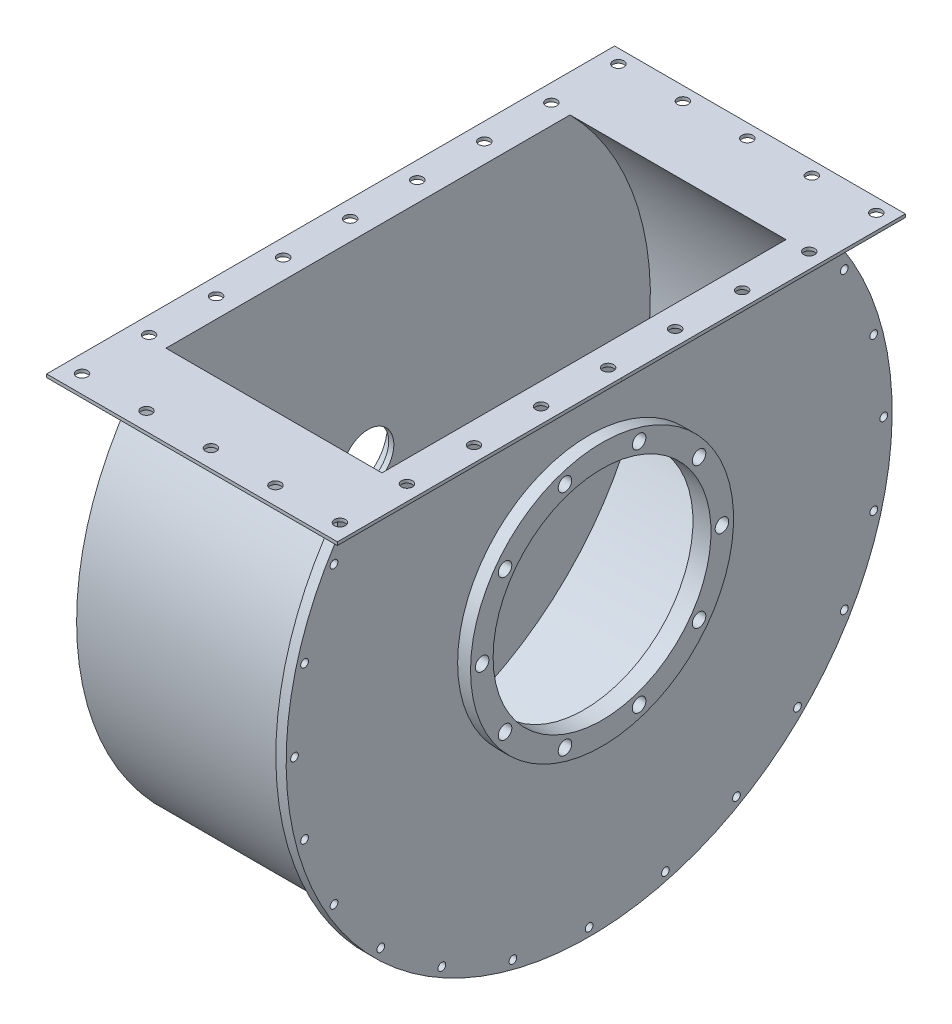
ISO-10303-21;
HEADER;
FILE_DESCRIPTION(('STEP AP214'),'2;1');
FILE_NAME('part.step','',(''),(''),'','','');
FILE_SCHEMA(('AUTOMOTIVE_DESIGN { 1 0 10303 214 1 1 1 1 }'));
ENDSEC;
DATA;
#1=APPLICATION_CONTEXT('core data for automotive mechanical design processes');
#2=APPLICATION_PROTOCOL_DEFINITION('international standard','automotive_design',2000,#1);
#3=PRODUCT_CONTEXT('',#1,'mechanical');
#4=PRODUCT('Part','Part','',(#3));
#5=PRODUCT_RELATED_PRODUCT_CATEGORY('part','',(#4));
#6=PRODUCT_DEFINITION_FORMATION('','',#4);
#7=PRODUCT_DEFINITION_CONTEXT('part definition',#1,'design');
#8=PRODUCT_DEFINITION('design','',#6,#7);
#9=PRODUCT_DEFINITION_SHAPE('','',#8);
#10=(LENGTH_UNIT() NAMED_UNIT(*) SI_UNIT(.MILLI.,.METRE.));
#11=(NAMED_UNIT(*) PLANE_ANGLE_UNIT() SI_UNIT($,.RADIAN.));
#12=(NAMED_UNIT(*) SI_UNIT($,.STERADIAN.) SOLID_ANGLE_UNIT());
#13=UNCERTAINTY_MEASURE_WITH_UNIT(LENGTH_MEASURE(1.E-05),#10,'distance_accuracy_value','');
#14=(GEOMETRIC_REPRESENTATION_CONTEXT(3) GLOBAL_UNCERTAINTY_ASSIGNED_CONTEXT((#13)) GLOBAL_UNIT_ASSIGNED_CONTEXT((#10,
#11,#12)) REPRESENTATION_CONTEXT('',''));
#15=CARTESIAN_POINT('',(0.,0.,0.));
#16=DIRECTION('',(0.,0.,1.));
#17=DIRECTION('',(1.,0.,0.));
#18=AXIS2_PLACEMENT_3D('',#15,#16,#17);
#19=CARTESIAN_POINT('',(-234.6,256.,395.5));
#20=DIRECTION('',(0.,1.,0.));
#21=DIRECTION('',(0.,0.,1.));
#22=AXIS2_PLACEMENT_3D('',#19,#20,#21);
#23=PLANE('',#22);
#24=DIRECTION('',(0.,0.,1.));
#25=VECTOR('',#24,1.);
#26=CARTESIAN_POINT('',(155.5,256.,395.5));
#27=LINE('',#26,#25);
#28=CARTESIAN_POINT('',(155.5,256.,390.5));
#29=VERTEX_POINT('',#28);
#30=CARTESIAN_POINT('',(155.5,256.,394.162403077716));
#31=VERTEX_POINT('',#30);
#32=EDGE_CURVE('E982',#29,#31,#27,.T.);
#33=ORIENTED_EDGE('',*,*,#32,.T.);
#34=DIRECTION('',(-1.,0.,0.));
#35=VECTOR('',#34,1.);
#36=CARTESIAN_POINT('',(-163.5,256.,394.162403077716));
#37=LINE('',#36,#35);
#38=CARTESIAN_POINT('',(171.5,256.,394.162403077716));
#39=VERTEX_POINT('',#38);
#40=EDGE_CURVE('E51',#39,#31,#37,.T.);
#41=ORIENTED_EDGE('',*,*,#40,.F.);
#42=DIRECTION('',(0.,0.,1.));
#43=VECTOR('',#42,1.);
#44=CARTESIAN_POINT('',(171.5,256.,0.));
#45=LINE('',#44,#43);
#46=CARTESIAN_POINT('',(171.5,256.,390.5));
#47=VERTEX_POINT('',#46);
#48=EDGE_CURVE('E493',#47,#39,#45,.T.);
#49=ORIENTED_EDGE('',*,*,#48,.F.);
#50=DIRECTION('',(-0.707106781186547,0.,-0.707106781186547));
#51=VECTOR('',#50,1.);
#52=CARTESIAN_POINT('',(201.55,256.,420.55));
#53=LINE('',#52,#51);
#54=CARTESIAN_POINT('',(176.5,256.,395.5));
#55=VERTEX_POINT('',#54);
#56=EDGE_CURVE('E517',#55,#47,#53,.T.);
#57=ORIENTED_EDGE('',*,*,#56,.F.);
#58=DIRECTION('',(1.,0.,0.));
#59=VECTOR('',#58,1.);
#60=CARTESIAN_POINT('',(-234.6,256.,395.5));
#61=LINE('',#60,#59);
#62=CARTESIAN_POINT('',(-184.5,256.,395.5));
#63=VERTEX_POINT('',#62);
#64=EDGE_CURVE('E556',#63,#55,#61,.T.);
#65=ORIENTED_EDGE('',*,*,#64,.F.);
#66=DIRECTION('',(0.707106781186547,0.,-0.707106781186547));
#67=VECTOR('',#66,1.);
#68=CARTESIAN_POINT('',(236.05,256.,-25.05));
#69=LINE('',#68,#67);
#70=CARTESIAN_POINT('',(-179.5,256.,390.5));
#71=VERTEX_POINT('',#70);
#72=EDGE_CURVE('E640',#63,#71,#69,.T.);
#73=ORIENTED_EDGE('',*,*,#72,.T.);
#74=DIRECTION('',(1.,0.,0.));
#75=VECTOR('',#74,1.);
#76=CARTESIAN_POINT('',(-234.6,256.,390.5));
#77=LINE('',#76,#75);
#78=EDGE_CURVE('E559',#71,#29,#77,.T.);
#79=ORIENTED_EDGE('',*,*,#78,.T.);
#80=EDGE_LOOP('',(#33,#41,#49,#57,#65,#73,#79));
#81=FACE_BOUND('',#80,.T.);
#82=ADVANCED_FACE('F35',(#81),#23,.F.);
#83=CARTESIAN_POINT('',(-234.6,256.,390.5));
#84=DIRECTION('',(0.,0.,1.));
#85=DIRECTION('',(1.,0.,0.));
#86=AXIS2_PLACEMENT_3D('',#83,#84,#85);
#87=PLANE('',#86);
#88=DIRECTION('',(-1.,0.,0.));
#89=VECTOR('',#88,1.);
#90=CARTESIAN_POINT('',(-163.5,261.552575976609,390.5));
#91=LINE('',#90,#89);
#92=CARTESIAN_POINT('',(155.5,261.552575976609,390.5));
#93=VERTEX_POINT('',#92);
#94=CARTESIAN_POINT('',(171.5,261.552575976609,390.5));
#95=VERTEX_POINT('',#94);
#96=EDGE_CURVE('E59',#93,#95,#91,.F.);
#97=ORIENTED_EDGE('',*,*,#96,.F.);
#98=DIRECTION('',(0.,-1.,0.));
#99=VECTOR('',#98,1.);
#100=CARTESIAN_POINT('',(155.5,256.,390.5));
#101=LINE('',#100,#99);
#102=EDGE_CURVE('E984',#93,#29,#101,.T.);
#103=ORIENTED_EDGE('',*,*,#102,.T.);
#104=ORIENTED_EDGE('',*,*,#78,.F.);
#105=DIRECTION('',(0.,1.,0.));
#106=VECTOR('',#105,1.);
#107=CARTESIAN_POINT('',(-179.5,256.,390.5));
#108=LINE('',#107,#106);
#109=CARTESIAN_POINT('',(-179.5,301.,390.5));
#110=VERTEX_POINT('',#109);
#111=EDGE_CURVE('E631',#71,#110,#108,.T.);
#112=ORIENTED_EDGE('',*,*,#111,.T.);
#113=DIRECTION('',(1.,0.,0.));
#114=VECTOR('',#113,1.);
#115=CARTESIAN_POINT('',(-179.5,301.,390.5));
#116=LINE('',#115,#114);
#117=CARTESIAN_POINT('',(171.5,301.,390.5));
#118=VERTEX_POINT('',#117);
#119=EDGE_CURVE('E298',#110,#118,#116,.T.);
#120=ORIENTED_EDGE('',*,*,#119,.T.);
#121=DIRECTION('',(0.,1.,0.));
#122=VECTOR('',#121,1.);
#123=CARTESIAN_POINT('',(171.5,256.,390.5));
#124=LINE('',#123,#122);
#125=EDGE_CURVE('E519',#95,#118,#124,.T.);
#126=ORIENTED_EDGE('',*,*,#125,.F.);
#127=EDGE_LOOP('',(#97,#103,#104,#112,#120,#126));
#128=FACE_BOUND('',#127,.T.);
#129=ADVANCED_FACE('F637',(#128),#87,.F.);
#130=CARTESIAN_POINT('',(226.6,256.,-395.5));
#131=DIRECTION('',(0.,1.,0.));
#132=DIRECTION('',(0.,0.,1.));
#133=AXIS2_PLACEMENT_3D('',#130,#131,#132);
#134=PLANE('',#133);
#135=DIRECTION('',(-1.,0.,0.));
#136=VECTOR('',#135,1.);
#137=CARTESIAN_POINT('',(-163.5,256.,-394.162403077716));
#138=LINE('',#137,#136);
#139=CARTESIAN_POINT('',(155.5,256.,-394.162403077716));
#140=VERTEX_POINT('',#139);
#141=CARTESIAN_POINT('',(171.5,256.,-394.162403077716));
#142=VERTEX_POINT('',#141);
#143=EDGE_CURVE('E580',#140,#142,#138,.F.);
#144=ORIENTED_EDGE('',*,*,#143,.F.);
#145=DIRECTION('',(0.,0.,1.));
#146=VECTOR('',#145,1.);
#147=CARTESIAN_POINT('',(155.5,256.,-395.5));
#148=LINE('',#147,#146);
#149=CARTESIAN_POINT('',(155.5,256.,-390.5));
#150=VERTEX_POINT('',#149);
#151=EDGE_CURVE('E986',#140,#150,#148,.T.);
#152=ORIENTED_EDGE('',*,*,#151,.T.);
#153=DIRECTION('',(-1.,0.,0.));
#154=VECTOR('',#153,1.);
#155=CARTESIAN_POINT('',(226.6,256.,-390.5));
#156=LINE('',#155,#154);
#157=CARTESIAN_POINT('',(-179.5,256.,-390.5));
#158=VERTEX_POINT('',#157);
#159=EDGE_CURVE('E876',#150,#158,#156,.T.);
#160=ORIENTED_EDGE('',*,*,#159,.T.);
#161=DIRECTION('',(0.707106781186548,0.,0.707106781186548));
#162=VECTOR('',#161,1.);
#163=CARTESIAN_POINT('',(21.05,256.,-189.95));
#164=LINE('',#163,#162);
#165=CARTESIAN_POINT('',(-184.5,256.,-395.5));
#166=VERTEX_POINT('',#165);
#167=EDGE_CURVE('E850',#166,#158,#164,.T.);
#168=ORIENTED_EDGE('',*,*,#167,.F.);
#169=DIRECTION('',(-1.,0.,0.));
#170=VECTOR('',#169,1.);
#171=CARTESIAN_POINT('',(226.6,256.,-395.5));
#172=LINE('',#171,#170);
#173=CARTESIAN_POINT('',(176.5,256.,-395.5));
#174=VERTEX_POINT('',#173);
#175=EDGE_CURVE('E845',#174,#166,#172,.T.);
#176=ORIENTED_EDGE('',*,*,#175,.F.);
#177=DIRECTION('',(-0.707106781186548,0.,0.707106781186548));
#178=VECTOR('',#177,1.);
#179=CARTESIAN_POINT('',(201.55,256.,-420.55));
#180=LINE('',#179,#178);
#181=CARTESIAN_POINT('',(171.5,256.,-390.5));
#182=VERTEX_POINT('',#181);
#183=EDGE_CURVE('E862',#174,#182,#180,.T.);
#184=ORIENTED_EDGE('',*,*,#183,.T.);
#185=DIRECTION('',(0.,0.,1.));
#186=VECTOR('',#185,1.);
#187=CARTESIAN_POINT('',(171.5,256.,0.));
#188=LINE('',#187,#186);
#189=EDGE_CURVE('E621',#142,#182,#188,.T.);
#190=ORIENTED_EDGE('',*,*,#189,.F.);
#191=EDGE_LOOP('',(#144,#152,#160,#168,#176,#184,#190));
#192=FACE_BOUND('',#191,.T.);
#193=ADVANCED_FACE('F914',(#192),#134,.F.);
#194=CARTESIAN_POINT('',(226.6,256.,-390.5));
#195=DIRECTION('',(0.,0.,-1.));
#196=DIRECTION('',(-1.,0.,0.));
#197=AXIS2_PLACEMENT_3D('',#194,#195,#196);
#198=PLANE('',#197);
#199=DIRECTION('',(0.,1.,0.));
#200=VECTOR('',#199,1.);
#201=CARTESIAN_POINT('',(155.5,256.,-390.5));
#202=LINE('',#201,#200);
#203=CARTESIAN_POINT('',(155.5,261.552575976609,-390.5));
#204=VERTEX_POINT('',#203);
#205=EDGE_CURVE('E310',#150,#204,#202,.T.);
#206=ORIENTED_EDGE('',*,*,#205,.T.);
#207=DIRECTION('',(-1.,0.,0.));
#208=VECTOR('',#207,1.);
#209=CARTESIAN_POINT('',(-163.5,261.552575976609,-390.5));
#210=LINE('',#209,#208);
#211=CARTESIAN_POINT('',(171.5,261.552575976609,-390.5));
#212=VERTEX_POINT('',#211);
#213=EDGE_CURVE('E314',#212,#204,#210,.T.);
#214=ORIENTED_EDGE('',*,*,#213,.F.);
#215=DIRECTION('',(0.,1.,0.));
#216=VECTOR('',#215,1.);
#217=CARTESIAN_POINT('',(171.5,256.,-390.5));
#218=LINE('',#217,#216);
#219=CARTESIAN_POINT('',(171.5,301.,-390.5));
#220=VERTEX_POINT('',#219);
#221=EDGE_CURVE('E869',#212,#220,#218,.T.);
#222=ORIENTED_EDGE('',*,*,#221,.T.);
#223=DIRECTION('',(1.,0.,0.));
#224=VECTOR('',#223,1.);
#225=CARTESIAN_POINT('',(-179.5,301.,-390.5));
#226=LINE('',#225,#224);
#227=CARTESIAN_POINT('',(-179.5,301.,-390.5));
#228=VERTEX_POINT('',#227);
#229=EDGE_CURVE('E832',#228,#220,#226,.T.);
#230=ORIENTED_EDGE('',*,*,#229,.F.);
#231=DIRECTION('',(0.,1.,0.));
#232=VECTOR('',#231,1.);
#233=CARTESIAN_POINT('',(-179.5,256.,-390.5));
#234=LINE('',#233,#232);
#235=EDGE_CURVE('E853',#158,#228,#234,.T.);
#236=ORIENTED_EDGE('',*,*,#235,.F.);
#237=ORIENTED_EDGE('',*,*,#159,.F.);
#238=EDGE_LOOP('',(#206,#214,#222,#230,#236,#237));
#239=FACE_BOUND('',#238,.T.);
#240=ADVANCED_FACE('F1879',(#239),#198,.F.);
#241=CARTESIAN_POINT('',(0.,301.,0.));
#242=DIRECTION('',(0.,-1.,0.));
#243=DIRECTION('',(0.,0.,-1.));
#244=AXIS2_PLACEMENT_3D('',#241,#242,#243);
#245=PLANE('',#244);
#246=DIRECTION('',(0.,0.,-1.));
#247=VECTOR('',#246,1.);
#248=CARTESIAN_POINT('',(155.5,301.,326.39699753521));
#249=LINE('',#248,#247);
#250=CARTESIAN_POINT('',(155.5,301.,360.969527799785));
#251=VERTEX_POINT('',#250);
#252=CARTESIAN_POINT('',(155.5,301.,326.39699753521));
#253=VERTEX_POINT('',#252);
#254=EDGE_CURVE('E316',#251,#253,#249,.T.);
#255=ORIENTED_EDGE('',*,*,#254,.F.);
#256=DIRECTION('',(-1.,0.,0.));
#257=VECTOR('',#256,1.);
#258=CARTESIAN_POINT('',(-163.5,301.,360.969527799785));
#259=LINE('',#258,#257);
#260=CARTESIAN_POINT('',(171.5,301.,360.969527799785));
#261=VERTEX_POINT('',#260);
#262=EDGE_CURVE('E560',#251,#261,#259,.F.);
#263=ORIENTED_EDGE('',*,*,#262,.T.);
#264=DIRECTION('',(0.,0.,-1.));
#265=VECTOR('',#264,1.);
#266=CARTESIAN_POINT('',(171.5,301.,390.5));
#267=LINE('',#266,#265);
#268=EDGE_CURVE('E836',#118,#261,#267,.T.);
#269=ORIENTED_EDGE('',*,*,#268,.F.);
#270=ORIENTED_EDGE('',*,*,#119,.F.);
#271=DIRECTION('',(0.,0.,1.));
#272=VECTOR('',#271,1.);
#273=CARTESIAN_POINT('',(-179.5,301.,-445.6));
#274=LINE('',#273,#272);
#275=CARTESIAN_POINT('',(-179.5,301.,326.39699753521));
#276=VERTEX_POINT('',#275);
#277=EDGE_CURVE('E44',#276,#110,#274,.T.);
#278=ORIENTED_EDGE('',*,*,#277,.F.);
#279=DIRECTION('',(-1.,0.,0.));
#280=VECTOR('',#279,1.);
#281=CARTESIAN_POINT('',(-163.5,301.,326.39699753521));
#282=LINE('',#281,#280);
#283=EDGE_CURVE('E839',#276,#253,#282,.F.);
#284=ORIENTED_EDGE('',*,*,#283,.T.);
#285=EDGE_LOOP('',(#255,#263,#269,#270,#278,#284));
#286=FACE_BOUND('',#285,.T.);
#287=ADVANCED_FACE('F959',(#286),#245,.T.);
#288=CARTESIAN_POINT('',(0.,301.,0.));
#289=DIRECTION('',(0.,-1.,0.));
#290=DIRECTION('',(0.,0.,1.));
#291=AXIS2_PLACEMENT_3D('',#288,#289,#290);
#292=PLANE('',#291);
#293=DIRECTION('',(-1.,0.,0.));
#294=VECTOR('',#293,1.);
#295=CARTESIAN_POINT('',(-163.5,301.,-360.969527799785));
#296=LINE('',#295,#294);
#297=CARTESIAN_POINT('',(171.5,301.,-360.969527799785));
#298=VERTEX_POINT('',#297);
#299=CARTESIAN_POINT('',(155.5,301.,-360.969527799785));
#300=VERTEX_POINT('',#299);
#301=EDGE_CURVE('E288',#298,#300,#296,.T.);
#302=ORIENTED_EDGE('',*,*,#301,.T.);
#303=DIRECTION('',(0.,0.,-1.));
#304=VECTOR('',#303,1.);
#305=CARTESIAN_POINT('',(155.5,301.,-360.969527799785));
#306=LINE('',#305,#304);
#307=CARTESIAN_POINT('',(155.5,301.,-326.39699753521));
#308=VERTEX_POINT('',#307);
#309=EDGE_CURVE('E291',#308,#300,#306,.T.);
#310=ORIENTED_EDGE('',*,*,#309,.F.);
#311=DIRECTION('',(-1.,0.,0.));
#312=VECTOR('',#311,1.);
#313=CARTESIAN_POINT('',(-163.5,301.,-326.39699753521));
#314=LINE('',#313,#312);
#315=CARTESIAN_POINT('',(-179.5,301.,-326.39699753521));
#316=VERTEX_POINT('',#315);
#317=EDGE_CURVE('E299',#308,#316,#314,.T.);
#318=ORIENTED_EDGE('',*,*,#317,.T.);
#319=DIRECTION('',(0.,0.,-1.));
#320=VECTOR('',#319,1.);
#321=CARTESIAN_POINT('',(-179.5,301.,-390.5));
#322=LINE('',#321,#320);
#323=EDGE_CURVE('E826',#316,#228,#322,.T.);
#324=ORIENTED_EDGE('',*,*,#323,.T.);
#325=ORIENTED_EDGE('',*,*,#229,.T.);
#326=DIRECTION('',(0.,0.,1.));
#327=VECTOR('',#326,1.);
#328=CARTESIAN_POINT('',(171.5,301.,-390.5));
#329=LINE('',#328,#327);
#330=EDGE_CURVE('E294',#220,#298,#329,.T.);
#331=ORIENTED_EDGE('',*,*,#330,.T.);
#332=EDGE_LOOP('',(#302,#310,#318,#324,#325,#331));
#333=FACE_BOUND('',#332,.T.);
#334=ADVANCED_FACE('F290',(#333),#292,.T.);
#335=CARTESIAN_POINT('',(-179.5,-444.,0.));
#336=DIRECTION('',(-1.,0.,0.));
#337=DIRECTION('',(0.,0.,1.));
#338=AXIS2_PLACEMENT_3D('',#335,#336,#337);
#339=PLANE('',#338);
#340=CARTESIAN_POINT('',(-179.5,0.,0.));
#341=DIRECTION('',(-1.,0.,0.));
#342=DIRECTION('',(0.,0.,1.));
#343=AXIS2_PLACEMENT_3D('',#340,#341,#342);
#344=CIRCLE('',#343,40.);
#345=CARTESIAN_POINT('',(-179.5,0.,40.));
#346=VERTEX_POINT('',#345);
#347=EDGE_CURVE('E615',#346,#346,#344,.T.);
#348=ORIENTED_EDGE('',*,*,#347,.F.);
#349=EDGE_LOOP('',(#348));
#350=FACE_BOUND('',#349,.T.);
#351=CARTESIAN_POINT('',(-179.5,0.,0.));
#352=DIRECTION('',(-1.,0.,0.));
#353=DIRECTION('',(0.,0.,1.));
#354=AXIS2_PLACEMENT_3D('',#351,#352,#353);
#355=CIRCLE('',#354,60.);
#356=CARTESIAN_POINT('',(-179.5,0.,60.));
#357=VERTEX_POINT('',#356);
#358=EDGE_CURVE('E11',#357,#357,#355,.F.);
#359=ORIENTED_EDGE('',*,*,#358,.F.);
#360=EDGE_LOOP('',(#359));
#361=FACE_BOUND('',#360,.T.);
#362=ADVANCED_FACE('F951',(#350,#361),#339,.T.);
#363=CARTESIAN_POINT('',(-163.5,0.,0.));
#364=DIRECTION('',(-1.,0.,0.));
#365=DIRECTION('',(0.,0.,1.));
#366=AXIS2_PLACEMENT_3D('',#363,#364,#365);
#367=CYLINDRICAL_SURFACE('',#366,470.);
#368=CARTESIAN_POINT('',(171.5,0.,0.));
#369=DIRECTION('',(-1.,0.,0.));
#370=DIRECTION('',(0.,0.,1.));
#371=AXIS2_PLACEMENT_3D('',#368,#369,#370);
#372=CIRCLE('',#371,470.);
#373=EDGE_CURVE('E593',#142,#39,#372,.T.);
#374=ORIENTED_EDGE('',*,*,#373,.T.);
#375=ORIENTED_EDGE('',*,*,#40,.T.);
#376=CARTESIAN_POINT('',(155.5,0.,0.));
#377=DIRECTION('',(-1.,0.,0.));
#378=DIRECTION('',(0.,0.,1.));
#379=AXIS2_PLACEMENT_3D('',#376,#377,#378);
#380=CIRCLE('',#379,470.);
#381=EDGE_CURVE('E317',#140,#31,#380,.T.);
#382=ORIENTED_EDGE('',*,*,#381,.F.);
#383=ORIENTED_EDGE('',*,*,#143,.T.);
#384=EDGE_LOOP('',(#374,#375,#382,#383));
#385=FACE_BOUND('',#384,.T.);
#386=ADVANCED_FACE('F37',(#385),#367,.T.);
#387=ORIENTED_EDGE('',*,*,#262,.F.);
#388=EDGE_CURVE('E319',#93,#251,#380,.T.);
#389=ORIENTED_EDGE('',*,*,#388,.F.);
#390=ORIENTED_EDGE('',*,*,#96,.T.);
#391=CARTESIAN_POINT('',(171.5,0.,0.));
#392=DIRECTION('',(1.,0.,0.));
#393=DIRECTION('',(0.,0.,-1.));
#394=AXIS2_PLACEMENT_3D('',#391,#392,#393);
#395=CIRCLE('',#394,470.);
#396=EDGE_CURVE('E575',#95,#261,#395,.F.);
#397=ORIENTED_EDGE('',*,*,#396,.T.);
#398=EDGE_LOOP('',(#387,#389,#390,#397));
#399=FACE_BOUND('',#398,.T.);
#400=ADVANCED_FACE('F963',(#399),#367,.T.);
#401=ORIENTED_EDGE('',*,*,#301,.F.);
#402=EDGE_CURVE('E594',#298,#212,#372,.T.);
#403=ORIENTED_EDGE('',*,*,#402,.T.);
#404=ORIENTED_EDGE('',*,*,#213,.T.);
#405=EDGE_CURVE('E307',#300,#204,#380,.T.);
#406=ORIENTED_EDGE('',*,*,#405,.F.);
#407=EDGE_LOOP('',(#401,#403,#404,#406));
#408=FACE_BOUND('',#407,.T.);
#409=ADVANCED_FACE('F312',(#408),#367,.T.);
#410=CARTESIAN_POINT('',(-179.5,0.,0.));
#411=DIRECTION('',(-1.,0.,0.));
#412=DIRECTION('',(0.,0.,1.));
#413=AXIS2_PLACEMENT_3D('',#410,#411,#412);
#414=CIRCLE('',#413,90.);
#415=CARTESIAN_POINT('',(-179.5,0.,90.));
#416=VERTEX_POINT('',#415);
#417=EDGE_CURVE('E1030',#416,#416,#414,.T.);
#418=ORIENTED_EDGE('',*,*,#417,.F.);
#419=EDGE_LOOP('',(#418));
#420=FACE_BOUND('',#419,.T.);
#421=CARTESIAN_POINT('',(-179.5,0.,0.));
#422=DIRECTION('',(-1.,0.,0.));
#423=DIRECTION('',(0.,0.,1.));
#424=AXIS2_PLACEMENT_3D('',#421,#422,#423);
#425=CIRCLE('',#424,444.);
#426=CARTESIAN_POINT('',(-179.5,256.,-362.767142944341));
#427=VERTEX_POINT('',#426);
#428=CARTESIAN_POINT('',(-179.5,256.,362.767142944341));
#429=VERTEX_POINT('',#428);
#430=EDGE_CURVE('E618',#427,#429,#425,.T.);
#431=ORIENTED_EDGE('',*,*,#430,.T.);
#432=DIRECTION('',(0.,0.,1.));
#433=VECTOR('',#432,1.);
#434=CARTESIAN_POINT('',(-179.5,256.,-445.6));
#435=LINE('',#434,#433);
#436=EDGE_CURVE('E658',#427,#429,#435,.T.);
#437=ORIENTED_EDGE('',*,*,#436,.F.);
#438=EDGE_LOOP('',(#431,#437));
#439=FACE_BOUND('',#438,.T.);
#440=ADVANCED_FACE('F480',(#420,#439),#339,.T.);
#441=CARTESIAN_POINT('',(171.5,-204.,0.));
#442=DIRECTION('',(1.,0.,0.));
#443=DIRECTION('',(0.,0.,-1.));
#444=AXIS2_PLACEMENT_3D('',#441,#442,#443);
#445=PLANE('',#444);
#446=CARTESIAN_POINT('',(171.5,-395.773609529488,228.5));
#447=DIRECTION('',(1.,0.,0.));
#448=DIRECTION('',(0.,-0.500000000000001,-0.866025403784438));
#449=AXIS2_PLACEMENT_3D('',#446,#447,#448);
#450=CIRCLE('',#449,6.);
#451=CARTESIAN_POINT('',(171.5,-398.773609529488,223.303847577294));
#452=VERTEX_POINT('',#451);
#453=EDGE_CURVE('E339',#452,#452,#450,.T.);
#454=ORIENTED_EDGE('',*,*,#453,.F.);
#455=EDGE_LOOP('',(#454));
#456=FACE_BOUND('',#455,.T.);
#457=CARTESIAN_POINT('',(171.5,-323.147799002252,323.147799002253));
#458=DIRECTION('',(1.,0.,0.));
#459=DIRECTION('',(0.,-0.707106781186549,-0.707106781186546));
#460=AXIS2_PLACEMENT_3D('',#457,#458,#459);
#461=CIRCLE('',#460,6.);
#462=CARTESIAN_POINT('',(171.5,-327.390439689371,318.905158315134));
#463=VERTEX_POINT('',#462);
#464=EDGE_CURVE('E419',#463,#463,#461,.T.);
#465=ORIENTED_EDGE('',*,*,#464,.F.);
#466=EDGE_LOOP('',(#465));
#467=FACE_BOUND('',#466,.T.);
#468=CARTESIAN_POINT('',(171.5,-228.499999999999,395.773609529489));
#469=DIRECTION('',(1.,0.,0.));
#470=DIRECTION('',(0.,-0.86602540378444,-0.499999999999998));
#471=AXIS2_PLACEMENT_3D('',#468,#469,#470);
#472=CIRCLE('',#471,6.);
#473=CARTESIAN_POINT('',(171.5,-233.696152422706,392.773609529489));
#474=VERTEX_POINT('',#473);
#475=EDGE_CURVE('E413',#474,#474,#472,.T.);
#476=ORIENTED_EDGE('',*,*,#475,.F.);
#477=EDGE_LOOP('',(#476));
#478=FACE_BOUND('',#477,.T.);
#479=CARTESIAN_POINT('',(171.5,-118.280303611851,441.428102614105));
#480=DIRECTION('',(1.,0.,0.));
#481=DIRECTION('',(0.,-0.965925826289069,-0.258819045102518));
#482=AXIS2_PLACEMENT_3D('',#479,#480,#481);
#483=CIRCLE('',#482,6.);
#484=CARTESIAN_POINT('',(171.5,-124.075858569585,439.875188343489));
#485=VERTEX_POINT('',#484);
#486=EDGE_CURVE('E407',#485,#485,#483,.T.);
#487=ORIENTED_EDGE('',*,*,#486,.F.);
#488=EDGE_LOOP('',(#487));
#489=FACE_BOUND('',#488,.T.);
#490=CARTESIAN_POINT('',(171.5,1.53964061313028E-12,457.));
#491=DIRECTION('',(1.,0.,0.));
#492=DIRECTION('',(0.,-1.,0.));
#493=AXIS2_PLACEMENT_3D('',#490,#491,#492);
#494=CIRCLE('',#493,6.);
#495=CARTESIAN_POINT('',(171.5,-5.99999999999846,457.));
#496=VERTEX_POINT('',#495);
#497=EDGE_CURVE('E401',#496,#496,#494,.T.);
#498=ORIENTED_EDGE('',*,*,#497,.F.);
#499=EDGE_LOOP('',(#498));
#500=FACE_BOUND('',#499,.T.);
#501=CARTESIAN_POINT('',(171.5,118.280303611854,441.428102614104));
#502=DIRECTION('',(1.,0.,0.));
#503=DIRECTION('',(0.,-0.965925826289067,0.258819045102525));
#504=AXIS2_PLACEMENT_3D('',#501,#502,#503);
#505=CIRCLE('',#504,6.);
#506=CARTESIAN_POINT('',(171.5,112.484748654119,442.981016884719));
#507=VERTEX_POINT('',#506);
#508=EDGE_CURVE('E395',#507,#507,#505,.T.);
#509=ORIENTED_EDGE('',*,*,#508,.F.);
#510=EDGE_LOOP('',(#509));
#511=FACE_BOUND('',#510,.T.);
#512=CARTESIAN_POINT('',(171.5,228.500000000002,395.773609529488));
#513=DIRECTION('',(1.,0.,0.));
#514=DIRECTION('',(0.,-0.866025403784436,0.500000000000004));
#515=AXIS2_PLACEMENT_3D('',#512,#513,#514);
#516=CIRCLE('',#515,6.);
#517=CARTESIAN_POINT('',(171.5,223.303847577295,398.773609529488));
#518=VERTEX_POINT('',#517);
#519=EDGE_CURVE('E389',#518,#518,#516,.T.);
#520=ORIENTED_EDGE('',*,*,#519,.F.);
#521=EDGE_LOOP('',(#520));
#522=FACE_BOUND('',#521,.T.);
#523=CARTESIAN_POINT('',(171.5,228.499999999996,-395.773609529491));
#524=DIRECTION('',(1.,0.,0.));
#525=DIRECTION('',(0.,0.866025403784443,0.499999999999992));
#526=AXIS2_PLACEMENT_3D('',#523,#524,#525);
#527=CIRCLE('',#526,6.);
#528=CARTESIAN_POINT('',(171.5,233.696152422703,-392.773609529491));
#529=VERTEX_POINT('',#528);
#530=EDGE_CURVE('E383',#529,#529,#527,.T.);
#531=ORIENTED_EDGE('',*,*,#530,.F.);
#532=EDGE_LOOP('',(#531));
#533=FACE_BOUND('',#532,.T.);
#534=CARTESIAN_POINT('',(171.5,118.280303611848,-441.428102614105));
#535=DIRECTION('',(1.,0.,0.));
#536=DIRECTION('',(0.,0.965925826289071,0.258819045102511));
#537=AXIS2_PLACEMENT_3D('',#534,#535,#536);
#538=CIRCLE('',#537,6.);
#539=CARTESIAN_POINT('',(171.5,124.075858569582,-439.87518834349));
#540=VERTEX_POINT('',#539);
#541=EDGE_CURVE('E377',#540,#540,#538,.T.);
#542=ORIENTED_EDGE('',*,*,#541,.F.);
#543=EDGE_LOOP('',(#542));
#544=FACE_BOUND('',#543,.T.);
#545=CARTESIAN_POINT('',(171.5,-4.7308545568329E-12,-457.));
#546=DIRECTION('',(1.,0.,0.));
#547=DIRECTION('',(0.,1.,0.));
#548=AXIS2_PLACEMENT_3D('',#545,#546,#547);
#549=CIRCLE('',#548,6.);
#550=CARTESIAN_POINT('',(171.5,5.99999999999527,-457.));
#551=VERTEX_POINT('',#550);
#552=EDGE_CURVE('E371',#551,#551,#549,.T.);
#553=ORIENTED_EDGE('',*,*,#552,.F.);
#554=EDGE_LOOP('',(#553));
#555=FACE_BOUND('',#554,.T.);
#556=CARTESIAN_POINT('',(171.5,-118.280303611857,-441.428102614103));
#557=DIRECTION('',(1.,0.,0.));
#558=DIRECTION('',(0.,0.965925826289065,-0.258819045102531));
#559=AXIS2_PLACEMENT_3D('',#556,#557,#558);
#560=CIRCLE('',#559,6.);
#561=CARTESIAN_POINT('',(171.5,-112.484748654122,-442.981016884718));
#562=VERTEX_POINT('',#561);
#563=EDGE_CURVE('E365',#562,#562,#560,.T.);
#564=ORIENTED_EDGE('',*,*,#563,.F.);
#565=EDGE_LOOP('',(#564));
#566=FACE_BOUND('',#565,.T.);
#567=CARTESIAN_POINT('',(171.5,-228.500000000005,-395.773609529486));
#568=DIRECTION('',(1.,0.,0.));
#569=DIRECTION('',(0.,0.866025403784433,-0.50000000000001));
#570=AXIS2_PLACEMENT_3D('',#567,#568,#569);
#571=CIRCLE('',#570,6.);
#572=CARTESIAN_POINT('',(171.5,-223.303847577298,-398.773609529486));
#573=VERTEX_POINT('',#572);
#574=EDGE_CURVE('E359',#573,#573,#571,.T.);
#575=ORIENTED_EDGE('',*,*,#574,.F.);
#576=EDGE_LOOP('',(#575));
#577=FACE_BOUND('',#576,.T.);
#578=CARTESIAN_POINT('',(171.5,-323.147799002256,-323.147799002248));
#579=DIRECTION('',(1.,0.,0.));
#580=DIRECTION('',(0.,0.707106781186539,-0.707106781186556));
#581=AXIS2_PLACEMENT_3D('',#578,#579,#580);
#582=CIRCLE('',#581,6.);
#583=CARTESIAN_POINT('',(171.5,-318.905158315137,-327.390439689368));
#584=VERTEX_POINT('',#583);
#585=EDGE_CURVE('E353',#584,#584,#582,.T.);
#586=ORIENTED_EDGE('',*,*,#585,.F.);
#587=EDGE_LOOP('',(#586));
#588=FACE_BOUND('',#587,.T.);
#589=CARTESIAN_POINT('',(171.5,-395.773609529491,-228.499999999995));
#590=DIRECTION('',(1.,0.,0.));
#591=DIRECTION('',(0.,0.499999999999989,-0.866025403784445));
#592=AXIS2_PLACEMENT_3D('',#589,#590,#591);
#593=CIRCLE('',#592,6.);
#594=CARTESIAN_POINT('',(171.5,-392.773609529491,-233.696152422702));
#595=VERTEX_POINT('',#594);
#596=EDGE_CURVE('E347',#595,#595,#593,.T.);
#597=ORIENTED_EDGE('',*,*,#596,.F.);
#598=EDGE_LOOP('',(#597));
#599=FACE_BOUND('',#598,.T.);
#600=CARTESIAN_POINT('',(171.5,-441.428102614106,-118.280303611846));
#601=DIRECTION('',(1.,0.,0.));
#602=DIRECTION('',(0.,0.258819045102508,-0.965925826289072));
#603=AXIS2_PLACEMENT_3D('',#600,#601,#602);
#604=CIRCLE('',#603,6.);
#605=CARTESIAN_POINT('',(171.5,-439.875188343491,-124.075858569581));
#606=VERTEX_POINT('',#605);
#607=EDGE_CURVE('E340',#606,#606,#604,.T.);
#608=ORIENTED_EDGE('',*,*,#607,.F.);
#609=EDGE_LOOP('',(#608));
#610=FACE_BOUND('',#609,.T.);
#611=CARTESIAN_POINT('',(171.5,-441.428102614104,118.280303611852));
#612=DIRECTION('',(1.,0.,0.));
#613=DIRECTION('',(0.,-0.258819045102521,-0.965925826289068));
#614=AXIS2_PLACEMENT_3D('',#611,#612,#613);
#615=CIRCLE('',#614,6.);
#616=CARTESIAN_POINT('',(171.5,-442.981016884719,112.484748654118));
#617=VERTEX_POINT('',#616);
#618=EDGE_CURVE('E330',#617,#617,#615,.T.);
#619=ORIENTED_EDGE('',*,*,#618,.F.);
#620=EDGE_LOOP('',(#619));
#621=FACE_BOUND('',#620,.T.);
#622=CARTESIAN_POINT('',(171.5,-457.,0.));
#623=DIRECTION('',(1.,0.,0.));
#624=DIRECTION('',(0.,0.,-1.));
#625=AXIS2_PLACEMENT_3D('',#622,#623,#624);
#626=CIRCLE('',#625,6.);
#627=CARTESIAN_POINT('',(171.5,-457.,-6.00000000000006));
#628=VERTEX_POINT('',#627);
#629=EDGE_CURVE('E326',#628,#628,#626,.T.);
#630=ORIENTED_EDGE('',*,*,#629,.F.);
#631=EDGE_LOOP('',(#630));
#632=FACE_BOUND('',#631,.T.);
#633=CARTESIAN_POINT('',(171.5,0.,0.));
#634=DIRECTION('',(-1.,0.,0.));
#635=DIRECTION('',(0.,0.,1.));
#636=AXIS2_PLACEMENT_3D('',#633,#634,#635);
#637=CIRCLE('',#636,204.);
#638=CARTESIAN_POINT('',(171.5,0.,204.));
#639=VERTEX_POINT('',#638);
#640=EDGE_CURVE('E487',#639,#639,#637,.T.);
#641=ORIENTED_EDGE('',*,*,#640,.T.);
#642=EDGE_LOOP('',(#641));
#643=FACE_BOUND('',#642,.T.);
#644=DIRECTION('',(0.,0.,-1.));
#645=VECTOR('',#644,1.);
#646=CARTESIAN_POINT('',(171.5,256.,445.6));
#647=LINE('',#646,#645);
#648=CARTESIAN_POINT('',(171.5,256.,0.));
#649=VERTEX_POINT('',#648);
#650=EDGE_CURVE('E491',#47,#649,#647,.T.);
#651=ORIENTED_EDGE('',*,*,#650,.F.);
#652=ORIENTED_EDGE('',*,*,#48,.T.);
#653=ORIENTED_EDGE('',*,*,#373,.F.);
#654=ORIENTED_EDGE('',*,*,#189,.T.);
#655=DIRECTION('',(0.,0.,-1.));
#656=VECTOR('',#655,1.);
#657=CARTESIAN_POINT('',(171.5,256.,0.));
#658=LINE('',#657,#656);
#659=EDGE_CURVE('E496',#649,#182,#658,.T.);
#660=ORIENTED_EDGE('',*,*,#659,.F.);
#661=EDGE_LOOP('',(#651,#652,#653,#654,#660));
#662=FACE_BOUND('',#661,.T.);
#663=ADVANCED_FACE('F476',(#456,#467,#478,#489,#500,#511,#522,#533,#544,#555,#566,#577,#588,
#599,#610,#621,#632,#643,#662),#445,.T.);
#664=CARTESIAN_POINT('',(-163.5,0.,0.));
#665=DIRECTION('',(-1.,0.,0.));
#666=DIRECTION('',(0.,0.,1.));
#667=AXIS2_PLACEMENT_3D('',#664,#665,#666);
#668=CYLINDRICAL_SURFACE('',#667,444.);
#669=CARTESIAN_POINT('',(155.5,0.,0.));
#670=DIRECTION('',(1.,0.,0.));
#671=DIRECTION('',(0.,0.,1.));
#672=AXIS2_PLACEMENT_3D('',#669,#670,#671);
#673=CIRCLE('',#672,444.);
#674=EDGE_CURVE('E309',#253,#308,#673,.T.);
#675=ORIENTED_EDGE('',*,*,#674,.F.);
#676=ORIENTED_EDGE('',*,*,#283,.F.);
#677=CARTESIAN_POINT('',(-179.5,0.,0.));
#678=DIRECTION('',(-1.,0.,0.));
#679=DIRECTION('',(0.,0.,1.));
#680=AXIS2_PLACEMENT_3D('',#677,#678,#679);
#681=CIRCLE('',#680,444.);
#682=EDGE_CURVE('E573',#276,#429,#681,.F.);
#683=ORIENTED_EDGE('',*,*,#682,.T.);
#684=ORIENTED_EDGE('',*,*,#430,.F.);
#685=EDGE_CURVE('E619',#316,#427,#425,.T.);
#686=ORIENTED_EDGE('',*,*,#685,.F.);
#687=ORIENTED_EDGE('',*,*,#317,.F.);
#688=EDGE_LOOP('',(#675,#676,#683,#684,#686,#687));
#689=FACE_BOUND('',#688,.T.);
#690=ADVANCED_FACE('F479',(#689),#668,.T.);
#691=CARTESIAN_POINT('',(-163.5,0.,0.));
#692=DIRECTION('',(-1.,0.,0.));
#693=DIRECTION('',(0.,0.,1.));
#694=AXIS2_PLACEMENT_3D('',#691,#692,#693);
#695=CYLINDRICAL_SURFACE('',#694,40.);
#696=ORIENTED_EDGE('',*,*,#347,.T.);
#697=EDGE_LOOP('',(#696));
#698=FACE_BOUND('',#697,.T.);
#699=CARTESIAN_POINT('',(-171.5,0.,0.));
#700=DIRECTION('',(-1.,0.,0.));
#701=DIRECTION('',(0.,0.,1.));
#702=AXIS2_PLACEMENT_3D('',#699,#700,#701);
#703=CIRCLE('',#702,40.);
#704=CARTESIAN_POINT('',(-171.5,0.,40.));
#705=VERTEX_POINT('',#704);
#706=EDGE_CURVE('E612',#705,#705,#703,.T.);
#707=ORIENTED_EDGE('',*,*,#706,.F.);
#708=EDGE_LOOP('',(#707));
#709=FACE_BOUND('',#708,.T.);
#710=ADVANCED_FACE('F944',(#698,#709),#695,.F.);
#711=CARTESIAN_POINT('',(-171.5,-438.,0.));
#712=DIRECTION('',(1.,0.,0.));
#713=DIRECTION('',(0.,0.,-1.));
#714=AXIS2_PLACEMENT_3D('',#711,#712,#713);
#715=PLANE('',#714);
#716=DIRECTION('',(0.,0.,-1.));
#717=VECTOR('',#716,1.);
#718=CARTESIAN_POINT('',(-171.5,306.,0.));
#719=LINE('',#718,#717);
#720=CARTESIAN_POINT('',(-171.5,306.,313.381556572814));
#721=VERTEX_POINT('',#720);
#722=CARTESIAN_POINT('',(-171.5,306.,-313.381556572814));
#723=VERTEX_POINT('',#722);
#724=EDGE_CURVE('E591',#721,#723,#719,.T.);
#725=ORIENTED_EDGE('',*,*,#724,.F.);
#726=CARTESIAN_POINT('',(-171.5,0.,0.));
#727=DIRECTION('',(-1.,0.,0.));
#728=DIRECTION('',(0.,0.,1.));
#729=AXIS2_PLACEMENT_3D('',#726,#727,#728);
#730=CIRCLE('',#729,438.);
#731=EDGE_CURVE('E609',#723,#721,#730,.T.);
#732=ORIENTED_EDGE('',*,*,#731,.F.);
#733=EDGE_LOOP('',(#725,#732));
#734=FACE_BOUND('',#733,.T.);
#735=ORIENTED_EDGE('',*,*,#706,.T.);
#736=EDGE_LOOP('',(#735));
#737=FACE_BOUND('',#736,.T.);
#738=ADVANCED_FACE('F940',(#734,#737),#715,.T.);
#739=CARTESIAN_POINT('',(-163.5,0.,0.));
#740=DIRECTION('',(-1.,0.,0.));
#741=DIRECTION('',(0.,0.,1.));
#742=AXIS2_PLACEMENT_3D('',#739,#740,#741);
#743=CYLINDRICAL_SURFACE('',#742,438.);
#744=DIRECTION('',(-1.,0.,0.));
#745=VECTOR('',#744,1.);
#746=CARTESIAN_POINT('',(-163.5,306.,313.381556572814));
#747=LINE('',#746,#745);
#748=CARTESIAN_POINT('',(163.5,306.,313.381556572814));
#749=VERTEX_POINT('',#748);
#750=EDGE_CURVE('E589',#749,#721,#747,.T.);
#751=ORIENTED_EDGE('',*,*,#750,.F.);
#752=CARTESIAN_POINT('',(163.5,0.,0.));
#753=DIRECTION('',(-1.,0.,0.));
#754=DIRECTION('',(0.,0.,1.));
#755=AXIS2_PLACEMENT_3D('',#752,#753,#754);
#756=CIRCLE('',#755,438.);
#757=CARTESIAN_POINT('',(163.5,306.,-313.381556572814));
#758=VERTEX_POINT('',#757);
#759=EDGE_CURVE('E606',#758,#749,#756,.T.);
#760=ORIENTED_EDGE('',*,*,#759,.F.);
#761=DIRECTION('',(-1.,0.,0.));
#762=VECTOR('',#761,1.);
#763=CARTESIAN_POINT('',(-163.5,306.,-313.381556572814));
#764=LINE('',#763,#762);
#765=EDGE_CURVE('E587',#723,#758,#764,.F.);
#766=ORIENTED_EDGE('',*,*,#765,.F.);
#767=ORIENTED_EDGE('',*,*,#731,.T.);
#768=EDGE_LOOP('',(#751,#760,#766,#767));
#769=FACE_BOUND('',#768,.T.);
#770=ADVANCED_FACE('F936',(#769),#743,.F.);
#771=CARTESIAN_POINT('',(163.5,-438.,0.));
#772=DIRECTION('',(-1.,0.,0.));
#773=DIRECTION('',(0.,0.,1.));
#774=AXIS2_PLACEMENT_3D('',#771,#772,#773);
#775=PLANE('',#774);
#776=DIRECTION('',(0.,0.,1.));
#777=VECTOR('',#776,1.);
#778=CARTESIAN_POINT('',(163.5,306.,0.));
#779=LINE('',#778,#777);
#780=EDGE_CURVE('E585',#758,#749,#779,.T.);
#781=ORIENTED_EDGE('',*,*,#780,.F.);
#782=ORIENTED_EDGE('',*,*,#759,.T.);
#783=EDGE_LOOP('',(#781,#782));
#784=FACE_BOUND('',#783,.T.);
#785=CARTESIAN_POINT('',(163.5,0.,0.));
#786=DIRECTION('',(-1.,0.,0.));
#787=DIRECTION('',(0.,0.,1.));
#788=AXIS2_PLACEMENT_3D('',#785,#786,#787);
#789=CIRCLE('',#788,169.);
#790=CARTESIAN_POINT('',(163.5,0.,169.));
#791=VERTEX_POINT('',#790);
#792=EDGE_CURVE('E603',#791,#791,#789,.T.);
#793=ORIENTED_EDGE('',*,*,#792,.F.);
#794=EDGE_LOOP('',(#793));
#795=FACE_BOUND('',#794,.T.);
#796=ADVANCED_FACE('F932',(#784,#795),#775,.T.);
#797=CARTESIAN_POINT('',(-163.5,0.,0.));
#798=DIRECTION('',(-1.,0.,0.));
#799=DIRECTION('',(0.,0.,1.));
#800=AXIS2_PLACEMENT_3D('',#797,#798,#799);
#801=CYLINDRICAL_SURFACE('',#800,169.);
#802=ORIENTED_EDGE('',*,*,#792,.T.);
#803=EDGE_LOOP('',(#802));
#804=FACE_BOUND('',#803,.T.);
#805=CARTESIAN_POINT('',(191.5,0.,0.));
#806=DIRECTION('',(-1.,0.,0.));
#807=DIRECTION('',(0.,0.,1.));
#808=AXIS2_PLACEMENT_3D('',#805,#806,#807);
#809=CIRCLE('',#808,169.);
#810=CARTESIAN_POINT('',(191.5,0.,169.));
#811=VERTEX_POINT('',#810);
#812=EDGE_CURVE('E600',#811,#811,#809,.T.);
#813=ORIENTED_EDGE('',*,*,#812,.F.);
#814=EDGE_LOOP('',(#813));
#815=FACE_BOUND('',#814,.T.);
#816=ADVANCED_FACE('F928',(#804,#815),#801,.F.);
#817=CARTESIAN_POINT('',(191.5,-204.,0.));
#818=DIRECTION('',(1.,0.,0.));
#819=DIRECTION('',(0.,0.,-1.));
#820=AXIS2_PLACEMENT_3D('',#817,#818,#819);
#821=PLANE('',#820);
#822=CARTESIAN_POINT('',(191.5,176.896512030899,57.4771609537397));
#823=DIRECTION('',(1.,0.,0.));
#824=DIRECTION('',(0.,-0.951056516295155,-0.309016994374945));
#825=AXIS2_PLACEMENT_3D('',#822,#823,#824);
#826=CIRCLE('',#825,10.5);
#827=CARTESIAN_POINT('',(191.5,166.9104186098,54.2324825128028));
#828=VERTEX_POINT('',#827);
#829=EDGE_CURVE('E1041',#828,#828,#826,.T.);
#830=ORIENTED_EDGE('',*,*,#829,.F.);
#831=EDGE_LOOP('',(#830));
#832=FACE_BOUND('',#831,.T.);
#833=CARTESIAN_POINT('',(191.5,176.896512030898,-57.477160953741));
#834=DIRECTION('',(1.,0.,0.));
#835=DIRECTION('',(0.,-0.951056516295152,0.309016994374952));
#836=AXIS2_PLACEMENT_3D('',#833,#834,#835);
#837=CIRCLE('',#836,10.5);
#838=CARTESIAN_POINT('',(191.5,166.910418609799,-54.232482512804));
#839=VERTEX_POINT('',#838);
#840=EDGE_CURVE('E1047',#839,#839,#837,.T.);
#841=ORIENTED_EDGE('',*,*,#840,.F.);
#842=EDGE_LOOP('',(#841));
#843=FACE_BOUND('',#842,.T.);
#844=CARTESIAN_POINT('',(191.5,109.328056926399,-150.477160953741));
#845=DIRECTION('',(1.,0.,0.));
#846=DIRECTION('',(0.,-0.587785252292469,0.809016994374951));
#847=AXIS2_PLACEMENT_3D('',#844,#845,#846);
#848=CIRCLE('',#847,10.5);
#849=CARTESIAN_POINT('',(191.5,103.156311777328,-141.982482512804));
#850=VERTEX_POINT('',#849);
#851=EDGE_CURVE('E1053',#850,#850,#848,.T.);
#852=ORIENTED_EDGE('',*,*,#851,.F.);
#853=EDGE_LOOP('',(#852));
#854=FACE_BOUND('',#853,.T.);
#855=CARTESIAN_POINT('',(191.5,0.,-186.));
#856=DIRECTION('',(1.,0.,0.));
#857=DIRECTION('',(0.,0.,1.));
#858=AXIS2_PLACEMENT_3D('',#855,#856,#857);
#859=CIRCLE('',#858,10.5);
#860=CARTESIAN_POINT('',(191.5,0.,-175.5));
#861=VERTEX_POINT('',#860);
#862=EDGE_CURVE('E1059',#861,#861,#859,.T.);
#863=ORIENTED_EDGE('',*,*,#862,.F.);
#864=EDGE_LOOP('',(#863));
#865=FACE_BOUND('',#864,.T.);
#866=CARTESIAN_POINT('',(191.5,-109.328056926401,-150.477160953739));
#867=DIRECTION('',(1.,0.,0.));
#868=DIRECTION('',(0.,0.58778525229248,0.809016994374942));
#869=AXIS2_PLACEMENT_3D('',#866,#867,#868);
#870=CIRCLE('',#869,10.5);
#871=CARTESIAN_POINT('',(191.5,-103.15631177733,-141.982482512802));
#872=VERTEX_POINT('',#871);
#873=EDGE_CURVE('E1065',#872,#872,#870,.T.);
#874=ORIENTED_EDGE('',*,*,#873,.F.);
#875=EDGE_LOOP('',(#874));
#876=FACE_BOUND('',#875,.T.);
#877=CARTESIAN_POINT('',(191.5,-176.896512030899,-57.4771609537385));
#878=DIRECTION('',(1.,0.,0.));
#879=DIRECTION('',(0.,0.951056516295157,0.309016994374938));
#880=AXIS2_PLACEMENT_3D('',#877,#878,#879);
#881=CIRCLE('',#880,10.5);
#882=CARTESIAN_POINT('',(191.5,-166.9104186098,-54.2324825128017));
#883=VERTEX_POINT('',#882);
#884=EDGE_CURVE('E1071',#883,#883,#881,.T.);
#885=ORIENTED_EDGE('',*,*,#884,.F.);
#886=EDGE_LOOP('',(#885));
#887=FACE_BOUND('',#886,.T.);
#888=CARTESIAN_POINT('',(191.5,-176.896512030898,57.4771609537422));
#889=DIRECTION('',(1.,0.,0.));
#890=DIRECTION('',(0.,0.95105651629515,-0.309016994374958));
#891=AXIS2_PLACEMENT_3D('',#888,#889,#890);
#892=CIRCLE('',#891,10.5);
#893=CARTESIAN_POINT('',(191.5,-166.910418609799,54.2324825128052));
#894=VERTEX_POINT('',#893);
#895=EDGE_CURVE('E1077',#894,#894,#892,.T.);
#896=ORIENTED_EDGE('',*,*,#895,.F.);
#897=EDGE_LOOP('',(#896));
#898=FACE_BOUND('',#897,.T.);
#899=CARTESIAN_POINT('',(191.5,-109.328056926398,150.477160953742));
#900=DIRECTION('',(1.,0.,0.));
#901=DIRECTION('',(0.,0.587785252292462,-0.809016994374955));
#902=AXIS2_PLACEMENT_3D('',#899,#900,#901);
#903=CIRCLE('',#902,10.5);
#904=CARTESIAN_POINT('',(191.5,-103.156311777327,141.982482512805));
#905=VERTEX_POINT('',#904);
#906=EDGE_CURVE('E1034',#905,#905,#903,.T.);
#907=ORIENTED_EDGE('',*,*,#906,.F.);
#908=EDGE_LOOP('',(#907));
#909=FACE_BOUND('',#908,.T.);
#910=CARTESIAN_POINT('',(191.5,109.3280569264,150.47716095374));
#911=DIRECTION('',(1.,0.,0.));
#912=DIRECTION('',(0.,-0.587785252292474,-0.809016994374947));
#913=AXIS2_PLACEMENT_3D('',#910,#911,#912);
#914=CIRCLE('',#913,10.5);
#915=CARTESIAN_POINT('',(191.5,103.156311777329,141.982482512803));
#916=VERTEX_POINT('',#915);
#917=EDGE_CURVE('E1040',#916,#916,#914,.T.);
#918=ORIENTED_EDGE('',*,*,#917,.F.);
#919=EDGE_LOOP('',(#918));
#920=FACE_BOUND('',#919,.T.);
#921=CARTESIAN_POINT('',(191.5,0.,186.));
#922=DIRECTION('',(1.,0.,0.));
#923=DIRECTION('',(0.,0.,-1.));
#924=AXIS2_PLACEMENT_3D('',#921,#922,#923);
#925=CIRCLE('',#924,10.5);
#926=CARTESIAN_POINT('',(191.5,0.,175.5));
#927=VERTEX_POINT('',#926);
#928=EDGE_CURVE('E1088',#927,#927,#925,.T.);
#929=ORIENTED_EDGE('',*,*,#928,.F.);
#930=EDGE_LOOP('',(#929));
#931=FACE_BOUND('',#930,.T.);
#932=ORIENTED_EDGE('',*,*,#812,.T.);
#933=EDGE_LOOP('',(#932));
#934=FACE_BOUND('',#933,.T.);
#935=CARTESIAN_POINT('',(191.5,0.,0.));
#936=DIRECTION('',(-1.,0.,0.));
#937=DIRECTION('',(0.,0.,1.));
#938=AXIS2_PLACEMENT_3D('',#935,#936,#937);
#939=CIRCLE('',#938,204.);
#940=CARTESIAN_POINT('',(191.5,0.,204.));
#941=VERTEX_POINT('',#940);
#942=EDGE_CURVE('E597',#941,#941,#939,.T.);
#943=ORIENTED_EDGE('',*,*,#942,.F.);
#944=EDGE_LOOP('',(#943));
#945=FACE_BOUND('',#944,.T.);
#946=ADVANCED_FACE('F924',(#832,#843,#854,#865,#876,#887,#898,#909,#920,#931,#934,#945),#821,.T.);
#947=CARTESIAN_POINT('',(-163.5,0.,0.));
#948=DIRECTION('',(-1.,0.,0.));
#949=DIRECTION('',(0.,0.,1.));
#950=AXIS2_PLACEMENT_3D('',#947,#948,#949);
#951=CYLINDRICAL_SURFACE('',#950,204.);
#952=ORIENTED_EDGE('',*,*,#942,.T.);
#953=EDGE_LOOP('',(#952));
#954=FACE_BOUND('',#953,.T.);
#955=ORIENTED_EDGE('',*,*,#640,.F.);
#956=EDGE_LOOP('',(#955));
#957=FACE_BOUND('',#956,.T.);
#958=ADVANCED_FACE('F919',(#954,#957),#951,.T.);
#959=CARTESIAN_POINT('',(-179.5,306.,-385.263546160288));
#960=DIRECTION('',(0.,-1.,0.));
#961=DIRECTION('',(0.,0.,-1.));
#962=AXIS2_PLACEMENT_3D('',#959,#960,#961);
#963=PLANE('',#962);
#964=CARTESIAN_POINT('',(-102.412476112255,306.,412.696082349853));
#965=DIRECTION('',(0.,1.,0.));
#966=DIRECTION('',(0.,0.,1.));
#967=AXIS2_PLACEMENT_3D('',#964,#965,#966);
#968=CIRCLE('',#967,8.50000000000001);
#969=CARTESIAN_POINT('',(-102.412476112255,306.,421.196082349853));
#970=VERTEX_POINT('',#969);
#971=EDGE_CURVE('E1099',#970,#970,#968,.T.);
#972=ORIENTED_EDGE('',*,*,#971,.F.);
#973=EDGE_LOOP('',(#972));
#974=FACE_BOUND('',#973,.T.);
#975=CARTESIAN_POINT('',(-202.412476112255,306.,-315.303917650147));
#976=DIRECTION('',(0.,1.,0.));
#977=DIRECTION('',(0.,0.,1.));
#978=AXIS2_PLACEMENT_3D('',#975,#976,#977);
#979=CIRCLE('',#978,8.50000000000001);
#980=CARTESIAN_POINT('',(-202.412476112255,306.,-306.803917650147));
#981=VERTEX_POINT('',#980);
#982=EDGE_CURVE('E1117',#981,#981,#979,.T.);
#983=ORIENTED_EDGE('',*,*,#982,.F.);
#984=EDGE_LOOP('',(#983));
#985=FACE_BOUND('',#984,.T.);
#986=CARTESIAN_POINT('',(-102.412476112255,306.,-419.303917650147));
#987=DIRECTION('',(0.,1.,0.));
#988=DIRECTION('',(0.,0.,1.));
#989=AXIS2_PLACEMENT_3D('',#986,#987,#988);
#990=CIRCLE('',#989,8.50000000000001);
#991=CARTESIAN_POINT('',(-102.412476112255,306.,-410.803917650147));
#992=VERTEX_POINT('',#991);
#993=EDGE_CURVE('E1100',#992,#992,#990,.T.);
#994=ORIENTED_EDGE('',*,*,#993,.F.);
#995=EDGE_LOOP('',(#994));
#996=FACE_BOUND('',#995,.T.);
#997=CARTESIAN_POINT('',(-2.41247611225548,306.,412.696082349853));
#998=DIRECTION('',(0.,1.,0.));
#999=DIRECTION('',(0.,0.,1.));
#1000=AXIS2_PLACEMENT_3D('',#997,#998,#999);
#1001=CIRCLE('',#1000,8.50000000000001);
#1002=CARTESIAN_POINT('',(-2.41247611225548,306.,421.196082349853));
#1003=VERTEX_POINT('',#1002);
#1004=EDGE_CURVE('E1106',#1003,#1003,#1001,.T.);
#1005=ORIENTED_EDGE('',*,*,#1004,.F.);
#1006=EDGE_LOOP('',(#1005));
#1007=FACE_BOUND('',#1006,.T.);
#1008=CARTESIAN_POINT('',(-2.41247611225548,306.,-419.303917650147));
#1009=DIRECTION('',(0.,1.,0.));
#1010=DIRECTION('',(0.,0.,1.));
#1011=AXIS2_PLACEMENT_3D('',#1008,#1009,#1010);
#1012=CIRCLE('',#1011,8.50000000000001);
#1013=CARTESIAN_POINT('',(-2.41247611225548,306.,-410.803917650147));
#1014=VERTEX_POINT('',#1013);
#1015=EDGE_CURVE('E792',#1014,#1014,#1012,.T.);
#1016=ORIENTED_EDGE('',*,*,#1015,.F.);
#1017=EDGE_LOOP('',(#1016));
#1018=FACE_BOUND('',#1017,.T.);
#1019=CARTESIAN_POINT('',(-202.412476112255,306.,-211.303917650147));
#1020=DIRECTION('',(0.,1.,0.));
#1021=DIRECTION('',(0.,0.,1.));
#1022=AXIS2_PLACEMENT_3D('',#1019,#1020,#1021);
#1023=CIRCLE('',#1022,8.50000000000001);
#1024=CARTESIAN_POINT('',(-202.412476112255,306.,-202.803917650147));
#1025=VERTEX_POINT('',#1024);
#1026=EDGE_CURVE('E1130',#1025,#1025,#1023,.T.);
#1027=ORIENTED_EDGE('',*,*,#1026,.F.);
#1028=EDGE_LOOP('',(#1027));
#1029=FACE_BOUND('',#1028,.T.);
#1030=CARTESIAN_POINT('',(-202.412476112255,306.,-107.303917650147));
#1031=DIRECTION('',(0.,1.,0.));
#1032=DIRECTION('',(0.,0.,1.));
#1033=AXIS2_PLACEMENT_3D('',#1030,#1031,#1032);
#1034=CIRCLE('',#1033,8.50000000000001);
#1035=CARTESIAN_POINT('',(-202.412476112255,306.,-98.8039176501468));
#1036=VERTEX_POINT('',#1035);
#1037=EDGE_CURVE('E1153',#1036,#1036,#1034,.T.);
#1038=ORIENTED_EDGE('',*,*,#1037,.F.);
#1039=EDGE_LOOP('',(#1038));
#1040=FACE_BOUND('',#1039,.T.);
#1041=CARTESIAN_POINT('',(-202.412476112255,306.,-3.30391765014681));
#1042=DIRECTION('',(0.,1.,0.));
#1043=DIRECTION('',(0.,0.,1.));
#1044=AXIS2_PLACEMENT_3D('',#1041,#1042,#1043);
#1045=CIRCLE('',#1044,8.50000000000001);
#1046=CARTESIAN_POINT('',(-202.412476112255,306.,5.1960823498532));
#1047=VERTEX_POINT('',#1046);
#1048=EDGE_CURVE('E1147',#1047,#1047,#1045,.T.);
#1049=ORIENTED_EDGE('',*,*,#1048,.F.);
#1050=EDGE_LOOP('',(#1049));
#1051=FACE_BOUND('',#1050,.T.);
#1052=CARTESIAN_POINT('',(-202.412476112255,306.,100.696082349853));
#1053=DIRECTION('',(0.,1.,0.));
#1054=DIRECTION('',(0.,0.,1.));
#1055=AXIS2_PLACEMENT_3D('',#1052,#1053,#1054);
#1056=CIRCLE('',#1055,8.50000000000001);
#1057=CARTESIAN_POINT('',(-202.412476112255,306.,109.196082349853));
#1058=VERTEX_POINT('',#1057);
#1059=EDGE_CURVE('E1141',#1058,#1058,#1056,.T.);
#1060=ORIENTED_EDGE('',*,*,#1059,.F.);
#1061=EDGE_LOOP('',(#1060));
#1062=FACE_BOUND('',#1061,.T.);
#1063=CARTESIAN_POINT('',(-202.412476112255,306.,204.696082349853));
#1064=DIRECTION('',(0.,1.,0.));
#1065=DIRECTION('',(0.,0.,1.));
#1066=AXIS2_PLACEMENT_3D('',#1063,#1064,#1065);
#1067=CIRCLE('',#1066,8.50000000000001);
#1068=CARTESIAN_POINT('',(-202.412476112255,306.,213.196082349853));
#1069=VERTEX_POINT('',#1068);
#1070=EDGE_CURVE('E1135',#1069,#1069,#1067,.T.);
#1071=ORIENTED_EDGE('',*,*,#1070,.F.);
#1072=EDGE_LOOP('',(#1071));
#1073=FACE_BOUND('',#1072,.T.);
#1074=CARTESIAN_POINT('',(197.587523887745,306.,-315.303917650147));
#1075=DIRECTION('',(0.,1.,0.));
#1076=DIRECTION('',(0.,0.,1.));
#1077=AXIS2_PLACEMENT_3D('',#1074,#1075,#1076);
#1078=CIRCLE('',#1077,8.50000000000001);
#1079=CARTESIAN_POINT('',(197.587523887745,306.,-306.803917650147));
#1080=VERTEX_POINT('',#1079);
#1081=EDGE_CURVE('E779',#1080,#1080,#1078,.T.);
#1082=ORIENTED_EDGE('',*,*,#1081,.F.);
#1083=EDGE_LOOP('',(#1082));
#1084=FACE_BOUND('',#1083,.T.);
#1085=CARTESIAN_POINT('',(197.587523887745,306.,-211.303917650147));
#1086=DIRECTION('',(0.,1.,0.));
#1087=DIRECTION('',(0.,0.,1.));
#1088=AXIS2_PLACEMENT_3D('',#1085,#1086,#1087);
#1089=CIRCLE('',#1088,8.50000000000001);
#1090=CARTESIAN_POINT('',(197.587523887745,306.,-202.803917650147));
#1091=VERTEX_POINT('',#1090);
#1092=EDGE_CURVE('E773',#1091,#1091,#1089,.T.);
#1093=ORIENTED_EDGE('',*,*,#1092,.F.);
#1094=EDGE_LOOP('',(#1093));
#1095=FACE_BOUND('',#1094,.T.);
#1096=CARTESIAN_POINT('',(197.587523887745,306.,-107.303917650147));
#1097=DIRECTION('',(0.,1.,0.));
#1098=DIRECTION('',(0.,0.,1.));
#1099=AXIS2_PLACEMENT_3D('',#1096,#1097,#1098);
#1100=CIRCLE('',#1099,8.50000000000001);
#1101=CARTESIAN_POINT('',(197.587523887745,306.,-98.8039176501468));
#1102=VERTEX_POINT('',#1101);
#1103=EDGE_CURVE('E767',#1102,#1102,#1100,.T.);
#1104=ORIENTED_EDGE('',*,*,#1103,.F.);
#1105=EDGE_LOOP('',(#1104));
#1106=FACE_BOUND('',#1105,.T.);
#1107=CARTESIAN_POINT('',(197.587523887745,306.,100.696082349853));
#1108=DIRECTION('',(0.,1.,0.));
#1109=DIRECTION('',(0.,0.,1.));
#1110=AXIS2_PLACEMENT_3D('',#1107,#1108,#1109);
#1111=CIRCLE('',#1110,8.50000000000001);
#1112=CARTESIAN_POINT('',(197.587523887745,306.,109.196082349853));
#1113=VERTEX_POINT('',#1112);
#1114=EDGE_CURVE('E755',#1113,#1113,#1111,.T.);
#1115=ORIENTED_EDGE('',*,*,#1114,.F.);
#1116=EDGE_LOOP('',(#1115));
#1117=FACE_BOUND('',#1116,.T.);
#1118=CARTESIAN_POINT('',(197.587523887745,306.,204.696082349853));
#1119=DIRECTION('',(0.,1.,0.));
#1120=DIRECTION('',(0.,0.,1.));
#1121=AXIS2_PLACEMENT_3D('',#1118,#1119,#1120);
#1122=CIRCLE('',#1121,8.50000000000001);
#1123=CARTESIAN_POINT('',(197.587523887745,306.,213.196082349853));
#1124=VERTEX_POINT('',#1123);
#1125=EDGE_CURVE('E812',#1124,#1124,#1122,.T.);
#1126=ORIENTED_EDGE('',*,*,#1125,.F.);
#1127=EDGE_LOOP('',(#1126));
#1128=FACE_BOUND('',#1127,.T.);
#1129=CARTESIAN_POINT('',(197.587523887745,306.,308.696082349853));
#1130=DIRECTION('',(0.,1.,0.));
#1131=DIRECTION('',(0.,0.,1.));
#1132=AXIS2_PLACEMENT_3D('',#1129,#1130,#1131);
#1133=CIRCLE('',#1132,8.50000000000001);
#1134=CARTESIAN_POINT('',(197.587523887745,306.,317.196082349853));
#1135=VERTEX_POINT('',#1134);
#1136=EDGE_CURVE('E806',#1135,#1135,#1133,.T.);
#1137=ORIENTED_EDGE('',*,*,#1136,.F.);
#1138=EDGE_LOOP('',(#1137));
#1139=FACE_BOUND('',#1138,.T.);
#1140=CARTESIAN_POINT('',(97.5875238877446,306.,-419.303917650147));
#1141=DIRECTION('',(0.,1.,0.));
#1142=DIRECTION('',(0.,0.,1.));
#1143=AXIS2_PLACEMENT_3D('',#1140,#1141,#1142);
#1144=CIRCLE('',#1143,8.50000000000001);
#1145=CARTESIAN_POINT('',(97.5875238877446,306.,-410.803917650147));
#1146=VERTEX_POINT('',#1145);
#1147=EDGE_CURVE('E729',#1146,#1146,#1144,.T.);
#1148=ORIENTED_EDGE('',*,*,#1147,.F.);
#1149=EDGE_LOOP('',(#1148));
#1150=FACE_BOUND('',#1149,.T.);
#1151=CARTESIAN_POINT('',(97.5875238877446,306.,412.696082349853));
#1152=DIRECTION('',(0.,1.,0.));
#1153=DIRECTION('',(0.,0.,1.));
#1154=AXIS2_PLACEMENT_3D('',#1151,#1152,#1153);
#1155=CIRCLE('',#1154,8.50000000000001);
#1156=CARTESIAN_POINT('',(97.5875238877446,306.,421.196082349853));
#1157=VERTEX_POINT('',#1156);
#1158=EDGE_CURVE('E793',#1157,#1157,#1155,.T.);
#1159=ORIENTED_EDGE('',*,*,#1158,.F.);
#1160=EDGE_LOOP('',(#1159));
#1161=FACE_BOUND('',#1160,.T.);
#1162=CARTESIAN_POINT('',(-202.412476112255,306.,308.696082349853));
#1163=DIRECTION('',(0.,1.,0.));
#1164=DIRECTION('',(0.,0.,1.));
#1165=AXIS2_PLACEMENT_3D('',#1162,#1163,#1164);
#1166=CIRCLE('',#1165,8.50000000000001);
#1167=CARTESIAN_POINT('',(-202.412476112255,306.,317.196082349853));
#1168=VERTEX_POINT('',#1167);
#1169=EDGE_CURVE('E819',#1168,#1168,#1166,.T.);
#1170=ORIENTED_EDGE('',*,*,#1169,.F.);
#1171=EDGE_LOOP('',(#1170));
#1172=FACE_BOUND('',#1171,.T.);
#1173=DIRECTION('',(0.,0.,1.));
#1174=VECTOR('',#1173,1.);
#1175=CARTESIAN_POINT('',(-229.5,306.,-445.6));
#1176=LINE('',#1175,#1174);
#1177=CARTESIAN_POINT('',(-229.5,306.,-440.5));
#1178=VERTEX_POINT('',#1177);
#1179=CARTESIAN_POINT('',(-229.5,306.,440.5));
#1180=VERTEX_POINT('',#1179);
#1181=EDGE_CURVE('E657',#1178,#1180,#1176,.T.);
#1182=ORIENTED_EDGE('',*,*,#1181,.T.);
#1183=DIRECTION('',(1.,0.,0.));
#1184=VECTOR('',#1183,1.);
#1185=CARTESIAN_POINT('',(-234.6,306.,440.5));
#1186=LINE('',#1185,#1184);
#1187=CARTESIAN_POINT('',(221.5,306.,440.5));
#1188=VERTEX_POINT('',#1187);
#1189=EDGE_CURVE('E563',#1180,#1188,#1186,.T.);
#1190=ORIENTED_EDGE('',*,*,#1189,.T.);
#1191=DIRECTION('',(0.,0.,-1.));
#1192=VECTOR('',#1191,1.);
#1193=CARTESIAN_POINT('',(221.5,306.,445.6));
#1194=LINE('',#1193,#1192);
#1195=CARTESIAN_POINT('',(221.5,306.,0.));
#1196=VERTEX_POINT('',#1195);
#1197=EDGE_CURVE('E502',#1188,#1196,#1194,.T.);
#1198=ORIENTED_EDGE('',*,*,#1197,.T.);
#1199=DIRECTION('',(0.,0.,-1.));
#1200=VECTOR('',#1199,1.);
#1201=CARTESIAN_POINT('',(221.5,306.,0.));
#1202=LINE('',#1201,#1200);
#1203=CARTESIAN_POINT('',(221.5,306.,-440.5));
#1204=VERTEX_POINT('',#1203);
#1205=EDGE_CURVE('E550',#1196,#1204,#1202,.T.);
#1206=ORIENTED_EDGE('',*,*,#1205,.T.);
#1207=DIRECTION('',(-1.,0.,0.));
#1208=VECTOR('',#1207,1.);
#1209=CARTESIAN_POINT('',(226.6,306.,-440.5));
#1210=LINE('',#1209,#1208);
#1211=EDGE_CURVE('E878',#1204,#1178,#1210,.T.);
#1212=ORIENTED_EDGE('',*,*,#1211,.T.);
#1213=EDGE_LOOP('',(#1182,#1190,#1198,#1206,#1212));
#1214=FACE_BOUND('',#1213,.T.);
#1215=CARTESIAN_POINT('',(-202.412476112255,306.,-419.303917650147));
#1216=DIRECTION('',(0.,1.,0.));
#1217=DIRECTION('',(0.,0.,1.));
#1218=AXIS2_PLACEMENT_3D('',#1215,#1216,#1217);
#1219=CIRCLE('',#1218,8.50000000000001);
#1220=CARTESIAN_POINT('',(-200.119138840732,306.,-411.119138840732));
#1221=VERTEX_POINT('',#1220);
#1222=CARTESIAN_POINT('',(-210.59725492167,306.,-421.59725492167));
#1223=VERTEX_POINT('',#1222);
#1224=EDGE_CURVE('E1119',#1221,#1223,#1219,.T.);
#1225=ORIENTED_EDGE('',*,*,#1224,.F.);
#1226=EDGE_CURVE('E1121',#1223,#1221,#1219,.T.);
#1227=ORIENTED_EDGE('',*,*,#1226,.F.);
#1228=EDGE_LOOP('',(#1225,#1227));
#1229=FACE_BOUND('',#1228,.T.);
#1230=CARTESIAN_POINT('',(197.587523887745,306.,-419.303917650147));
#1231=DIRECTION('',(0.,1.,0.));
#1232=DIRECTION('',(0.,0.,1.));
#1233=AXIS2_PLACEMENT_3D('',#1230,#1231,#1232);
#1234=CIRCLE('',#1233,8.50000000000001);
#1235=CARTESIAN_POINT('',(193.090782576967,306.,-412.090782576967));
#1236=VERTEX_POINT('',#1235);
#1237=CARTESIAN_POINT('',(204.800658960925,306.,-423.800658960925));
#1238=VERTEX_POINT('',#1237);
#1239=EDGE_CURVE('E788',#1236,#1238,#1234,.T.);
#1240=ORIENTED_EDGE('',*,*,#1239,.F.);
#1241=EDGE_CURVE('E786',#1238,#1236,#1234,.T.);
#1242=ORIENTED_EDGE('',*,*,#1241,.F.);
#1243=EDGE_LOOP('',(#1240,#1242));
#1244=FACE_BOUND('',#1243,.T.);
#1245=CARTESIAN_POINT('',(197.587523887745,306.,-3.30391765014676));
#1246=DIRECTION('',(0.,1.,0.));
#1247=DIRECTION('',(0.,0.,1.));
#1248=AXIS2_PLACEMENT_3D('',#1245,#1246,#1247);
#1249=CIRCLE('',#1248,8.50000000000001);
#1250=CARTESIAN_POINT('',(189.755913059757,306.,0.));
#1251=VERTEX_POINT('',#1250);
#1252=CARTESIAN_POINT('',(205.419134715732,306.,0.));
#1253=VERTEX_POINT('',#1252);
#1254=EDGE_CURVE('E705',#1251,#1253,#1249,.T.);
#1255=ORIENTED_EDGE('',*,*,#1254,.F.);
#1256=EDGE_CURVE('E703',#1253,#1251,#1249,.T.);
#1257=ORIENTED_EDGE('',*,*,#1256,.F.);
#1258=EDGE_LOOP('',(#1255,#1257));
#1259=FACE_BOUND('',#1258,.T.);
#1260=CARTESIAN_POINT('',(197.587523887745,306.,412.696082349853));
#1261=DIRECTION('',(0.,1.,0.));
#1262=DIRECTION('',(0.,0.,1.));
#1263=AXIS2_PLACEMENT_3D('',#1260,#1261,#1262);
#1264=CIRCLE('',#1263,8.50000000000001);
#1265=CARTESIAN_POINT('',(189.955049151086,306.,408.955049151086));
#1266=VERTEX_POINT('',#1265);
#1267=CARTESIAN_POINT('',(201.328557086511,306.,420.328557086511));
#1268=VERTEX_POINT('',#1267);
#1269=EDGE_CURVE('E802',#1266,#1268,#1264,.T.);
#1270=ORIENTED_EDGE('',*,*,#1269,.F.);
#1271=EDGE_CURVE('E708',#1268,#1266,#1264,.T.);
#1272=ORIENTED_EDGE('',*,*,#1271,.F.);
#1273=EDGE_LOOP('',(#1270,#1272));
#1274=FACE_BOUND('',#1273,.T.);
#1275=CARTESIAN_POINT('',(-202.412476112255,306.,412.696082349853));
#1276=DIRECTION('',(0.,1.,0.));
#1277=DIRECTION('',(0.,0.,1.));
#1278=AXIS2_PLACEMENT_3D('',#1275,#1276,#1277);
#1279=CIRCLE('',#1278,8.50000000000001);
#1280=CARTESIAN_POINT('',(-196.054554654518,306.,407.054554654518));
#1281=VERTEX_POINT('',#1280);
#1282=CARTESIAN_POINT('',(-208.054003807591,306.,419.054003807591));
#1283=VERTEX_POINT('',#1282);
#1284=EDGE_CURVE('E828',#1281,#1283,#1279,.T.);
#1285=ORIENTED_EDGE('',*,*,#1284,.F.);
#1286=EDGE_CURVE('E818',#1283,#1281,#1279,.T.);
#1287=ORIENTED_EDGE('',*,*,#1286,.F.);
#1288=EDGE_LOOP('',(#1285,#1287));
#1289=FACE_BOUND('',#1288,.T.);
#1290=ORIENTED_EDGE('',*,*,#724,.T.);
#1291=ORIENTED_EDGE('',*,*,#765,.T.);
#1292=ORIENTED_EDGE('',*,*,#780,.T.);
#1293=ORIENTED_EDGE('',*,*,#750,.T.);
#1294=EDGE_LOOP('',(#1290,#1291,#1292,#1293));
#1295=FACE_BOUND('',#1294,.T.);
#1296=ADVANCED_FACE('F700',(#974,#985,#996,#1007,#1018,#1029,#1040,#1051,#1062,#1073,#1084,
#1095,#1106,#1117,#1128,#1139,#1150,#1161,#1172,#1214,#1229,#1244,#1259,#1274,#1289,#1295),#963,.F.);
#1297=CARTESIAN_POINT('',(-179.5,256.,-445.6));
#1298=DIRECTION('',(-1.,0.,0.));
#1299=DIRECTION('',(0.,0.,1.));
#1300=AXIS2_PLACEMENT_3D('',#1297,#1298,#1299);
#1301=PLANE('',#1300);
#1302=ORIENTED_EDGE('',*,*,#235,.T.);
#1303=ORIENTED_EDGE('',*,*,#323,.F.);
#1304=ORIENTED_EDGE('',*,*,#685,.T.);
#1305=EDGE_CURVE('E654',#158,#427,#435,.T.);
#1306=ORIENTED_EDGE('',*,*,#1305,.F.);
#1307=EDGE_LOOP('',(#1302,#1303,#1304,#1306));
#1308=FACE_BOUND('',#1307,.T.);
#1309=ADVANCED_FACE('F904',(#1308),#1301,.F.);
#1310=CARTESIAN_POINT('',(-234.6,301.,395.5));
#1311=DIRECTION('',(0.,0.,-1.));
#1312=DIRECTION('',(-1.,0.,0.));
#1313=AXIS2_PLACEMENT_3D('',#1310,#1311,#1312);
#1314=PLANE('',#1313);
#1315=DIRECTION('',(1.,0.,0.));
#1316=VECTOR('',#1315,1.);
#1317=CARTESIAN_POINT('',(-234.6,301.,395.5));
#1318=LINE('',#1317,#1316);
#1319=CARTESIAN_POINT('',(-184.5,301.,395.5));
#1320=VERTEX_POINT('',#1319);
#1321=CARTESIAN_POINT('',(176.5,301.,395.5));
#1322=VERTEX_POINT('',#1321);
#1323=EDGE_CURVE('E569',#1320,#1322,#1318,.T.);
#1324=ORIENTED_EDGE('',*,*,#1323,.F.);
#1325=DIRECTION('',(0.,-1.,0.));
#1326=VECTOR('',#1325,1.);
#1327=CARTESIAN_POINT('',(-184.5,301.,395.5));
#1328=LINE('',#1327,#1326);
#1329=EDGE_CURVE('E644',#1320,#63,#1328,.T.);
#1330=ORIENTED_EDGE('',*,*,#1329,.T.);
#1331=ORIENTED_EDGE('',*,*,#64,.T.);
#1332=DIRECTION('',(0.,-1.,0.));
#1333=VECTOR('',#1332,1.);
#1334=CARTESIAN_POINT('',(176.5,301.,395.5));
#1335=LINE('',#1334,#1333);
#1336=EDGE_CURVE('E515',#1322,#55,#1335,.T.);
#1337=ORIENTED_EDGE('',*,*,#1336,.F.);
#1338=EDGE_LOOP('',(#1324,#1330,#1331,#1337));
#1339=FACE_BOUND('',#1338,.T.);
#1340=ADVANCED_FACE('F738',(#1339),#1314,.F.);
#1341=CARTESIAN_POINT('',(-234.6,306.,440.5));
#1342=DIRECTION('',(0.,0.,-1.));
#1343=DIRECTION('',(-1.,0.,0.));
#1344=AXIS2_PLACEMENT_3D('',#1341,#1342,#1343);
#1345=PLANE('',#1344);
#1346=ORIENTED_EDGE('',*,*,#1189,.F.);
#1347=DIRECTION('',(0.,-1.,0.));
#1348=VECTOR('',#1347,1.);
#1349=CARTESIAN_POINT('',(-229.5,306.,440.5));
#1350=LINE('',#1349,#1348);
#1351=CARTESIAN_POINT('',(-229.5,301.,440.5));
#1352=VERTEX_POINT('',#1351);
#1353=EDGE_CURVE('E719',#1180,#1352,#1350,.T.);
#1354=ORIENTED_EDGE('',*,*,#1353,.T.);
#1355=DIRECTION('',(1.,0.,0.));
#1356=VECTOR('',#1355,1.);
#1357=CARTESIAN_POINT('',(-234.6,301.,440.5));
#1358=LINE('',#1357,#1356);
#1359=CARTESIAN_POINT('',(221.5,301.,440.5));
#1360=VERTEX_POINT('',#1359);
#1361=EDGE_CURVE('E566',#1352,#1360,#1358,.T.);
#1362=ORIENTED_EDGE('',*,*,#1361,.T.);
#1363=DIRECTION('',(0.,-1.,0.));
#1364=VECTOR('',#1363,1.);
#1365=CARTESIAN_POINT('',(221.5,306.,440.5));
#1366=LINE('',#1365,#1364);
#1367=EDGE_CURVE('E526',#1188,#1360,#1366,.T.);
#1368=ORIENTED_EDGE('',*,*,#1367,.F.);
#1369=EDGE_LOOP('',(#1346,#1354,#1362,#1368));
#1370=FACE_BOUND('',#1369,.T.);
#1371=ADVANCED_FACE('F716',(#1370),#1345,.F.);
#1372=CARTESIAN_POINT('',(-234.6,301.,440.5));
#1373=DIRECTION('',(0.,1.,0.));
#1374=DIRECTION('',(0.,0.,1.));
#1375=AXIS2_PLACEMENT_3D('',#1372,#1373,#1374);
#1376=PLANE('',#1375);
#1377=CARTESIAN_POINT('',(-102.412476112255,301.,412.696082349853));
#1378=DIRECTION('',(0.,1.,0.));
#1379=DIRECTION('',(0.,0.,1.));
#1380=AXIS2_PLACEMENT_3D('',#1377,#1378,#1379);
#1381=CIRCLE('',#1380,8.50000000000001);
#1382=CARTESIAN_POINT('',(-102.412476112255,301.,421.196082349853));
#1383=VERTEX_POINT('',#1382);
#1384=EDGE_CURVE('E1122',#1383,#1383,#1381,.T.);
#1385=ORIENTED_EDGE('',*,*,#1384,.T.);
#1386=EDGE_LOOP('',(#1385));
#1387=FACE_BOUND('',#1386,.T.);
#1388=CARTESIAN_POINT('',(-2.41247611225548,301.,412.696082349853));
#1389=DIRECTION('',(0.,1.,0.));
#1390=DIRECTION('',(0.,0.,1.));
#1391=AXIS2_PLACEMENT_3D('',#1388,#1389,#1390);
#1392=CIRCLE('',#1391,8.50000000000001);
#1393=CARTESIAN_POINT('',(-2.41247611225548,301.,421.196082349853));
#1394=VERTEX_POINT('',#1393);
#1395=EDGE_CURVE('E1103',#1394,#1394,#1392,.T.);
#1396=ORIENTED_EDGE('',*,*,#1395,.T.);
#1397=EDGE_LOOP('',(#1396));
#1398=FACE_BOUND('',#1397,.T.);
#1399=CARTESIAN_POINT('',(97.5875238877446,301.,412.696082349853));
#1400=DIRECTION('',(0.,1.,0.));
#1401=DIRECTION('',(0.,0.,1.));
#1402=AXIS2_PLACEMENT_3D('',#1399,#1400,#1401);
#1403=CIRCLE('',#1402,8.50000000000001);
#1404=CARTESIAN_POINT('',(97.5875238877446,301.,421.196082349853));
#1405=VERTEX_POINT('',#1404);
#1406=EDGE_CURVE('E789',#1405,#1405,#1403,.T.);
#1407=ORIENTED_EDGE('',*,*,#1406,.T.);
#1408=EDGE_LOOP('',(#1407));
#1409=FACE_BOUND('',#1408,.T.);
#1410=DIRECTION('',(-0.707106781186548,0.,-0.707106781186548));
#1411=VECTOR('',#1410,1.);
#1412=CARTESIAN_POINT('',(224.05,301.,443.05));
#1413=LINE('',#1412,#1411);
#1414=CARTESIAN_POINT('',(189.955049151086,301.,408.955049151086));
#1415=VERTEX_POINT('',#1414);
#1416=EDGE_CURVE('E514',#1415,#1322,#1413,.T.);
#1417=ORIENTED_EDGE('',*,*,#1416,.F.);
#1418=CARTESIAN_POINT('',(197.587523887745,301.,412.696082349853));
#1419=DIRECTION('',(0.,1.,0.));
#1420=DIRECTION('',(0.,0.,1.));
#1421=AXIS2_PLACEMENT_3D('',#1418,#1419,#1420);
#1422=CIRCLE('',#1421,8.50000000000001);
#1423=CARTESIAN_POINT('',(201.328557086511,301.,420.328557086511));
#1424=VERTEX_POINT('',#1423);
#1425=EDGE_CURVE('E724',#1415,#1424,#1422,.T.);
#1426=ORIENTED_EDGE('',*,*,#1425,.T.);
#1427=EDGE_CURVE('E510',#1360,#1424,#1413,.T.);
#1428=ORIENTED_EDGE('',*,*,#1427,.F.);
#1429=ORIENTED_EDGE('',*,*,#1361,.F.);
#1430=DIRECTION('',(0.707106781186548,0.,-0.707106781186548));
#1431=VECTOR('',#1430,1.);
#1432=CARTESIAN_POINT('',(213.55,301.,-2.55000000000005));
#1433=LINE('',#1432,#1431);
#1434=CARTESIAN_POINT('',(-208.054003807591,301.,419.054003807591));
#1435=VERTEX_POINT('',#1434);
#1436=EDGE_CURVE('E650',#1352,#1435,#1433,.T.);
#1437=ORIENTED_EDGE('',*,*,#1436,.T.);
#1438=CARTESIAN_POINT('',(-202.412476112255,301.,412.696082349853));
#1439=DIRECTION('',(0.,1.,0.));
#1440=DIRECTION('',(0.,0.,1.));
#1441=AXIS2_PLACEMENT_3D('',#1438,#1439,#1440);
#1442=CIRCLE('',#1441,8.50000000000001);
#1443=CARTESIAN_POINT('',(-196.054554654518,301.,407.054554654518));
#1444=VERTEX_POINT('',#1443);
#1445=EDGE_CURVE('E827',#1435,#1444,#1442,.T.);
#1446=ORIENTED_EDGE('',*,*,#1445,.T.);
#1447=EDGE_CURVE('E667',#1444,#1320,#1433,.T.);
#1448=ORIENTED_EDGE('',*,*,#1447,.T.);
#1449=ORIENTED_EDGE('',*,*,#1323,.T.);
#1450=EDGE_LOOP('',(#1417,#1426,#1428,#1429,#1437,#1446,#1448,#1449));
#1451=FACE_BOUND('',#1450,.T.);
#1452=ADVANCED_FACE('F723',(#1387,#1398,#1409,#1451),#1376,.F.);
#1453=CARTESIAN_POINT('',(221.5,301.,445.6));
#1454=DIRECTION('',(0.,1.,0.));
#1455=DIRECTION('',(0.,0.,1.));
#1456=AXIS2_PLACEMENT_3D('',#1453,#1454,#1455);
#1457=PLANE('',#1456);
#1458=CARTESIAN_POINT('',(197.587523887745,301.,100.696082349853));
#1459=DIRECTION('',(0.,1.,0.));
#1460=DIRECTION('',(0.,0.,1.));
#1461=AXIS2_PLACEMENT_3D('',#1458,#1459,#1460);
#1462=CIRCLE('',#1461,8.50000000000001);
#1463=CARTESIAN_POINT('',(197.587523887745,301.,109.196082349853));
#1464=VERTEX_POINT('',#1463);
#1465=EDGE_CURVE('E759',#1464,#1464,#1462,.T.);
#1466=ORIENTED_EDGE('',*,*,#1465,.T.);
#1467=EDGE_LOOP('',(#1466));
#1468=FACE_BOUND('',#1467,.T.);
#1469=CARTESIAN_POINT('',(197.587523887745,301.,204.696082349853));
#1470=DIRECTION('',(0.,1.,0.));
#1471=DIRECTION('',(0.,0.,1.));
#1472=AXIS2_PLACEMENT_3D('',#1469,#1470,#1471);
#1473=CIRCLE('',#1472,8.50000000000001);
#1474=CARTESIAN_POINT('',(197.587523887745,301.,213.196082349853));
#1475=VERTEX_POINT('',#1474);
#1476=EDGE_CURVE('E809',#1475,#1475,#1473,.T.);
#1477=ORIENTED_EDGE('',*,*,#1476,.T.);
#1478=EDGE_LOOP('',(#1477));
#1479=FACE_BOUND('',#1478,.T.);
#1480=CARTESIAN_POINT('',(197.587523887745,301.,308.696082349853));
#1481=DIRECTION('',(0.,1.,0.));
#1482=DIRECTION('',(0.,0.,1.));
#1483=AXIS2_PLACEMENT_3D('',#1480,#1481,#1482);
#1484=CIRCLE('',#1483,8.50000000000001);
#1485=CARTESIAN_POINT('',(197.587523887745,301.,317.196082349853));
#1486=VERTEX_POINT('',#1485);
#1487=EDGE_CURVE('E803',#1486,#1486,#1484,.T.);
#1488=ORIENTED_EDGE('',*,*,#1487,.T.);
#1489=EDGE_LOOP('',(#1488));
#1490=FACE_BOUND('',#1489,.T.);
#1491=DIRECTION('',(1.,0.,0.));
#1492=VECTOR('',#1491,1.);
#1493=CARTESIAN_POINT('',(221.5,301.,0.));
#1494=LINE('',#1493,#1492);
#1495=CARTESIAN_POINT('',(176.5,301.,0.));
#1496=VERTEX_POINT('',#1495);
#1497=CARTESIAN_POINT('',(189.755913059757,301.,0.));
#1498=VERTEX_POINT('',#1497);
#1499=EDGE_CURVE('E529',#1496,#1498,#1494,.T.);
#1500=ORIENTED_EDGE('',*,*,#1499,.T.);
#1501=CARTESIAN_POINT('',(197.587523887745,301.,-3.30391765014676));
#1502=DIRECTION('',(0.,1.,0.));
#1503=DIRECTION('',(0.,0.,1.));
#1504=AXIS2_PLACEMENT_3D('',#1501,#1502,#1503);
#1505=CIRCLE('',#1504,8.50000000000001);
#1506=CARTESIAN_POINT('',(205.419134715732,301.,0.));
#1507=VERTEX_POINT('',#1506);
#1508=EDGE_CURVE('E756',#1498,#1507,#1505,.T.);
#1509=ORIENTED_EDGE('',*,*,#1508,.T.);
#1510=CARTESIAN_POINT('',(221.5,301.,0.));
#1511=VERTEX_POINT('',#1510);
#1512=EDGE_CURVE('E504',#1507,#1511,#1494,.T.);
#1513=ORIENTED_EDGE('',*,*,#1512,.T.);
#1514=DIRECTION('',(0.,0.,-1.));
#1515=VECTOR('',#1514,1.);
#1516=CARTESIAN_POINT('',(221.5,301.,445.6));
#1517=LINE('',#1516,#1515);
#1518=EDGE_CURVE('E506',#1360,#1511,#1517,.T.);
#1519=ORIENTED_EDGE('',*,*,#1518,.F.);
#1520=ORIENTED_EDGE('',*,*,#1427,.T.);
#1521=EDGE_CURVE('E727',#1424,#1415,#1422,.T.);
#1522=ORIENTED_EDGE('',*,*,#1521,.T.);
#1523=ORIENTED_EDGE('',*,*,#1416,.T.);
#1524=DIRECTION('',(0.,0.,-1.));
#1525=VECTOR('',#1524,1.);
#1526=CARTESIAN_POINT('',(176.5,301.,445.6));
#1527=LINE('',#1526,#1525);
#1528=EDGE_CURVE('E572',#1322,#1496,#1527,.T.);
#1529=ORIENTED_EDGE('',*,*,#1528,.T.);
#1530=EDGE_LOOP('',(#1500,#1509,#1513,#1519,#1520,#1522,#1523,#1529));
#1531=FACE_BOUND('',#1530,.T.);
#1532=ADVANCED_FACE('F726',(#1468,#1479,#1490,#1531),#1457,.F.);
#1533=CARTESIAN_POINT('',(221.5,306.,445.6));
#1534=DIRECTION('',(-1.,0.,0.));
#1535=DIRECTION('',(0.,0.,1.));
#1536=AXIS2_PLACEMENT_3D('',#1533,#1534,#1535);
#1537=PLANE('',#1536);
#1538=ORIENTED_EDGE('',*,*,#1367,.T.);
#1539=ORIENTED_EDGE('',*,*,#1518,.T.);
#1540=DIRECTION('',(0.,1.,0.));
#1541=VECTOR('',#1540,1.);
#1542=CARTESIAN_POINT('',(221.5,306.,0.));
#1543=LINE('',#1542,#1541);
#1544=EDGE_CURVE('E532',#1511,#1196,#1543,.T.);
#1545=ORIENTED_EDGE('',*,*,#1544,.T.);
#1546=ORIENTED_EDGE('',*,*,#1197,.F.);
#1547=EDGE_LOOP('',(#1538,#1539,#1545,#1546));
#1548=FACE_BOUND('',#1547,.T.);
#1549=ADVANCED_FACE('F674',(#1548),#1537,.F.);
#1550=CARTESIAN_POINT('',(171.5,256.,445.6));
#1551=DIRECTION('',(1.,0.,0.));
#1552=DIRECTION('',(0.,0.,-1.));
#1553=AXIS2_PLACEMENT_3D('',#1550,#1551,#1552);
#1554=PLANE('',#1553);
#1555=ORIENTED_EDGE('',*,*,#125,.T.);
#1556=ORIENTED_EDGE('',*,*,#268,.T.);
#1557=ORIENTED_EDGE('',*,*,#396,.F.);
#1558=EDGE_LOOP('',(#1555,#1556,#1557));
#1559=FACE_BOUND('',#1558,.T.);
#1560=ADVANCED_FACE('F962',(#1559),#1554,.F.);
#1561=CARTESIAN_POINT('',(176.5,256.,445.6));
#1562=DIRECTION('',(0.,1.,0.));
#1563=DIRECTION('',(0.,0.,1.));
#1564=AXIS2_PLACEMENT_3D('',#1561,#1562,#1563);
#1565=PLANE('',#1564);
#1566=ORIENTED_EDGE('',*,*,#56,.T.);
#1567=ORIENTED_EDGE('',*,*,#650,.T.);
#1568=DIRECTION('',(1.,0.,0.));
#1569=VECTOR('',#1568,1.);
#1570=CARTESIAN_POINT('',(176.5,256.,0.));
#1571=LINE('',#1570,#1569);
#1572=CARTESIAN_POINT('',(176.5,256.,0.));
#1573=VERTEX_POINT('',#1572);
#1574=EDGE_CURVE('E539',#649,#1573,#1571,.T.);
#1575=ORIENTED_EDGE('',*,*,#1574,.T.);
#1576=DIRECTION('',(0.,0.,-1.));
#1577=VECTOR('',#1576,1.);
#1578=CARTESIAN_POINT('',(176.5,256.,445.6));
#1579=LINE('',#1578,#1577);
#1580=EDGE_CURVE('E501',#55,#1573,#1579,.T.);
#1581=ORIENTED_EDGE('',*,*,#1580,.F.);
#1582=EDGE_LOOP('',(#1566,#1567,#1575,#1581));
#1583=FACE_BOUND('',#1582,.T.);
#1584=ADVANCED_FACE('F981',(#1583),#1565,.F.);
#1585=CARTESIAN_POINT('',(176.5,301.,445.6));
#1586=DIRECTION('',(-1.,0.,0.));
#1587=DIRECTION('',(0.,0.,1.));
#1588=AXIS2_PLACEMENT_3D('',#1585,#1586,#1587);
#1589=PLANE('',#1588);
#1590=ORIENTED_EDGE('',*,*,#1336,.T.);
#1591=ORIENTED_EDGE('',*,*,#1580,.T.);
#1592=DIRECTION('',(0.,1.,0.));
#1593=VECTOR('',#1592,1.);
#1594=CARTESIAN_POINT('',(176.5,301.,0.));
#1595=LINE('',#1594,#1593);
#1596=EDGE_CURVE('E541',#1573,#1496,#1595,.T.);
#1597=ORIENTED_EDGE('',*,*,#1596,.T.);
#1598=ORIENTED_EDGE('',*,*,#1528,.F.);
#1599=EDGE_LOOP('',(#1590,#1591,#1597,#1598));
#1600=FACE_BOUND('',#1599,.T.);
#1601=ADVANCED_FACE('F742',(#1600),#1589,.F.);
#1602=CARTESIAN_POINT('',(221.5,301.,0.));
#1603=DIRECTION('',(0.,1.,0.));
#1604=DIRECTION('',(0.,0.,1.));
#1605=AXIS2_PLACEMENT_3D('',#1602,#1603,#1604);
#1606=PLANE('',#1605);
#1607=CARTESIAN_POINT('',(197.587523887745,301.,-315.303917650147));
#1608=DIRECTION('',(0.,1.,0.));
#1609=DIRECTION('',(0.,0.,1.));
#1610=AXIS2_PLACEMENT_3D('',#1607,#1608,#1609);
#1611=CIRCLE('',#1610,8.50000000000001);
#1612=CARTESIAN_POINT('',(197.587523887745,301.,-306.803917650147));
#1613=VERTEX_POINT('',#1612);
#1614=EDGE_CURVE('E776',#1613,#1613,#1611,.T.);
#1615=ORIENTED_EDGE('',*,*,#1614,.T.);
#1616=EDGE_LOOP('',(#1615));
#1617=FACE_BOUND('',#1616,.T.);
#1618=CARTESIAN_POINT('',(197.587523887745,301.,-211.303917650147));
#1619=DIRECTION('',(0.,1.,0.));
#1620=DIRECTION('',(0.,0.,1.));
#1621=AXIS2_PLACEMENT_3D('',#1618,#1619,#1620);
#1622=CIRCLE('',#1621,8.50000000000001);
#1623=CARTESIAN_POINT('',(197.587523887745,301.,-202.803917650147));
#1624=VERTEX_POINT('',#1623);
#1625=EDGE_CURVE('E770',#1624,#1624,#1622,.T.);
#1626=ORIENTED_EDGE('',*,*,#1625,.T.);
#1627=EDGE_LOOP('',(#1626));
#1628=FACE_BOUND('',#1627,.T.);
#1629=CARTESIAN_POINT('',(197.587523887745,301.,-107.303917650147));
#1630=DIRECTION('',(0.,1.,0.));
#1631=DIRECTION('',(0.,0.,1.));
#1632=AXIS2_PLACEMENT_3D('',#1629,#1630,#1631);
#1633=CIRCLE('',#1632,8.50000000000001);
#1634=CARTESIAN_POINT('',(197.587523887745,301.,-98.8039176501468));
#1635=VERTEX_POINT('',#1634);
#1636=EDGE_CURVE('E764',#1635,#1635,#1633,.T.);
#1637=ORIENTED_EDGE('',*,*,#1636,.T.);
#1638=EDGE_LOOP('',(#1637));
#1639=FACE_BOUND('',#1638,.T.);
#1640=DIRECTION('',(-0.707106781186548,0.,0.707106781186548));
#1641=VECTOR('',#1640,1.);
#1642=CARTESIAN_POINT('',(224.05,301.,-443.05));
#1643=LINE('',#1642,#1641);
#1644=CARTESIAN_POINT('',(193.090782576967,301.,-412.090782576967));
#1645=VERTEX_POINT('',#1644);
#1646=CARTESIAN_POINT('',(176.5,301.,-395.5));
#1647=VERTEX_POINT('',#1646);
#1648=EDGE_CURVE('E752',#1645,#1647,#1643,.T.);
#1649=ORIENTED_EDGE('',*,*,#1648,.F.);
#1650=CARTESIAN_POINT('',(197.587523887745,301.,-419.303917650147));
#1651=DIRECTION('',(0.,1.,0.));
#1652=DIRECTION('',(0.,0.,1.));
#1653=AXIS2_PLACEMENT_3D('',#1650,#1651,#1652);
#1654=CIRCLE('',#1653,8.50000000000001);
#1655=CARTESIAN_POINT('',(204.800658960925,301.,-423.800658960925));
#1656=VERTEX_POINT('',#1655);
#1657=EDGE_CURVE('E785',#1645,#1656,#1654,.T.);
#1658=ORIENTED_EDGE('',*,*,#1657,.T.);
#1659=CARTESIAN_POINT('',(221.5,301.,-440.5));
#1660=VERTEX_POINT('',#1659);
#1661=EDGE_CURVE('E687',#1660,#1656,#1643,.T.);
#1662=ORIENTED_EDGE('',*,*,#1661,.F.);
#1663=DIRECTION('',(0.,0.,-1.));
#1664=VECTOR('',#1663,1.);
#1665=CARTESIAN_POINT('',(221.5,301.,0.));
#1666=LINE('',#1665,#1664);
#1667=EDGE_CURVE('E547',#1511,#1660,#1666,.T.);
#1668=ORIENTED_EDGE('',*,*,#1667,.F.);
#1669=ORIENTED_EDGE('',*,*,#1512,.F.);
#1670=EDGE_CURVE('E753',#1507,#1498,#1505,.T.);
#1671=ORIENTED_EDGE('',*,*,#1670,.T.);
#1672=ORIENTED_EDGE('',*,*,#1499,.F.);
#1673=DIRECTION('',(0.,0.,-1.));
#1674=VECTOR('',#1673,1.);
#1675=CARTESIAN_POINT('',(176.5,301.,0.));
#1676=LINE('',#1675,#1674);
#1677=EDGE_CURVE('E544',#1496,#1647,#1676,.T.);
#1678=ORIENTED_EDGE('',*,*,#1677,.T.);
#1679=EDGE_LOOP('',(#1649,#1658,#1662,#1668,#1669,#1671,#1672,#1678));
#1680=FACE_BOUND('',#1679,.T.);
#1681=ADVANCED_FACE('F683',(#1617,#1628,#1639,#1680),#1606,.F.);
#1682=CARTESIAN_POINT('',(221.5,306.,0.));
#1683=DIRECTION('',(-1.,0.,0.));
#1684=DIRECTION('',(0.,0.,1.));
#1685=AXIS2_PLACEMENT_3D('',#1682,#1683,#1684);
#1686=PLANE('',#1685);
#1687=ORIENTED_EDGE('',*,*,#1205,.F.);
#1688=ORIENTED_EDGE('',*,*,#1544,.F.);
#1689=ORIENTED_EDGE('',*,*,#1667,.T.);
#1690=DIRECTION('',(0.,-1.,0.));
#1691=VECTOR('',#1690,1.);
#1692=CARTESIAN_POINT('',(221.5,306.,-440.5));
#1693=LINE('',#1692,#1691);
#1694=EDGE_CURVE('E694',#1204,#1660,#1693,.T.);
#1695=ORIENTED_EDGE('',*,*,#1694,.F.);
#1696=EDGE_LOOP('',(#1687,#1688,#1689,#1695));
#1697=FACE_BOUND('',#1696,.T.);
#1698=ADVANCED_FACE('F692',(#1697),#1686,.F.);
#1699=CARTESIAN_POINT('',(171.5,256.,0.));
#1700=DIRECTION('',(1.,0.,0.));
#1701=DIRECTION('',(0.,0.,-1.));
#1702=AXIS2_PLACEMENT_3D('',#1699,#1700,#1701);
#1703=PLANE('',#1702);
#1704=ORIENTED_EDGE('',*,*,#402,.F.);
#1705=ORIENTED_EDGE('',*,*,#330,.F.);
#1706=ORIENTED_EDGE('',*,*,#221,.F.);
#1707=EDGE_LOOP('',(#1704,#1705,#1706));
#1708=FACE_BOUND('',#1707,.T.);
#1709=ADVANCED_FACE('F1236',(#1708),#1703,.F.);
#1710=CARTESIAN_POINT('',(176.5,256.,0.));
#1711=DIRECTION('',(0.,1.,0.));
#1712=DIRECTION('',(0.,0.,1.));
#1713=AXIS2_PLACEMENT_3D('',#1710,#1711,#1712);
#1714=PLANE('',#1713);
#1715=DIRECTION('',(0.,0.,-1.));
#1716=VECTOR('',#1715,1.);
#1717=CARTESIAN_POINT('',(176.5,256.,0.));
#1718=LINE('',#1717,#1716);
#1719=EDGE_CURVE('E528',#1573,#174,#1718,.T.);
#1720=ORIENTED_EDGE('',*,*,#1719,.F.);
#1721=ORIENTED_EDGE('',*,*,#1574,.F.);
#1722=ORIENTED_EDGE('',*,*,#659,.T.);
#1723=ORIENTED_EDGE('',*,*,#183,.F.);
#1724=EDGE_LOOP('',(#1720,#1721,#1722,#1723));
#1725=FACE_BOUND('',#1724,.T.);
#1726=ADVANCED_FACE('F979',(#1725),#1714,.F.);
#1727=CARTESIAN_POINT('',(176.5,301.,0.));
#1728=DIRECTION('',(-1.,0.,0.));
#1729=DIRECTION('',(0.,0.,1.));
#1730=AXIS2_PLACEMENT_3D('',#1727,#1728,#1729);
#1731=PLANE('',#1730);
#1732=ORIENTED_EDGE('',*,*,#1677,.F.);
#1733=ORIENTED_EDGE('',*,*,#1596,.F.);
#1734=ORIENTED_EDGE('',*,*,#1719,.T.);
#1735=DIRECTION('',(0.,-1.,0.));
#1736=VECTOR('',#1735,1.);
#1737=CARTESIAN_POINT('',(176.5,301.,-395.5));
#1738=LINE('',#1737,#1736);
#1739=EDGE_CURVE('E750',#1647,#174,#1738,.T.);
#1740=ORIENTED_EDGE('',*,*,#1739,.F.);
#1741=EDGE_LOOP('',(#1732,#1733,#1734,#1740));
#1742=FACE_BOUND('',#1741,.T.);
#1743=ADVANCED_FACE('F749',(#1742),#1731,.F.);
#1744=CARTESIAN_POINT('',(-184.5,301.,-445.6));
#1745=DIRECTION('',(1.,0.,0.));
#1746=DIRECTION('',(0.,0.,-1.));
#1747=AXIS2_PLACEMENT_3D('',#1744,#1745,#1746);
#1748=PLANE('',#1747);
#1749=DIRECTION('',(0.,0.,1.));
#1750=VECTOR('',#1749,1.);
#1751=CARTESIAN_POINT('',(-184.5,301.,-445.6));
#1752=LINE('',#1751,#1750);
#1753=CARTESIAN_POINT('',(-184.5,301.,-395.5));
#1754=VERTEX_POINT('',#1753);
#1755=EDGE_CURVE('E664',#1754,#1320,#1752,.T.);
#1756=ORIENTED_EDGE('',*,*,#1755,.F.);
#1757=DIRECTION('',(0.,-1.,0.));
#1758=VECTOR('',#1757,1.);
#1759=CARTESIAN_POINT('',(-184.5,301.,-395.5));
#1760=LINE('',#1759,#1758);
#1761=EDGE_CURVE('E847',#1754,#166,#1760,.T.);
#1762=ORIENTED_EDGE('',*,*,#1761,.T.);
#1763=DIRECTION('',(0.,0.,1.));
#1764=VECTOR('',#1763,1.);
#1765=CARTESIAN_POINT('',(-184.5,256.,-445.6));
#1766=LINE('',#1765,#1764);
#1767=EDGE_CURVE('E513',#166,#63,#1766,.T.);
#1768=ORIENTED_EDGE('',*,*,#1767,.T.);
#1769=ORIENTED_EDGE('',*,*,#1329,.F.);
#1770=EDGE_LOOP('',(#1756,#1762,#1768,#1769));
#1771=FACE_BOUND('',#1770,.T.);
#1772=ADVANCED_FACE('F1243',(#1771),#1748,.F.);
#1773=CARTESIAN_POINT('',(-184.5,256.,-445.6));
#1774=DIRECTION('',(0.,1.,0.));
#1775=DIRECTION('',(0.,0.,1.));
#1776=AXIS2_PLACEMENT_3D('',#1773,#1774,#1775);
#1777=PLANE('',#1776);
#1778=ORIENTED_EDGE('',*,*,#1767,.F.);
#1779=ORIENTED_EDGE('',*,*,#167,.T.);
#1780=ORIENTED_EDGE('',*,*,#1305,.T.);
#1781=ORIENTED_EDGE('',*,*,#436,.T.);
#1782=EDGE_CURVE('E653',#429,#71,#435,.T.);
#1783=ORIENTED_EDGE('',*,*,#1782,.T.);
#1784=ORIENTED_EDGE('',*,*,#72,.F.);
#1785=EDGE_LOOP('',(#1778,#1779,#1780,#1781,#1783,#1784));
#1786=FACE_BOUND('',#1785,.T.);
#1787=ADVANCED_FACE('F2224',(#1786),#1777,.F.);
#1788=ORIENTED_EDGE('',*,*,#682,.F.);
#1789=ORIENTED_EDGE('',*,*,#277,.T.);
#1790=ORIENTED_EDGE('',*,*,#111,.F.);
#1791=ORIENTED_EDGE('',*,*,#1782,.F.);
#1792=EDGE_LOOP('',(#1788,#1789,#1790,#1791));
#1793=FACE_BOUND('',#1792,.T.);
#1794=ADVANCED_FACE('F629',(#1793),#1301,.F.);
#1795=CARTESIAN_POINT('',(-229.5,306.,-445.6));
#1796=DIRECTION('',(1.,0.,0.));
#1797=DIRECTION('',(0.,0.,-1.));
#1798=AXIS2_PLACEMENT_3D('',#1795,#1796,#1797);
#1799=PLANE('',#1798);
#1800=ORIENTED_EDGE('',*,*,#1181,.F.);
#1801=DIRECTION('',(0.,-1.,0.));
#1802=VECTOR('',#1801,1.);
#1803=CARTESIAN_POINT('',(-229.5,306.,-440.5));
#1804=LINE('',#1803,#1802);
#1805=CARTESIAN_POINT('',(-229.5,301.,-440.5));
#1806=VERTEX_POINT('',#1805);
#1807=EDGE_CURVE('E859',#1178,#1806,#1804,.T.);
#1808=ORIENTED_EDGE('',*,*,#1807,.T.);
#1809=DIRECTION('',(0.,0.,1.));
#1810=VECTOR('',#1809,1.);
#1811=CARTESIAN_POINT('',(-229.5,301.,-445.6));
#1812=LINE('',#1811,#1810);
#1813=EDGE_CURVE('E661',#1806,#1352,#1812,.T.);
#1814=ORIENTED_EDGE('',*,*,#1813,.T.);
#1815=ORIENTED_EDGE('',*,*,#1353,.F.);
#1816=EDGE_LOOP('',(#1800,#1808,#1814,#1815));
#1817=FACE_BOUND('',#1816,.T.);
#1818=ADVANCED_FACE('F1283',(#1817),#1799,.F.);
#1819=CARTESIAN_POINT('',(-229.5,301.,-445.6));
#1820=DIRECTION('',(0.,1.,0.));
#1821=DIRECTION('',(0.,0.,1.));
#1822=AXIS2_PLACEMENT_3D('',#1819,#1820,#1821);
#1823=PLANE('',#1822);
#1824=CARTESIAN_POINT('',(-202.412476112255,301.,-315.303917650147));
#1825=DIRECTION('',(0.,1.,0.));
#1826=DIRECTION('',(0.,0.,1.));
#1827=AXIS2_PLACEMENT_3D('',#1824,#1825,#1826);
#1828=CIRCLE('',#1827,8.50000000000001);
#1829=CARTESIAN_POINT('',(-202.412476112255,301.,-306.803917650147));
#1830=VERTEX_POINT('',#1829);
#1831=EDGE_CURVE('E1127',#1830,#1830,#1828,.T.);
#1832=ORIENTED_EDGE('',*,*,#1831,.T.);
#1833=EDGE_LOOP('',(#1832));
#1834=FACE_BOUND('',#1833,.T.);
#1835=CARTESIAN_POINT('',(-202.412476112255,301.,-211.303917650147));
#1836=DIRECTION('',(0.,1.,0.));
#1837=DIRECTION('',(0.,0.,1.));
#1838=AXIS2_PLACEMENT_3D('',#1835,#1836,#1837);
#1839=CIRCLE('',#1838,8.50000000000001);
#1840=CARTESIAN_POINT('',(-202.412476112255,301.,-202.803917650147));
#1841=VERTEX_POINT('',#1840);
#1842=EDGE_CURVE('E1156',#1841,#1841,#1839,.T.);
#1843=ORIENTED_EDGE('',*,*,#1842,.T.);
#1844=EDGE_LOOP('',(#1843));
#1845=FACE_BOUND('',#1844,.T.);
#1846=CARTESIAN_POINT('',(-202.412476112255,301.,-107.303917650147));
#1847=DIRECTION('',(0.,1.,0.));
#1848=DIRECTION('',(0.,0.,1.));
#1849=AXIS2_PLACEMENT_3D('',#1846,#1847,#1848);
#1850=CIRCLE('',#1849,8.50000000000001);
#1851=CARTESIAN_POINT('',(-202.412476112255,301.,-98.8039176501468));
#1852=VERTEX_POINT('',#1851);
#1853=EDGE_CURVE('E1150',#1852,#1852,#1850,.T.);
#1854=ORIENTED_EDGE('',*,*,#1853,.T.);
#1855=EDGE_LOOP('',(#1854));
#1856=FACE_BOUND('',#1855,.T.);
#1857=CARTESIAN_POINT('',(-202.412476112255,301.,-3.30391765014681));
#1858=DIRECTION('',(0.,1.,0.));
#1859=DIRECTION('',(0.,0.,1.));
#1860=AXIS2_PLACEMENT_3D('',#1857,#1858,#1859);
#1861=CIRCLE('',#1860,8.50000000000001);
#1862=CARTESIAN_POINT('',(-202.412476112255,301.,5.1960823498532));
#1863=VERTEX_POINT('',#1862);
#1864=EDGE_CURVE('E1144',#1863,#1863,#1861,.T.);
#1865=ORIENTED_EDGE('',*,*,#1864,.T.);
#1866=EDGE_LOOP('',(#1865));
#1867=FACE_BOUND('',#1866,.T.);
#1868=CARTESIAN_POINT('',(-202.412476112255,301.,100.696082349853));
#1869=DIRECTION('',(0.,1.,0.));
#1870=DIRECTION('',(0.,0.,1.));
#1871=AXIS2_PLACEMENT_3D('',#1868,#1869,#1870);
#1872=CIRCLE('',#1871,8.50000000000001);
#1873=CARTESIAN_POINT('',(-202.412476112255,301.,109.196082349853));
#1874=VERTEX_POINT('',#1873);
#1875=EDGE_CURVE('E1138',#1874,#1874,#1872,.T.);
#1876=ORIENTED_EDGE('',*,*,#1875,.T.);
#1877=EDGE_LOOP('',(#1876));
#1878=FACE_BOUND('',#1877,.T.);
#1879=CARTESIAN_POINT('',(-202.412476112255,301.,204.696082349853));
#1880=DIRECTION('',(0.,1.,0.));
#1881=DIRECTION('',(0.,0.,1.));
#1882=AXIS2_PLACEMENT_3D('',#1879,#1880,#1881);
#1883=CIRCLE('',#1882,8.50000000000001);
#1884=CARTESIAN_POINT('',(-202.412476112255,301.,213.196082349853));
#1885=VERTEX_POINT('',#1884);
#1886=EDGE_CURVE('E822',#1885,#1885,#1883,.T.);
#1887=ORIENTED_EDGE('',*,*,#1886,.T.);
#1888=EDGE_LOOP('',(#1887));
#1889=FACE_BOUND('',#1888,.T.);
#1890=CARTESIAN_POINT('',(-202.412476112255,301.,308.696082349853));
#1891=DIRECTION('',(0.,1.,0.));
#1892=DIRECTION('',(0.,0.,1.));
#1893=AXIS2_PLACEMENT_3D('',#1890,#1891,#1892);
#1894=CIRCLE('',#1893,8.50000000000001);
#1895=CARTESIAN_POINT('',(-202.412476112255,301.,317.196082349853));
#1896=VERTEX_POINT('',#1895);
#1897=EDGE_CURVE('E815',#1896,#1896,#1894,.T.);
#1898=ORIENTED_EDGE('',*,*,#1897,.T.);
#1899=EDGE_LOOP('',(#1898));
#1900=FACE_BOUND('',#1899,.T.);
#1901=DIRECTION('',(0.707106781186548,0.,0.707106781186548));
#1902=VECTOR('',#1901,1.);
#1903=CARTESIAN_POINT('',(-1.44999999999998,301.,-212.45));
#1904=LINE('',#1903,#1902);
#1905=CARTESIAN_POINT('',(-210.59725492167,301.,-421.59725492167));
#1906=VERTEX_POINT('',#1905);
#1907=EDGE_CURVE('E842',#1806,#1906,#1904,.T.);
#1908=ORIENTED_EDGE('',*,*,#1907,.T.);
#1909=CARTESIAN_POINT('',(-202.412476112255,301.,-419.303917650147));
#1910=DIRECTION('',(0.,1.,0.));
#1911=DIRECTION('',(0.,0.,1.));
#1912=AXIS2_PLACEMENT_3D('',#1909,#1910,#1911);
#1913=CIRCLE('',#1912,8.50000000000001);
#1914=CARTESIAN_POINT('',(-200.119138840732,301.,-411.119138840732));
#1915=VERTEX_POINT('',#1914);
#1916=EDGE_CURVE('E1118',#1906,#1915,#1913,.T.);
#1917=ORIENTED_EDGE('',*,*,#1916,.T.);
#1918=EDGE_CURVE('E846',#1915,#1754,#1904,.T.);
#1919=ORIENTED_EDGE('',*,*,#1918,.T.);
#1920=ORIENTED_EDGE('',*,*,#1755,.T.);
#1921=ORIENTED_EDGE('',*,*,#1447,.F.);
#1922=EDGE_CURVE('E823',#1444,#1435,#1442,.T.);
#1923=ORIENTED_EDGE('',*,*,#1922,.T.);
#1924=ORIENTED_EDGE('',*,*,#1436,.F.);
#1925=ORIENTED_EDGE('',*,*,#1813,.F.);
#1926=EDGE_LOOP('',(#1908,#1917,#1919,#1920,#1921,#1923,#1924,#1925));
#1927=FACE_BOUND('',#1926,.T.);
#1928=ADVANCED_FACE('F1277',(#1834,#1845,#1856,#1867,#1878,#1889,#1900,#1927),#1823,.F.);
#1929=CARTESIAN_POINT('',(226.6,301.,-395.5));
#1930=DIRECTION('',(0.,0.,1.));
#1931=DIRECTION('',(1.,0.,0.));
#1932=AXIS2_PLACEMENT_3D('',#1929,#1930,#1931);
#1933=PLANE('',#1932);
#1934=ORIENTED_EDGE('',*,*,#1739,.T.);
#1935=ORIENTED_EDGE('',*,*,#175,.T.);
#1936=ORIENTED_EDGE('',*,*,#1761,.F.);
#1937=DIRECTION('',(-1.,0.,0.));
#1938=VECTOR('',#1937,1.);
#1939=CARTESIAN_POINT('',(226.6,301.,-395.5));
#1940=LINE('',#1939,#1938);
#1941=EDGE_CURVE('E576',#1647,#1754,#1940,.T.);
#1942=ORIENTED_EDGE('',*,*,#1941,.F.);
#1943=EDGE_LOOP('',(#1934,#1935,#1936,#1942));
#1944=FACE_BOUND('',#1943,.T.);
#1945=ADVANCED_FACE('F1282',(#1944),#1933,.F.);
#1946=CARTESIAN_POINT('',(226.6,306.,-440.5));
#1947=DIRECTION('',(0.,0.,1.));
#1948=DIRECTION('',(1.,0.,0.));
#1949=AXIS2_PLACEMENT_3D('',#1946,#1947,#1948);
#1950=PLANE('',#1949);
#1951=ORIENTED_EDGE('',*,*,#1694,.T.);
#1952=DIRECTION('',(-1.,0.,0.));
#1953=VECTOR('',#1952,1.);
#1954=CARTESIAN_POINT('',(226.6,301.,-440.5));
#1955=LINE('',#1954,#1953);
#1956=EDGE_CURVE('E881',#1660,#1806,#1955,.T.);
#1957=ORIENTED_EDGE('',*,*,#1956,.T.);
#1958=ORIENTED_EDGE('',*,*,#1807,.F.);
#1959=ORIENTED_EDGE('',*,*,#1211,.F.);
#1960=EDGE_LOOP('',(#1951,#1957,#1958,#1959));
#1961=FACE_BOUND('',#1960,.T.);
#1962=ADVANCED_FACE('F901',(#1961),#1950,.F.);
#1963=CARTESIAN_POINT('',(226.6,301.,-440.5));
#1964=DIRECTION('',(0.,1.,0.));
#1965=DIRECTION('',(0.,0.,1.));
#1966=AXIS2_PLACEMENT_3D('',#1963,#1964,#1965);
#1967=PLANE('',#1966);
#1968=CARTESIAN_POINT('',(-102.412476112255,301.,-419.303917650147));
#1969=DIRECTION('',(0.,1.,0.));
#1970=DIRECTION('',(0.,0.,1.));
#1971=AXIS2_PLACEMENT_3D('',#1968,#1969,#1970);
#1972=CIRCLE('',#1971,8.50000000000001);
#1973=CARTESIAN_POINT('',(-102.412476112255,301.,-410.803917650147));
#1974=VERTEX_POINT('',#1973);
#1975=EDGE_CURVE('E1096',#1974,#1974,#1972,.T.);
#1976=ORIENTED_EDGE('',*,*,#1975,.T.);
#1977=EDGE_LOOP('',(#1976));
#1978=FACE_BOUND('',#1977,.T.);
#1979=CARTESIAN_POINT('',(-2.41247611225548,301.,-419.303917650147));
#1980=DIRECTION('',(0.,1.,0.));
#1981=DIRECTION('',(0.,0.,1.));
#1982=AXIS2_PLACEMENT_3D('',#1979,#1980,#1981);
#1983=CIRCLE('',#1982,8.50000000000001);
#1984=CARTESIAN_POINT('',(-2.41247611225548,301.,-410.803917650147));
#1985=VERTEX_POINT('',#1984);
#1986=EDGE_CURVE('E1109',#1985,#1985,#1983,.T.);
#1987=ORIENTED_EDGE('',*,*,#1986,.T.);
#1988=EDGE_LOOP('',(#1987));
#1989=FACE_BOUND('',#1988,.T.);
#1990=CARTESIAN_POINT('',(97.5875238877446,301.,-419.303917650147));
#1991=DIRECTION('',(0.,1.,0.));
#1992=DIRECTION('',(0.,0.,1.));
#1993=AXIS2_PLACEMENT_3D('',#1990,#1991,#1992);
#1994=CIRCLE('',#1993,8.50000000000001);
#1995=CARTESIAN_POINT('',(97.5875238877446,301.,-410.803917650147));
#1996=VERTEX_POINT('',#1995);
#1997=EDGE_CURVE('E796',#1996,#1996,#1994,.T.);
#1998=ORIENTED_EDGE('',*,*,#1997,.T.);
#1999=EDGE_LOOP('',(#1998));
#2000=FACE_BOUND('',#1999,.T.);
#2001=ORIENTED_EDGE('',*,*,#1918,.F.);
#2002=EDGE_CURVE('E1114',#1915,#1906,#1913,.T.);
#2003=ORIENTED_EDGE('',*,*,#2002,.T.);
#2004=ORIENTED_EDGE('',*,*,#1907,.F.);
#2005=ORIENTED_EDGE('',*,*,#1956,.F.);
#2006=ORIENTED_EDGE('',*,*,#1661,.T.);
#2007=EDGE_CURVE('E782',#1656,#1645,#1654,.T.);
#2008=ORIENTED_EDGE('',*,*,#2007,.T.);
#2009=ORIENTED_EDGE('',*,*,#1648,.T.);
#2010=ORIENTED_EDGE('',*,*,#1941,.T.);
#2011=EDGE_LOOP('',(#2001,#2003,#2004,#2005,#2006,#2008,#2009,#2010));
#2012=FACE_BOUND('',#2011,.T.);
#2013=ADVANCED_FACE('F891',(#1978,#1989,#2000,#2012),#1967,.F.);
#2014=CARTESIAN_POINT('',(-202.412476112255,301.,412.696082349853));
#2015=DIRECTION('',(0.,1.,0.));
#2016=DIRECTION('',(0.,0.,1.));
#2017=AXIS2_PLACEMENT_3D('',#2014,#2015,#2016);
#2018=CYLINDRICAL_SURFACE('',#2017,8.50000000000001);
#2019=ORIENTED_EDGE('',*,*,#1922,.F.);
#2020=ORIENTED_EDGE('',*,*,#1445,.F.);
#2021=EDGE_LOOP('',(#2019,#2020));
#2022=FACE_BOUND('',#2021,.T.);
#2023=ORIENTED_EDGE('',*,*,#1284,.T.);
#2024=ORIENTED_EDGE('',*,*,#1286,.T.);
#2025=EDGE_LOOP('',(#2023,#2024));
#2026=FACE_BOUND('',#2025,.T.);
#2027=ADVANCED_FACE('F888',(#2022,#2026),#2018,.F.);
#2028=CARTESIAN_POINT('',(-202.412476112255,301.,308.696082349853));
#2029=DIRECTION('',(0.,1.,0.));
#2030=DIRECTION('',(0.,0.,1.));
#2031=AXIS2_PLACEMENT_3D('',#2028,#2029,#2030);
#2032=CYLINDRICAL_SURFACE('',#2031,8.50000000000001);
#2033=ORIENTED_EDGE('',*,*,#1897,.F.);
#2034=EDGE_LOOP('',(#2033));
#2035=FACE_BOUND('',#2034,.T.);
#2036=ORIENTED_EDGE('',*,*,#1169,.T.);
#2037=EDGE_LOOP('',(#2036));
#2038=FACE_BOUND('',#2037,.T.);
#2039=ADVANCED_FACE('F890',(#2035,#2038),#2032,.F.);
#2040=CARTESIAN_POINT('',(97.5875238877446,301.,-419.303917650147));
#2041=DIRECTION('',(0.,1.,0.));
#2042=DIRECTION('',(0.,0.,1.));
#2043=AXIS2_PLACEMENT_3D('',#2040,#2041,#2042);
#2044=CYLINDRICAL_SURFACE('',#2043,8.50000000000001);
#2045=ORIENTED_EDGE('',*,*,#1997,.F.);
#2046=EDGE_LOOP('',(#2045));
#2047=FACE_BOUND('',#2046,.T.);
#2048=ORIENTED_EDGE('',*,*,#1147,.T.);
#2049=EDGE_LOOP('',(#2048));
#2050=FACE_BOUND('',#2049,.T.);
#2051=ADVANCED_FACE('F898',(#2047,#2050),#2044,.F.);
#2052=CARTESIAN_POINT('',(197.587523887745,301.,-419.303917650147));
#2053=DIRECTION('',(0.,1.,0.));
#2054=DIRECTION('',(0.,0.,1.));
#2055=AXIS2_PLACEMENT_3D('',#2052,#2053,#2054);
#2056=CYLINDRICAL_SURFACE('',#2055,8.50000000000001);
#2057=ORIENTED_EDGE('',*,*,#2007,.F.);
#2058=ORIENTED_EDGE('',*,*,#1657,.F.);
#2059=EDGE_LOOP('',(#2057,#2058));
#2060=FACE_BOUND('',#2059,.T.);
#2061=ORIENTED_EDGE('',*,*,#1241,.T.);
#2062=ORIENTED_EDGE('',*,*,#1239,.T.);
#2063=EDGE_LOOP('',(#2061,#2062));
#2064=FACE_BOUND('',#2063,.T.);
#2065=ADVANCED_FACE('F1198',(#2060,#2064),#2056,.F.);
#2066=CARTESIAN_POINT('',(-2.41247611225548,301.,-419.303917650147));
#2067=DIRECTION('',(0.,1.,0.));
#2068=DIRECTION('',(0.,0.,1.));
#2069=AXIS2_PLACEMENT_3D('',#2066,#2067,#2068);
#2070=CYLINDRICAL_SURFACE('',#2069,8.50000000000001);
#2071=ORIENTED_EDGE('',*,*,#1986,.F.);
#2072=EDGE_LOOP('',(#2071));
#2073=FACE_BOUND('',#2072,.T.);
#2074=ORIENTED_EDGE('',*,*,#1015,.T.);
#2075=EDGE_LOOP('',(#2074));
#2076=FACE_BOUND('',#2075,.T.);
#2077=ADVANCED_FACE('F1319',(#2073,#2076),#2070,.F.);
#2078=CARTESIAN_POINT('',(-102.412476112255,301.,-419.303917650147));
#2079=DIRECTION('',(0.,1.,0.));
#2080=DIRECTION('',(0.,0.,1.));
#2081=AXIS2_PLACEMENT_3D('',#2078,#2079,#2080);
#2082=CYLINDRICAL_SURFACE('',#2081,8.50000000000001);
#2083=ORIENTED_EDGE('',*,*,#1975,.F.);
#2084=EDGE_LOOP('',(#2083));
#2085=FACE_BOUND('',#2084,.T.);
#2086=ORIENTED_EDGE('',*,*,#993,.T.);
#2087=EDGE_LOOP('',(#2086));
#2088=FACE_BOUND('',#2087,.T.);
#2089=ADVANCED_FACE('F1328',(#2085,#2088),#2082,.F.);
#2090=CARTESIAN_POINT('',(-202.412476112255,301.,-419.303917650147));
#2091=DIRECTION('',(0.,1.,0.));
#2092=DIRECTION('',(0.,0.,1.));
#2093=AXIS2_PLACEMENT_3D('',#2090,#2091,#2092);
#2094=CYLINDRICAL_SURFACE('',#2093,8.50000000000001);
#2095=ORIENTED_EDGE('',*,*,#2002,.F.);
#2096=ORIENTED_EDGE('',*,*,#1916,.F.);
#2097=EDGE_LOOP('',(#2095,#2096));
#2098=FACE_BOUND('',#2097,.T.);
#2099=ORIENTED_EDGE('',*,*,#1224,.T.);
#2100=ORIENTED_EDGE('',*,*,#1226,.T.);
#2101=EDGE_LOOP('',(#2099,#2100));
#2102=FACE_BOUND('',#2101,.T.);
#2103=ADVANCED_FACE('F1338',(#2098,#2102),#2094,.F.);
#2104=CARTESIAN_POINT('',(-202.412476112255,301.,204.696082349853));
#2105=DIRECTION('',(0.,1.,0.));
#2106=DIRECTION('',(0.,0.,1.));
#2107=AXIS2_PLACEMENT_3D('',#2104,#2105,#2106);
#2108=CYLINDRICAL_SURFACE('',#2107,8.50000000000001);
#2109=ORIENTED_EDGE('',*,*,#1886,.F.);
#2110=EDGE_LOOP('',(#2109));
#2111=FACE_BOUND('',#2110,.T.);
#2112=ORIENTED_EDGE('',*,*,#1070,.T.);
#2113=EDGE_LOOP('',(#2112));
#2114=FACE_BOUND('',#2113,.T.);
#2115=ADVANCED_FACE('F1348',(#2111,#2114),#2108,.F.);
#2116=CARTESIAN_POINT('',(-202.412476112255,301.,100.696082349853));
#2117=DIRECTION('',(0.,1.,0.));
#2118=DIRECTION('',(0.,0.,1.));
#2119=AXIS2_PLACEMENT_3D('',#2116,#2117,#2118);
#2120=CYLINDRICAL_SURFACE('',#2119,8.50000000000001);
#2121=ORIENTED_EDGE('',*,*,#1875,.F.);
#2122=EDGE_LOOP('',(#2121));
#2123=FACE_BOUND('',#2122,.T.);
#2124=ORIENTED_EDGE('',*,*,#1059,.T.);
#2125=EDGE_LOOP('',(#2124));
#2126=FACE_BOUND('',#2125,.T.);
#2127=ADVANCED_FACE('F1358',(#2123,#2126),#2120,.F.);
#2128=CARTESIAN_POINT('',(-202.412476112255,301.,-3.30391765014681));
#2129=DIRECTION('',(0.,1.,0.));
#2130=DIRECTION('',(0.,0.,1.));
#2131=AXIS2_PLACEMENT_3D('',#2128,#2129,#2130);
#2132=CYLINDRICAL_SURFACE('',#2131,8.50000000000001);
#2133=ORIENTED_EDGE('',*,*,#1864,.F.);
#2134=EDGE_LOOP('',(#2133));
#2135=FACE_BOUND('',#2134,.T.);
#2136=ORIENTED_EDGE('',*,*,#1048,.T.);
#2137=EDGE_LOOP('',(#2136));
#2138=FACE_BOUND('',#2137,.T.);
#2139=ADVANCED_FACE('F1368',(#2135,#2138),#2132,.F.);
#2140=CARTESIAN_POINT('',(-202.412476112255,301.,-107.303917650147));
#2141=DIRECTION('',(0.,1.,0.));
#2142=DIRECTION('',(0.,0.,1.));
#2143=AXIS2_PLACEMENT_3D('',#2140,#2141,#2142);
#2144=CYLINDRICAL_SURFACE('',#2143,8.50000000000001);
#2145=ORIENTED_EDGE('',*,*,#1853,.F.);
#2146=EDGE_LOOP('',(#2145));
#2147=FACE_BOUND('',#2146,.T.);
#2148=ORIENTED_EDGE('',*,*,#1037,.T.);
#2149=EDGE_LOOP('',(#2148));
#2150=FACE_BOUND('',#2149,.T.);
#2151=ADVANCED_FACE('F1378',(#2147,#2150),#2144,.F.);
#2152=CARTESIAN_POINT('',(-202.412476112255,301.,-211.303917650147));
#2153=DIRECTION('',(0.,1.,0.));
#2154=DIRECTION('',(0.,0.,1.));
#2155=AXIS2_PLACEMENT_3D('',#2152,#2153,#2154);
#2156=CYLINDRICAL_SURFACE('',#2155,8.50000000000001);
#2157=ORIENTED_EDGE('',*,*,#1842,.F.);
#2158=EDGE_LOOP('',(#2157));
#2159=FACE_BOUND('',#2158,.T.);
#2160=ORIENTED_EDGE('',*,*,#1026,.T.);
#2161=EDGE_LOOP('',(#2160));
#2162=FACE_BOUND('',#2161,.T.);
#2163=ADVANCED_FACE('F1388',(#2159,#2162),#2156,.F.);
#2164=CARTESIAN_POINT('',(-202.412476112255,301.,-315.303917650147));
#2165=DIRECTION('',(0.,1.,0.));
#2166=DIRECTION('',(0.,0.,1.));
#2167=AXIS2_PLACEMENT_3D('',#2164,#2165,#2166);
#2168=CYLINDRICAL_SURFACE('',#2167,8.50000000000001);
#2169=ORIENTED_EDGE('',*,*,#1831,.F.);
#2170=EDGE_LOOP('',(#2169));
#2171=FACE_BOUND('',#2170,.T.);
#2172=ORIENTED_EDGE('',*,*,#982,.T.);
#2173=EDGE_LOOP('',(#2172));
#2174=FACE_BOUND('',#2173,.T.);
#2175=ADVANCED_FACE('F1398',(#2171,#2174),#2168,.F.);
#2176=CARTESIAN_POINT('',(197.587523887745,301.,-3.30391765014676));
#2177=DIRECTION('',(0.,1.,0.));
#2178=DIRECTION('',(0.,0.,1.));
#2179=AXIS2_PLACEMENT_3D('',#2176,#2177,#2178);
#2180=CYLINDRICAL_SURFACE('',#2179,8.50000000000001);
#2181=ORIENTED_EDGE('',*,*,#1670,.F.);
#2182=ORIENTED_EDGE('',*,*,#1508,.F.);
#2183=EDGE_LOOP('',(#2181,#2182));
#2184=FACE_BOUND('',#2183,.T.);
#2185=ORIENTED_EDGE('',*,*,#1256,.T.);
#2186=ORIENTED_EDGE('',*,*,#1254,.T.);
#2187=EDGE_LOOP('',(#2185,#2186));
#2188=FACE_BOUND('',#2187,.T.);
#2189=ADVANCED_FACE('F1408',(#2184,#2188),#2180,.F.);
#2190=CARTESIAN_POINT('',(197.587523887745,301.,-107.303917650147));
#2191=DIRECTION('',(0.,1.,0.));
#2192=DIRECTION('',(0.,0.,1.));
#2193=AXIS2_PLACEMENT_3D('',#2190,#2191,#2192);
#2194=CYLINDRICAL_SURFACE('',#2193,8.50000000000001);
#2195=ORIENTED_EDGE('',*,*,#1636,.F.);
#2196=EDGE_LOOP('',(#2195));
#2197=FACE_BOUND('',#2196,.T.);
#2198=ORIENTED_EDGE('',*,*,#1103,.T.);
#2199=EDGE_LOOP('',(#2198));
#2200=FACE_BOUND('',#2199,.T.);
#2201=ADVANCED_FACE('F1418',(#2197,#2200),#2194,.F.);
#2202=CARTESIAN_POINT('',(197.587523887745,301.,-211.303917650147));
#2203=DIRECTION('',(0.,1.,0.));
#2204=DIRECTION('',(0.,0.,1.));
#2205=AXIS2_PLACEMENT_3D('',#2202,#2203,#2204);
#2206=CYLINDRICAL_SURFACE('',#2205,8.50000000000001);
#2207=ORIENTED_EDGE('',*,*,#1625,.F.);
#2208=EDGE_LOOP('',(#2207));
#2209=FACE_BOUND('',#2208,.T.);
#2210=ORIENTED_EDGE('',*,*,#1092,.T.);
#2211=EDGE_LOOP('',(#2210));
#2212=FACE_BOUND('',#2211,.T.);
#2213=ADVANCED_FACE('F1427',(#2209,#2212),#2206,.F.);
#2214=CARTESIAN_POINT('',(197.587523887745,301.,-315.303917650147));
#2215=DIRECTION('',(0.,1.,0.));
#2216=DIRECTION('',(0.,0.,1.));
#2217=AXIS2_PLACEMENT_3D('',#2214,#2215,#2216);
#2218=CYLINDRICAL_SURFACE('',#2217,8.50000000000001);
#2219=ORIENTED_EDGE('',*,*,#1614,.F.);
#2220=EDGE_LOOP('',(#2219));
#2221=FACE_BOUND('',#2220,.T.);
#2222=ORIENTED_EDGE('',*,*,#1081,.T.);
#2223=EDGE_LOOP('',(#2222));
#2224=FACE_BOUND('',#2223,.T.);
#2225=ADVANCED_FACE('F1207',(#2221,#2224),#2218,.F.);
#2226=CARTESIAN_POINT('',(197.587523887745,301.,412.696082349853));
#2227=DIRECTION('',(0.,1.,0.));
#2228=DIRECTION('',(0.,0.,1.));
#2229=AXIS2_PLACEMENT_3D('',#2226,#2227,#2228);
#2230=CYLINDRICAL_SURFACE('',#2229,8.50000000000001);
#2231=ORIENTED_EDGE('',*,*,#1521,.F.);
#2232=ORIENTED_EDGE('',*,*,#1425,.F.);
#2233=EDGE_LOOP('',(#2231,#2232));
#2234=FACE_BOUND('',#2233,.T.);
#2235=ORIENTED_EDGE('',*,*,#1271,.T.);
#2236=ORIENTED_EDGE('',*,*,#1269,.T.);
#2237=EDGE_LOOP('',(#2235,#2236));
#2238=FACE_BOUND('',#2237,.T.);
#2239=ADVANCED_FACE('F1203',(#2234,#2238),#2230,.F.);
#2240=CARTESIAN_POINT('',(197.587523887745,301.,308.696082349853));
#2241=DIRECTION('',(0.,1.,0.));
#2242=DIRECTION('',(0.,0.,1.));
#2243=AXIS2_PLACEMENT_3D('',#2240,#2241,#2242);
#2244=CYLINDRICAL_SURFACE('',#2243,8.50000000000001);
#2245=ORIENTED_EDGE('',*,*,#1487,.F.);
#2246=EDGE_LOOP('',(#2245));
#2247=FACE_BOUND('',#2246,.T.);
#2248=ORIENTED_EDGE('',*,*,#1136,.T.);
#2249=EDGE_LOOP('',(#2248));
#2250=FACE_BOUND('',#2249,.T.);
#2251=ADVANCED_FACE('F1206',(#2247,#2250),#2244,.F.);
#2252=CARTESIAN_POINT('',(197.587523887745,301.,204.696082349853));
#2253=DIRECTION('',(0.,1.,0.));
#2254=DIRECTION('',(0.,0.,1.));
#2255=AXIS2_PLACEMENT_3D('',#2252,#2253,#2254);
#2256=CYLINDRICAL_SURFACE('',#2255,8.50000000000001);
#2257=ORIENTED_EDGE('',*,*,#1476,.F.);
#2258=EDGE_LOOP('',(#2257));
#2259=FACE_BOUND('',#2258,.T.);
#2260=ORIENTED_EDGE('',*,*,#1125,.T.);
#2261=EDGE_LOOP('',(#2260));
#2262=FACE_BOUND('',#2261,.T.);
#2263=ADVANCED_FACE('F1169',(#2259,#2262),#2256,.F.);
#2264=CARTESIAN_POINT('',(197.587523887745,301.,100.696082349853));
#2265=DIRECTION('',(0.,1.,0.));
#2266=DIRECTION('',(0.,0.,1.));
#2267=AXIS2_PLACEMENT_3D('',#2264,#2265,#2266);
#2268=CYLINDRICAL_SURFACE('',#2267,8.50000000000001);
#2269=ORIENTED_EDGE('',*,*,#1465,.F.);
#2270=EDGE_LOOP('',(#2269));
#2271=FACE_BOUND('',#2270,.T.);
#2272=ORIENTED_EDGE('',*,*,#1114,.T.);
#2273=EDGE_LOOP('',(#2272));
#2274=FACE_BOUND('',#2273,.T.);
#2275=ADVANCED_FACE('F1165',(#2271,#2274),#2268,.F.);
#2276=CARTESIAN_POINT('',(97.5875238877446,301.,412.696082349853));
#2277=DIRECTION('',(0.,1.,0.));
#2278=DIRECTION('',(0.,0.,1.));
#2279=AXIS2_PLACEMENT_3D('',#2276,#2277,#2278);
#2280=CYLINDRICAL_SURFACE('',#2279,8.50000000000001);
#2281=ORIENTED_EDGE('',*,*,#1406,.F.);
#2282=EDGE_LOOP('',(#2281));
#2283=FACE_BOUND('',#2282,.T.);
#2284=ORIENTED_EDGE('',*,*,#1158,.T.);
#2285=EDGE_LOOP('',(#2284));
#2286=FACE_BOUND('',#2285,.T.);
#2287=ADVANCED_FACE('F1168',(#2283,#2286),#2280,.F.);
#2288=CARTESIAN_POINT('',(-2.41247611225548,301.,412.696082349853));
#2289=DIRECTION('',(0.,1.,0.));
#2290=DIRECTION('',(0.,0.,1.));
#2291=AXIS2_PLACEMENT_3D('',#2288,#2289,#2290);
#2292=CYLINDRICAL_SURFACE('',#2291,8.50000000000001);
#2293=ORIENTED_EDGE('',*,*,#1395,.F.);
#2294=EDGE_LOOP('',(#2293));
#2295=FACE_BOUND('',#2294,.T.);
#2296=ORIENTED_EDGE('',*,*,#1004,.T.);
#2297=EDGE_LOOP('',(#2296));
#2298=FACE_BOUND('',#2297,.T.);
#2299=ADVANCED_FACE('F1186',(#2295,#2298),#2292,.F.);
#2300=CARTESIAN_POINT('',(-102.412476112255,301.,412.696082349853));
#2301=DIRECTION('',(0.,1.,0.));
#2302=DIRECTION('',(0.,0.,1.));
#2303=AXIS2_PLACEMENT_3D('',#2300,#2301,#2302);
#2304=CYLINDRICAL_SURFACE('',#2303,8.50000000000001);
#2305=ORIENTED_EDGE('',*,*,#1384,.F.);
#2306=EDGE_LOOP('',(#2305));
#2307=FACE_BOUND('',#2306,.T.);
#2308=ORIENTED_EDGE('',*,*,#971,.T.);
#2309=EDGE_LOOP('',(#2308));
#2310=FACE_BOUND('',#2309,.T.);
#2311=ADVANCED_FACE('F1192',(#2307,#2310),#2304,.F.);
#2312=CARTESIAN_POINT('',(171.5,0.,186.));
#2313=DIRECTION('',(1.,0.,0.));
#2314=DIRECTION('',(0.,0.,-1.));
#2315=AXIS2_PLACEMENT_3D('',#2312,#2313,#2314);
#2316=CYLINDRICAL_SURFACE('',#2315,10.5);
#2317=CARTESIAN_POINT('',(171.5,0.,186.));
#2318=DIRECTION('',(1.,0.,0.));
#2319=DIRECTION('',(0.,0.,-1.));
#2320=AXIS2_PLACEMENT_3D('',#2317,#2318,#2319);
#2321=CIRCLE('',#2320,10.5);
#2322=CARTESIAN_POINT('',(171.5,0.,175.5));
#2323=VERTEX_POINT('',#2322);
#2324=EDGE_CURVE('E1091',#2323,#2323,#2321,.T.);
#2325=ORIENTED_EDGE('',*,*,#2324,.F.);
#2326=EDGE_LOOP('',(#2325));
#2327=FACE_BOUND('',#2326,.T.);
#2328=ORIENTED_EDGE('',*,*,#928,.T.);
#2329=EDGE_LOOP('',(#2328));
#2330=FACE_BOUND('',#2329,.T.);
#2331=ADVANCED_FACE('F1486',(#2327,#2330),#2316,.F.);
#2332=CARTESIAN_POINT('',(171.5,0.,186.));
#2333=DIRECTION('',(1.,0.,0.));
#2334=DIRECTION('',(0.,0.,-1.));
#2335=AXIS2_PLACEMENT_3D('',#2332,#2333,#2334);
#2336=PLANE('',#2335);
#2337=ORIENTED_EDGE('',*,*,#2324,.T.);
#2338=EDGE_LOOP('',(#2337));
#2339=FACE_BOUND('',#2338,.T.);
#2340=ADVANCED_FACE('F1496',(#2339),#2336,.T.);
#2341=CARTESIAN_POINT('',(171.5,109.3280569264,150.47716095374));
#2342=DIRECTION('',(1.,0.,0.));
#2343=DIRECTION('',(0.,0.,-1.));
#2344=AXIS2_PLACEMENT_3D('',#2341,#2342,#2343);
#2345=CYLINDRICAL_SURFACE('',#2344,10.5);
#2346=CARTESIAN_POINT('',(171.5,109.3280569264,150.47716095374));
#2347=DIRECTION('',(1.,0.,0.));
#2348=DIRECTION('',(0.,-0.587785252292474,-0.809016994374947));
#2349=AXIS2_PLACEMENT_3D('',#2346,#2347,#2348);
#2350=CIRCLE('',#2349,10.5);
#2351=CARTESIAN_POINT('',(171.5,103.156311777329,141.982482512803));
#2352=VERTEX_POINT('',#2351);
#2353=EDGE_CURVE('E1085',#2352,#2352,#2350,.T.);
#2354=ORIENTED_EDGE('',*,*,#2353,.F.);
#2355=EDGE_LOOP('',(#2354));
#2356=FACE_BOUND('',#2355,.T.);
#2357=ORIENTED_EDGE('',*,*,#917,.T.);
#2358=EDGE_LOOP('',(#2357));
#2359=FACE_BOUND('',#2358,.T.);
#2360=ADVANCED_FACE('F1506',(#2356,#2359),#2345,.F.);
#2361=CARTESIAN_POINT('',(171.5,109.3280569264,150.47716095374));
#2362=DIRECTION('',(1.,0.,0.));
#2363=DIRECTION('',(0.,-0.587785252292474,-0.809016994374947));
#2364=AXIS2_PLACEMENT_3D('',#2361,#2362,#2363);
#2365=PLANE('',#2364);
#2366=ORIENTED_EDGE('',*,*,#2353,.T.);
#2367=EDGE_LOOP('',(#2366));
#2368=FACE_BOUND('',#2367,.T.);
#2369=ADVANCED_FACE('F1524',(#2368),#2365,.T.);
#2370=CARTESIAN_POINT('',(171.5,-109.328056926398,150.477160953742));
#2371=DIRECTION('',(1.,0.,0.));
#2372=DIRECTION('',(0.,0.,-1.));
#2373=AXIS2_PLACEMENT_3D('',#2370,#2371,#2372);
#2374=CYLINDRICAL_SURFACE('',#2373,10.5);
#2375=CARTESIAN_POINT('',(171.5,-109.328056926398,150.477160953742));
#2376=DIRECTION('',(1.,0.,0.));
#2377=DIRECTION('',(0.,0.587785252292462,-0.809016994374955));
#2378=AXIS2_PLACEMENT_3D('',#2375,#2376,#2377);
#2379=CIRCLE('',#2378,10.5);
#2380=CARTESIAN_POINT('',(171.5,-103.156311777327,141.982482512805));
#2381=VERTEX_POINT('',#2380);
#2382=EDGE_CURVE('E1080',#2381,#2381,#2379,.T.);
#2383=ORIENTED_EDGE('',*,*,#2382,.F.);
#2384=EDGE_LOOP('',(#2383));
#2385=FACE_BOUND('',#2384,.T.);
#2386=ORIENTED_EDGE('',*,*,#906,.T.);
#2387=EDGE_LOOP('',(#2386));
#2388=FACE_BOUND('',#2387,.T.);
#2389=ADVANCED_FACE('F1534',(#2385,#2388),#2374,.F.);
#2390=CARTESIAN_POINT('',(171.5,-109.328056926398,150.477160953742));
#2391=DIRECTION('',(1.,0.,0.));
#2392=DIRECTION('',(0.,0.587785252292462,-0.809016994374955));
#2393=AXIS2_PLACEMENT_3D('',#2390,#2391,#2392);
#2394=PLANE('',#2393);
#2395=ORIENTED_EDGE('',*,*,#2382,.T.);
#2396=EDGE_LOOP('',(#2395));
#2397=FACE_BOUND('',#2396,.T.);
#2398=ADVANCED_FACE('F1544',(#2397),#2394,.T.);
#2399=CARTESIAN_POINT('',(171.5,-176.896512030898,57.4771609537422));
#2400=DIRECTION('',(1.,0.,0.));
#2401=DIRECTION('',(0.,0.,-1.));
#2402=AXIS2_PLACEMENT_3D('',#2399,#2400,#2401);
#2403=CYLINDRICAL_SURFACE('',#2402,10.5);
#2404=CARTESIAN_POINT('',(171.5,-176.896512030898,57.4771609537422));
#2405=DIRECTION('',(1.,0.,0.));
#2406=DIRECTION('',(0.,0.95105651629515,-0.309016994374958));
#2407=AXIS2_PLACEMENT_3D('',#2404,#2405,#2406);
#2408=CIRCLE('',#2407,10.5);
#2409=CARTESIAN_POINT('',(171.5,-166.910418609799,54.2324825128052));
#2410=VERTEX_POINT('',#2409);
#2411=EDGE_CURVE('E1074',#2410,#2410,#2408,.T.);
#2412=ORIENTED_EDGE('',*,*,#2411,.F.);
#2413=EDGE_LOOP('',(#2412));
#2414=FACE_BOUND('',#2413,.T.);
#2415=ORIENTED_EDGE('',*,*,#895,.T.);
#2416=EDGE_LOOP('',(#2415));
#2417=FACE_BOUND('',#2416,.T.);
#2418=ADVANCED_FACE('F1554',(#2414,#2417),#2403,.F.);
#2419=CARTESIAN_POINT('',(171.5,-176.896512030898,57.4771609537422));
#2420=DIRECTION('',(1.,0.,0.));
#2421=DIRECTION('',(0.,0.95105651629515,-0.309016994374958));
#2422=AXIS2_PLACEMENT_3D('',#2419,#2420,#2421);
#2423=PLANE('',#2422);
#2424=ORIENTED_EDGE('',*,*,#2411,.T.);
#2425=EDGE_LOOP('',(#2424));
#2426=FACE_BOUND('',#2425,.T.);
#2427=ADVANCED_FACE('F1564',(#2426),#2423,.T.);
#2428=CARTESIAN_POINT('',(171.5,-176.896512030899,-57.4771609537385));
#2429=DIRECTION('',(1.,0.,0.));
#2430=DIRECTION('',(0.,0.,-1.));
#2431=AXIS2_PLACEMENT_3D('',#2428,#2429,#2430);
#2432=CYLINDRICAL_SURFACE('',#2431,10.5);
#2433=CARTESIAN_POINT('',(171.5,-176.896512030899,-57.4771609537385));
#2434=DIRECTION('',(1.,0.,0.));
#2435=DIRECTION('',(0.,0.951056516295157,0.309016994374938));
#2436=AXIS2_PLACEMENT_3D('',#2433,#2434,#2435);
#2437=CIRCLE('',#2436,10.5);
#2438=CARTESIAN_POINT('',(171.5,-166.9104186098,-54.2324825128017));
#2439=VERTEX_POINT('',#2438);
#2440=EDGE_CURVE('E1068',#2439,#2439,#2437,.T.);
#2441=ORIENTED_EDGE('',*,*,#2440,.F.);
#2442=EDGE_LOOP('',(#2441));
#2443=FACE_BOUND('',#2442,.T.);
#2444=ORIENTED_EDGE('',*,*,#884,.T.);
#2445=EDGE_LOOP('',(#2444));
#2446=FACE_BOUND('',#2445,.T.);
#2447=ADVANCED_FACE('F1574',(#2443,#2446),#2432,.F.);
#2448=CARTESIAN_POINT('',(171.5,-176.896512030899,-57.4771609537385));
#2449=DIRECTION('',(1.,0.,0.));
#2450=DIRECTION('',(0.,0.951056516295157,0.309016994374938));
#2451=AXIS2_PLACEMENT_3D('',#2448,#2449,#2450);
#2452=PLANE('',#2451);
#2453=ORIENTED_EDGE('',*,*,#2440,.T.);
#2454=EDGE_LOOP('',(#2453));
#2455=FACE_BOUND('',#2454,.T.);
#2456=ADVANCED_FACE('F1584',(#2455),#2452,.T.);
#2457=CARTESIAN_POINT('',(171.5,-109.328056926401,-150.477160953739));
#2458=DIRECTION('',(1.,0.,0.));
#2459=DIRECTION('',(0.,0.,-1.));
#2460=AXIS2_PLACEMENT_3D('',#2457,#2458,#2459);
#2461=CYLINDRICAL_SURFACE('',#2460,10.5);
#2462=CARTESIAN_POINT('',(171.5,-109.328056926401,-150.477160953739));
#2463=DIRECTION('',(1.,0.,0.));
#2464=DIRECTION('',(0.,0.58778525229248,0.809016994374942));
#2465=AXIS2_PLACEMENT_3D('',#2462,#2463,#2464);
#2466=CIRCLE('',#2465,10.5);
#2467=CARTESIAN_POINT('',(171.5,-103.15631177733,-141.982482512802));
#2468=VERTEX_POINT('',#2467);
#2469=EDGE_CURVE('E1062',#2468,#2468,#2466,.T.);
#2470=ORIENTED_EDGE('',*,*,#2469,.F.);
#2471=EDGE_LOOP('',(#2470));
#2472=FACE_BOUND('',#2471,.T.);
#2473=ORIENTED_EDGE('',*,*,#873,.T.);
#2474=EDGE_LOOP('',(#2473));
#2475=FACE_BOUND('',#2474,.T.);
#2476=ADVANCED_FACE('F1594',(#2472,#2475),#2461,.F.);
#2477=CARTESIAN_POINT('',(171.5,-109.328056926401,-150.477160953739));
#2478=DIRECTION('',(1.,0.,0.));
#2479=DIRECTION('',(0.,0.58778525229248,0.809016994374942));
#2480=AXIS2_PLACEMENT_3D('',#2477,#2478,#2479);
#2481=PLANE('',#2480);
#2482=ORIENTED_EDGE('',*,*,#2469,.T.);
#2483=EDGE_LOOP('',(#2482));
#2484=FACE_BOUND('',#2483,.T.);
#2485=ADVANCED_FACE('F1604',(#2484),#2481,.T.);
#2486=CARTESIAN_POINT('',(171.5,0.,-186.));
#2487=DIRECTION('',(1.,0.,0.));
#2488=DIRECTION('',(0.,0.,-1.));
#2489=AXIS2_PLACEMENT_3D('',#2486,#2487,#2488);
#2490=CYLINDRICAL_SURFACE('',#2489,10.5);
#2491=CARTESIAN_POINT('',(171.5,0.,-186.));
#2492=DIRECTION('',(1.,0.,0.));
#2493=DIRECTION('',(0.,0.,1.));
#2494=AXIS2_PLACEMENT_3D('',#2491,#2492,#2493);
#2495=CIRCLE('',#2494,10.5);
#2496=CARTESIAN_POINT('',(171.5,0.,-175.5));
#2497=VERTEX_POINT('',#2496);
#2498=EDGE_CURVE('E1056',#2497,#2497,#2495,.T.);
#2499=ORIENTED_EDGE('',*,*,#2498,.F.);
#2500=EDGE_LOOP('',(#2499));
#2501=FACE_BOUND('',#2500,.T.);
#2502=ORIENTED_EDGE('',*,*,#862,.T.);
#2503=EDGE_LOOP('',(#2502));
#2504=FACE_BOUND('',#2503,.T.);
#2505=ADVANCED_FACE('F1614',(#2501,#2504),#2490,.F.);
#2506=CARTESIAN_POINT('',(171.5,0.,-186.));
#2507=DIRECTION('',(1.,0.,0.));
#2508=DIRECTION('',(0.,0.,1.));
#2509=AXIS2_PLACEMENT_3D('',#2506,#2507,#2508);
#2510=PLANE('',#2509);
#2511=ORIENTED_EDGE('',*,*,#2498,.T.);
#2512=EDGE_LOOP('',(#2511));
#2513=FACE_BOUND('',#2512,.T.);
#2514=ADVANCED_FACE('F1624',(#2513),#2510,.T.);
#2515=CARTESIAN_POINT('',(171.5,109.328056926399,-150.477160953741));
#2516=DIRECTION('',(1.,0.,0.));
#2517=DIRECTION('',(0.,0.,-1.));
#2518=AXIS2_PLACEMENT_3D('',#2515,#2516,#2517);
#2519=CYLINDRICAL_SURFACE('',#2518,10.5);
#2520=CARTESIAN_POINT('',(171.5,109.328056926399,-150.477160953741));
#2521=DIRECTION('',(1.,0.,0.));
#2522=DIRECTION('',(0.,-0.587785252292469,0.809016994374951));
#2523=AXIS2_PLACEMENT_3D('',#2520,#2521,#2522);
#2524=CIRCLE('',#2523,10.5);
#2525=CARTESIAN_POINT('',(171.5,103.156311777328,-141.982482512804));
#2526=VERTEX_POINT('',#2525);
#2527=EDGE_CURVE('E1050',#2526,#2526,#2524,.T.);
#2528=ORIENTED_EDGE('',*,*,#2527,.F.);
#2529=EDGE_LOOP('',(#2528));
#2530=FACE_BOUND('',#2529,.T.);
#2531=ORIENTED_EDGE('',*,*,#851,.T.);
#2532=EDGE_LOOP('',(#2531));
#2533=FACE_BOUND('',#2532,.T.);
#2534=ADVANCED_FACE('F1634',(#2530,#2533),#2519,.F.);
#2535=CARTESIAN_POINT('',(171.5,109.328056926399,-150.477160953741));
#2536=DIRECTION('',(1.,0.,0.));
#2537=DIRECTION('',(0.,-0.587785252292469,0.809016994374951));
#2538=AXIS2_PLACEMENT_3D('',#2535,#2536,#2537);
#2539=PLANE('',#2538);
#2540=ORIENTED_EDGE('',*,*,#2527,.T.);
#2541=EDGE_LOOP('',(#2540));
#2542=FACE_BOUND('',#2541,.T.);
#2543=ADVANCED_FACE('F1644',(#2542),#2539,.T.);
#2544=CARTESIAN_POINT('',(171.5,176.896512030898,-57.477160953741));
#2545=DIRECTION('',(1.,0.,0.));
#2546=DIRECTION('',(0.,0.,-1.));
#2547=AXIS2_PLACEMENT_3D('',#2544,#2545,#2546);
#2548=CYLINDRICAL_SURFACE('',#2547,10.5);
#2549=CARTESIAN_POINT('',(171.5,176.896512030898,-57.477160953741));
#2550=DIRECTION('',(1.,0.,0.));
#2551=DIRECTION('',(0.,-0.951056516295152,0.309016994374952));
#2552=AXIS2_PLACEMENT_3D('',#2549,#2550,#2551);
#2553=CIRCLE('',#2552,10.5);
#2554=CARTESIAN_POINT('',(171.5,166.910418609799,-54.232482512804));
#2555=VERTEX_POINT('',#2554);
#2556=EDGE_CURVE('E1044',#2555,#2555,#2553,.T.);
#2557=ORIENTED_EDGE('',*,*,#2556,.F.);
#2558=EDGE_LOOP('',(#2557));
#2559=FACE_BOUND('',#2558,.T.);
#2560=ORIENTED_EDGE('',*,*,#840,.T.);
#2561=EDGE_LOOP('',(#2560));
#2562=FACE_BOUND('',#2561,.T.);
#2563=ADVANCED_FACE('F1654',(#2559,#2562),#2548,.F.);
#2564=CARTESIAN_POINT('',(171.5,176.896512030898,-57.477160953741));
#2565=DIRECTION('',(1.,0.,0.));
#2566=DIRECTION('',(0.,-0.951056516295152,0.309016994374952));
#2567=AXIS2_PLACEMENT_3D('',#2564,#2565,#2566);
#2568=PLANE('',#2567);
#2569=ORIENTED_EDGE('',*,*,#2556,.T.);
#2570=EDGE_LOOP('',(#2569));
#2571=FACE_BOUND('',#2570,.T.);
#2572=ADVANCED_FACE('F1664',(#2571),#2568,.T.);
#2573=CARTESIAN_POINT('',(171.5,176.896512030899,57.4771609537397));
#2574=DIRECTION('',(1.,0.,0.));
#2575=DIRECTION('',(0.,0.,-1.));
#2576=AXIS2_PLACEMENT_3D('',#2573,#2574,#2575);
#2577=CYLINDRICAL_SURFACE('',#2576,10.5);
#2578=CARTESIAN_POINT('',(171.5,176.896512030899,57.4771609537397));
#2579=DIRECTION('',(1.,0.,0.));
#2580=DIRECTION('',(0.,-0.951056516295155,-0.309016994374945));
#2581=AXIS2_PLACEMENT_3D('',#2578,#2579,#2580);
#2582=CIRCLE('',#2581,10.5);
#2583=CARTESIAN_POINT('',(171.5,166.9104186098,54.2324825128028));
#2584=VERTEX_POINT('',#2583);
#2585=EDGE_CURVE('E1037',#2584,#2584,#2582,.T.);
#2586=ORIENTED_EDGE('',*,*,#2585,.F.);
#2587=EDGE_LOOP('',(#2586));
#2588=FACE_BOUND('',#2587,.T.);
#2589=ORIENTED_EDGE('',*,*,#829,.T.);
#2590=EDGE_LOOP('',(#2589));
#2591=FACE_BOUND('',#2590,.T.);
#2592=ADVANCED_FACE('F1674',(#2588,#2591),#2577,.F.);
#2593=CARTESIAN_POINT('',(171.5,176.896512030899,57.4771609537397));
#2594=DIRECTION('',(1.,0.,0.));
#2595=DIRECTION('',(0.,-0.951056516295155,-0.309016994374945));
#2596=AXIS2_PLACEMENT_3D('',#2593,#2594,#2595);
#2597=PLANE('',#2596);
#2598=ORIENTED_EDGE('',*,*,#2585,.T.);
#2599=EDGE_LOOP('',(#2598));
#2600=FACE_BOUND('',#2599,.T.);
#2601=ADVANCED_FACE('F1684',(#2600),#2597,.T.);
#2602=CARTESIAN_POINT('',(-201.5,0.,0.));
#2603=DIRECTION('',(-1.,0.,0.));
#2604=DIRECTION('',(0.,0.,1.));
#2605=AXIS2_PLACEMENT_3D('',#2602,#2603,#2604);
#2606=PLANE('',#2605);
#2607=CARTESIAN_POINT('',(-201.5,-37.5000000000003,-64.9519052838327));
#2608=DIRECTION('',(-1.,0.,0.));
#2609=DIRECTION('',(0.,0.866025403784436,-0.500000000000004));
#2610=AXIS2_PLACEMENT_3D('',#2607,#2608,#2609);
#2611=CIRCLE('',#2610,4.);
#2612=CARTESIAN_POINT('',(-201.5,-34.0358983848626,-66.9519052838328));
#2613=VERTEX_POINT('',#2612);
#2614=EDGE_CURVE('E996',#2613,#2613,#2611,.T.);
#2615=ORIENTED_EDGE('',*,*,#2614,.F.);
#2616=EDGE_LOOP('',(#2615));
#2617=FACE_BOUND('',#2616,.T.);
#2618=CARTESIAN_POINT('',(-201.5,-75.,0.));
#2619=DIRECTION('',(-1.,0.,0.));
#2620=DIRECTION('',(0.,0.,-1.));
#2621=AXIS2_PLACEMENT_3D('',#2618,#2619,#2620);
#2622=CIRCLE('',#2621,4.);
#2623=CARTESIAN_POINT('',(-201.5,-75.,-4.));
#2624=VERTEX_POINT('',#2623);
#2625=EDGE_CURVE('E1002',#2624,#2624,#2622,.T.);
#2626=ORIENTED_EDGE('',*,*,#2625,.F.);
#2627=EDGE_LOOP('',(#2626));
#2628=FACE_BOUND('',#2627,.T.);
#2629=CARTESIAN_POINT('',(-201.5,-37.4999999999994,64.9519052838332));
#2630=DIRECTION('',(-1.,0.,0.));
#2631=DIRECTION('',(0.,-0.866025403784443,-0.499999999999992));
#2632=AXIS2_PLACEMENT_3D('',#2629,#2630,#2631);
#2633=CIRCLE('',#2632,4.);
#2634=CARTESIAN_POINT('',(-201.5,-40.9641016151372,62.9519052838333));
#2635=VERTEX_POINT('',#2634);
#2636=EDGE_CURVE('E1008',#2635,#2635,#2633,.T.);
#2637=ORIENTED_EDGE('',*,*,#2636,.F.);
#2638=EDGE_LOOP('',(#2637));
#2639=FACE_BOUND('',#2638,.T.);
#2640=CARTESIAN_POINT('',(-201.5,37.5000000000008,64.9519052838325));
#2641=DIRECTION('',(-1.,0.,0.));
#2642=DIRECTION('',(0.,-0.866025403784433,0.50000000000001));
#2643=AXIS2_PLACEMENT_3D('',#2640,#2641,#2642);
#2644=CIRCLE('',#2643,4.);
#2645=CARTESIAN_POINT('',(-201.5,34.035898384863,66.9519052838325));
#2646=VERTEX_POINT('',#2645);
#2647=EDGE_CURVE('E983',#2646,#2646,#2644,.T.);
#2648=ORIENTED_EDGE('',*,*,#2647,.F.);
#2649=EDGE_LOOP('',(#2648));
#2650=FACE_BOUND('',#2649,.T.);
#2651=CARTESIAN_POINT('',(-201.5,37.4999999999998,-64.951905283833));
#2652=DIRECTION('',(-1.,0.,0.));
#2653=DIRECTION('',(0.,0.86602540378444,0.499999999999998));
#2654=AXIS2_PLACEMENT_3D('',#2651,#2652,#2653);
#2655=CIRCLE('',#2654,4.);
#2656=CARTESIAN_POINT('',(-201.5,40.9641016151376,-62.951905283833));
#2657=VERTEX_POINT('',#2656);
#2658=EDGE_CURVE('E995',#2657,#2657,#2655,.T.);
#2659=ORIENTED_EDGE('',*,*,#2658,.F.);
#2660=EDGE_LOOP('',(#2659));
#2661=FACE_BOUND('',#2660,.T.);
#2662=CARTESIAN_POINT('',(-201.5,75.,0.));
#2663=DIRECTION('',(-1.,0.,0.));
#2664=DIRECTION('',(0.,0.,1.));
#2665=AXIS2_PLACEMENT_3D('',#2662,#2663,#2664);
#2666=CIRCLE('',#2665,4.);
#2667=CARTESIAN_POINT('',(-201.5,75.,4.));
#2668=VERTEX_POINT('',#2667);
#2669=EDGE_CURVE('E1019',#2668,#2668,#2666,.T.);
#2670=ORIENTED_EDGE('',*,*,#2669,.F.);
#2671=EDGE_LOOP('',(#2670));
#2672=FACE_BOUND('',#2671,.T.);
#2673=CARTESIAN_POINT('',(-201.5,0.,0.));
#2674=DIRECTION('',(-1.,0.,0.));
#2675=DIRECTION('',(0.,0.,1.));
#2676=AXIS2_PLACEMENT_3D('',#2673,#2674,#2675);
#2677=CIRCLE('',#2676,90.);
#2678=CARTESIAN_POINT('',(-201.5,0.,90.));
#2679=VERTEX_POINT('',#2678);
#2680=EDGE_CURVE('E1031',#2679,#2679,#2677,.T.);
#2681=ORIENTED_EDGE('',*,*,#2680,.T.);
#2682=EDGE_LOOP('',(#2681));
#2683=FACE_BOUND('',#2682,.T.);
#2684=CARTESIAN_POINT('',(-201.5,0.,0.));
#2685=DIRECTION('',(-1.,0.,0.));
#2686=DIRECTION('',(0.,0.,1.));
#2687=AXIS2_PLACEMENT_3D('',#2684,#2685,#2686);
#2688=CIRCLE('',#2687,60.);
#2689=CARTESIAN_POINT('',(-201.5,0.,60.));
#2690=VERTEX_POINT('',#2689);
#2691=EDGE_CURVE('E1025',#2690,#2690,#2688,.T.);
#2692=ORIENTED_EDGE('',*,*,#2691,.F.);
#2693=EDGE_LOOP('',(#2692));
#2694=FACE_BOUND('',#2693,.T.);
#2695=ADVANCED_FACE('F1694',(#2617,#2628,#2639,#2650,#2661,#2672,#2683,#2694),#2606,.T.);
#2696=CARTESIAN_POINT('',(-201.5,0.,0.));
#2697=DIRECTION('',(1.,0.,0.));
#2698=DIRECTION('',(0.,0.,-1.));
#2699=AXIS2_PLACEMENT_3D('',#2696,#2697,#2698);
#2700=CYLINDRICAL_SURFACE('',#2699,90.);
#2701=ORIENTED_EDGE('',*,*,#2680,.F.);
#2702=EDGE_LOOP('',(#2701));
#2703=FACE_BOUND('',#2702,.T.);
#2704=ORIENTED_EDGE('',*,*,#417,.T.);
#2705=EDGE_LOOP('',(#2704));
#2706=FACE_BOUND('',#2705,.T.);
#2707=ADVANCED_FACE('F1717',(#2703,#2706),#2700,.T.);
#2708=CARTESIAN_POINT('',(-201.5,0.,0.));
#2709=DIRECTION('',(1.,0.,0.));
#2710=DIRECTION('',(0.,0.,-1.));
#2711=AXIS2_PLACEMENT_3D('',#2708,#2709,#2710);
#2712=CYLINDRICAL_SURFACE('',#2711,60.);
#2713=ORIENTED_EDGE('',*,*,#2691,.T.);
#2714=EDGE_LOOP('',(#2713));
#2715=FACE_BOUND('',#2714,.T.);
#2716=ORIENTED_EDGE('',*,*,#358,.T.);
#2717=EDGE_LOOP('',(#2716));
#2718=FACE_BOUND('',#2717,.T.);
#2719=ADVANCED_FACE('F1722',(#2715,#2718),#2712,.F.);
#2720=CARTESIAN_POINT('',(-179.5,75.,0.));
#2721=DIRECTION('',(-1.,0.,0.));
#2722=DIRECTION('',(0.,0.,1.));
#2723=AXIS2_PLACEMENT_3D('',#2720,#2721,#2722);
#2724=CYLINDRICAL_SURFACE('',#2723,4.);
#2725=CARTESIAN_POINT('',(-179.5,75.,0.));
#2726=DIRECTION('',(-1.,0.,0.));
#2727=DIRECTION('',(0.,0.,1.));
#2728=AXIS2_PLACEMENT_3D('',#2725,#2726,#2727);
#2729=CIRCLE('',#2728,4.);
#2730=CARTESIAN_POINT('',(-179.5,75.,4.));
#2731=VERTEX_POINT('',#2730);
#2732=EDGE_CURVE('E1022',#2731,#2731,#2729,.T.);
#2733=ORIENTED_EDGE('',*,*,#2732,.F.);
#2734=EDGE_LOOP('',(#2733));
#2735=FACE_BOUND('',#2734,.T.);
#2736=ORIENTED_EDGE('',*,*,#2669,.T.);
#2737=EDGE_LOOP('',(#2736));
#2738=FACE_BOUND('',#2737,.T.);
#2739=ADVANCED_FACE('F1732',(#2735,#2738),#2724,.F.);
#2740=CARTESIAN_POINT('',(-179.5,75.,0.));
#2741=DIRECTION('',(-1.,0.,0.));
#2742=DIRECTION('',(0.,0.,1.));
#2743=AXIS2_PLACEMENT_3D('',#2740,#2741,#2742);
#2744=PLANE('',#2743);
#2745=ORIENTED_EDGE('',*,*,#2732,.T.);
#2746=EDGE_LOOP('',(#2745));
#2747=FACE_BOUND('',#2746,.T.);
#2748=ADVANCED_FACE('F1742',(#2747),#2744,.T.);
#2749=CARTESIAN_POINT('',(-179.5,37.4999999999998,-64.951905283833));
#2750=DIRECTION('',(-1.,0.,0.));
#2751=DIRECTION('',(0.,0.,1.));
#2752=AXIS2_PLACEMENT_3D('',#2749,#2750,#2751);
#2753=CYLINDRICAL_SURFACE('',#2752,4.);
#2754=CARTESIAN_POINT('',(-179.5,37.4999999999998,-64.951905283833));
#2755=DIRECTION('',(-1.,0.,0.));
#2756=DIRECTION('',(0.,0.86602540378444,0.499999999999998));
#2757=AXIS2_PLACEMENT_3D('',#2754,#2755,#2756);
#2758=CIRCLE('',#2757,4.);
#2759=CARTESIAN_POINT('',(-179.5,40.9641016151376,-62.951905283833));
#2760=VERTEX_POINT('',#2759);
#2761=EDGE_CURVE('E1016',#2760,#2760,#2758,.T.);
#2762=ORIENTED_EDGE('',*,*,#2761,.F.);
#2763=EDGE_LOOP('',(#2762));
#2764=FACE_BOUND('',#2763,.T.);
#2765=ORIENTED_EDGE('',*,*,#2658,.T.);
#2766=EDGE_LOOP('',(#2765));
#2767=FACE_BOUND('',#2766,.T.);
#2768=ADVANCED_FACE('F1752',(#2764,#2767),#2753,.F.);
#2769=CARTESIAN_POINT('',(-179.5,37.4999999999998,-64.951905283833));
#2770=DIRECTION('',(-1.,0.,0.));
#2771=DIRECTION('',(0.,0.86602540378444,0.499999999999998));
#2772=AXIS2_PLACEMENT_3D('',#2769,#2770,#2771);
#2773=PLANE('',#2772);
#2774=ORIENTED_EDGE('',*,*,#2761,.T.);
#2775=EDGE_LOOP('',(#2774));
#2776=FACE_BOUND('',#2775,.T.);
#2777=ADVANCED_FACE('F1769',(#2776),#2773,.T.);
#2778=CARTESIAN_POINT('',(-179.5,37.5000000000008,64.9519052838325));
#2779=DIRECTION('',(-1.,0.,0.));
#2780=DIRECTION('',(0.,0.,1.));
#2781=AXIS2_PLACEMENT_3D('',#2778,#2779,#2780);
#2782=CYLINDRICAL_SURFACE('',#2781,4.);
#2783=CARTESIAN_POINT('',(-179.5,37.5000000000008,64.9519052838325));
#2784=DIRECTION('',(-1.,0.,0.));
#2785=DIRECTION('',(0.,-0.866025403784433,0.50000000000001));
#2786=AXIS2_PLACEMENT_3D('',#2783,#2784,#2785);
#2787=CIRCLE('',#2786,4.);
#2788=CARTESIAN_POINT('',(-179.5,34.035898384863,66.9519052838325));
#2789=VERTEX_POINT('',#2788);
#2790=EDGE_CURVE('E1011',#2789,#2789,#2787,.T.);
#2791=ORIENTED_EDGE('',*,*,#2790,.F.);
#2792=EDGE_LOOP('',(#2791));
#2793=FACE_BOUND('',#2792,.T.);
#2794=ORIENTED_EDGE('',*,*,#2647,.T.);
#2795=EDGE_LOOP('',(#2794));
#2796=FACE_BOUND('',#2795,.T.);
#2797=ADVANCED_FACE('F1779',(#2793,#2796),#2782,.F.);
#2798=CARTESIAN_POINT('',(-179.5,37.5000000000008,64.9519052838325));
#2799=DIRECTION('',(-1.,0.,0.));
#2800=DIRECTION('',(0.,-0.866025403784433,0.50000000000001));
#2801=AXIS2_PLACEMENT_3D('',#2798,#2799,#2800);
#2802=PLANE('',#2801);
#2803=ORIENTED_EDGE('',*,*,#2790,.T.);
#2804=EDGE_LOOP('',(#2803));
#2805=FACE_BOUND('',#2804,.T.);
#2806=ADVANCED_FACE('F1789',(#2805),#2802,.T.);
#2807=CARTESIAN_POINT('',(-179.5,-37.4999999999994,64.9519052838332));
#2808=DIRECTION('',(-1.,0.,0.));
#2809=DIRECTION('',(0.,0.,1.));
#2810=AXIS2_PLACEMENT_3D('',#2807,#2808,#2809);
#2811=CYLINDRICAL_SURFACE('',#2810,4.);
#2812=CARTESIAN_POINT('',(-179.5,-37.4999999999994,64.9519052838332));
#2813=DIRECTION('',(-1.,0.,0.));
#2814=DIRECTION('',(0.,-0.866025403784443,-0.499999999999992));
#2815=AXIS2_PLACEMENT_3D('',#2812,#2813,#2814);
#2816=CIRCLE('',#2815,4.);
#2817=CARTESIAN_POINT('',(-179.5,-40.9641016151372,62.9519052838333));
#2818=VERTEX_POINT('',#2817);
#2819=EDGE_CURVE('E1005',#2818,#2818,#2816,.T.);
#2820=ORIENTED_EDGE('',*,*,#2819,.F.);
#2821=EDGE_LOOP('',(#2820));
#2822=FACE_BOUND('',#2821,.T.);
#2823=ORIENTED_EDGE('',*,*,#2636,.T.);
#2824=EDGE_LOOP('',(#2823));
#2825=FACE_BOUND('',#2824,.T.);
#2826=ADVANCED_FACE('F1799',(#2822,#2825),#2811,.F.);
#2827=CARTESIAN_POINT('',(-179.5,-37.4999999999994,64.9519052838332));
#2828=DIRECTION('',(-1.,0.,0.));
#2829=DIRECTION('',(0.,-0.866025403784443,-0.499999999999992));
#2830=AXIS2_PLACEMENT_3D('',#2827,#2828,#2829);
#2831=PLANE('',#2830);
#2832=ORIENTED_EDGE('',*,*,#2819,.T.);
#2833=EDGE_LOOP('',(#2832));
#2834=FACE_BOUND('',#2833,.T.);
#2835=ADVANCED_FACE('F1809',(#2834),#2831,.T.);
#2836=CARTESIAN_POINT('',(-179.5,-75.,0.));
#2837=DIRECTION('',(-1.,0.,0.));
#2838=DIRECTION('',(0.,0.,1.));
#2839=AXIS2_PLACEMENT_3D('',#2836,#2837,#2838);
#2840=CYLINDRICAL_SURFACE('',#2839,4.);
#2841=CARTESIAN_POINT('',(-179.5,-75.,0.));
#2842=DIRECTION('',(-1.,0.,0.));
#2843=DIRECTION('',(0.,0.,-1.));
#2844=AXIS2_PLACEMENT_3D('',#2841,#2842,#2843);
#2845=CIRCLE('',#2844,4.);
#2846=CARTESIAN_POINT('',(-179.5,-75.,-4.));
#2847=VERTEX_POINT('',#2846);
#2848=EDGE_CURVE('E999',#2847,#2847,#2845,.T.);
#2849=ORIENTED_EDGE('',*,*,#2848,.F.);
#2850=EDGE_LOOP('',(#2849));
#2851=FACE_BOUND('',#2850,.T.);
#2852=ORIENTED_EDGE('',*,*,#2625,.T.);
#2853=EDGE_LOOP('',(#2852));
#2854=FACE_BOUND('',#2853,.T.);
#2855=ADVANCED_FACE('F1819',(#2851,#2854),#2840,.F.);
#2856=CARTESIAN_POINT('',(-179.5,-75.,0.));
#2857=DIRECTION('',(-1.,0.,0.));
#2858=DIRECTION('',(0.,0.,-1.));
#2859=AXIS2_PLACEMENT_3D('',#2856,#2857,#2858);
#2860=PLANE('',#2859);
#2861=ORIENTED_EDGE('',*,*,#2848,.T.);
#2862=EDGE_LOOP('',(#2861));
#2863=FACE_BOUND('',#2862,.T.);
#2864=ADVANCED_FACE('F1829',(#2863),#2860,.T.);
#2865=CARTESIAN_POINT('',(-179.5,-37.5000000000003,-64.9519052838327));
#2866=DIRECTION('',(-1.,0.,0.));
#2867=DIRECTION('',(0.,0.,1.));
#2868=AXIS2_PLACEMENT_3D('',#2865,#2866,#2867);
#2869=CYLINDRICAL_SURFACE('',#2868,4.);
#2870=CARTESIAN_POINT('',(-179.5,-37.5000000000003,-64.9519052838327));
#2871=DIRECTION('',(-1.,0.,0.));
#2872=DIRECTION('',(0.,0.866025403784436,-0.500000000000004));
#2873=AXIS2_PLACEMENT_3D('',#2870,#2871,#2872);
#2874=CIRCLE('',#2873,4.);
#2875=CARTESIAN_POINT('',(-179.5,-34.0358983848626,-66.9519052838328));
#2876=VERTEX_POINT('',#2875);
#2877=EDGE_CURVE('E992',#2876,#2876,#2874,.T.);
#2878=ORIENTED_EDGE('',*,*,#2877,.F.);
#2879=EDGE_LOOP('',(#2878));
#2880=FACE_BOUND('',#2879,.T.);
#2881=ORIENTED_EDGE('',*,*,#2614,.T.);
#2882=EDGE_LOOP('',(#2881));
#2883=FACE_BOUND('',#2882,.T.);
#2884=ADVANCED_FACE('F1839',(#2880,#2883),#2869,.F.);
#2885=CARTESIAN_POINT('',(-179.5,-37.5000000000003,-64.9519052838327));
#2886=DIRECTION('',(-1.,0.,0.));
#2887=DIRECTION('',(0.,0.866025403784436,-0.500000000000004));
#2888=AXIS2_PLACEMENT_3D('',#2885,#2886,#2887);
#2889=PLANE('',#2888);
#2890=ORIENTED_EDGE('',*,*,#2877,.T.);
#2891=EDGE_LOOP('',(#2890));
#2892=FACE_BOUND('',#2891,.T.);
#2893=ADVANCED_FACE('F436',(#2892),#2889,.T.);
#2894=CARTESIAN_POINT('',(155.5,0.,0.));
#2895=DIRECTION('',(-1.,0.,0.));
#2896=DIRECTION('',(0.,0.,1.));
#2897=AXIS2_PLACEMENT_3D('',#2894,#2895,#2896);
#2898=PLANE('',#2897);
#2899=CARTESIAN_POINT('',(155.5,-395.773609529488,228.5));
#2900=DIRECTION('',(-1.,0.,0.));
#2901=DIRECTION('',(0.,0.500000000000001,0.866025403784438));
#2902=AXIS2_PLACEMENT_3D('',#2899,#2900,#2901);
#2903=CIRCLE('',#2902,6.);
#2904=CARTESIAN_POINT('',(155.5,-392.773609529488,233.696152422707));
#2905=VERTEX_POINT('',#2904);
#2906=EDGE_CURVE('E422',#2905,#2905,#2903,.T.);
#2907=ORIENTED_EDGE('',*,*,#2906,.F.);
#2908=EDGE_LOOP('',(#2907));
#2909=FACE_BOUND('',#2908,.T.);
#2910=CARTESIAN_POINT('',(155.5,-323.147799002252,323.147799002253));
#2911=DIRECTION('',(-1.,0.,0.));
#2912=DIRECTION('',(0.,0.707106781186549,0.707106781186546));
#2913=AXIS2_PLACEMENT_3D('',#2910,#2911,#2912);
#2914=CIRCLE('',#2913,6.);
#2915=CARTESIAN_POINT('',(155.5,-318.905158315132,327.390439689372));
#2916=VERTEX_POINT('',#2915);
#2917=EDGE_CURVE('E416',#2916,#2916,#2914,.T.);
#2918=ORIENTED_EDGE('',*,*,#2917,.F.);
#2919=EDGE_LOOP('',(#2918));
#2920=FACE_BOUND('',#2919,.T.);
#2921=CARTESIAN_POINT('',(155.5,-228.499999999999,395.773609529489));
#2922=DIRECTION('',(-1.,0.,0.));
#2923=DIRECTION('',(0.,0.86602540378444,0.499999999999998));
#2924=AXIS2_PLACEMENT_3D('',#2921,#2922,#2923);
#2925=CIRCLE('',#2924,6.);
#2926=CARTESIAN_POINT('',(155.5,-223.303847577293,398.773609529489));
#2927=VERTEX_POINT('',#2926);
#2928=EDGE_CURVE('E410',#2927,#2927,#2925,.T.);
#2929=ORIENTED_EDGE('',*,*,#2928,.F.);
#2930=EDGE_LOOP('',(#2929));
#2931=FACE_BOUND('',#2930,.T.);
#2932=CARTESIAN_POINT('',(155.5,-118.280303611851,441.428102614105));
#2933=DIRECTION('',(-1.,0.,0.));
#2934=DIRECTION('',(0.,0.965925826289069,0.258819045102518));
#2935=AXIS2_PLACEMENT_3D('',#2932,#2933,#2934);
#2936=CIRCLE('',#2935,6.);
#2937=CARTESIAN_POINT('',(155.5,-112.484748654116,442.98101688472));
#2938=VERTEX_POINT('',#2937);
#2939=EDGE_CURVE('E404',#2938,#2938,#2936,.T.);
#2940=ORIENTED_EDGE('',*,*,#2939,.F.);
#2941=EDGE_LOOP('',(#2940));
#2942=FACE_BOUND('',#2941,.T.);
#2943=CARTESIAN_POINT('',(155.5,1.53964061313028E-12,457.));
#2944=DIRECTION('',(-1.,0.,0.));
#2945=DIRECTION('',(0.,1.,0.));
#2946=AXIS2_PLACEMENT_3D('',#2943,#2944,#2945);
#2947=CIRCLE('',#2946,6.);
#2948=CARTESIAN_POINT('',(155.5,6.00000000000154,457.));
#2949=VERTEX_POINT('',#2948);
#2950=EDGE_CURVE('E398',#2949,#2949,#2947,.T.);
#2951=ORIENTED_EDGE('',*,*,#2950,.F.);
#2952=EDGE_LOOP('',(#2951));
#2953=FACE_BOUND('',#2952,.T.);
#2954=CARTESIAN_POINT('',(155.5,118.280303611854,441.428102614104));
#2955=DIRECTION('',(-1.,0.,0.));
#2956=DIRECTION('',(0.,0.965925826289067,-0.258819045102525));
#2957=AXIS2_PLACEMENT_3D('',#2954,#2955,#2956);
#2958=CIRCLE('',#2957,6.);
#2959=CARTESIAN_POINT('',(155.5,124.075858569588,439.875188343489));
#2960=VERTEX_POINT('',#2959);
#2961=EDGE_CURVE('E392',#2960,#2960,#2958,.T.);
#2962=ORIENTED_EDGE('',*,*,#2961,.F.);
#2963=EDGE_LOOP('',(#2962));
#2964=FACE_BOUND('',#2963,.T.);
#2965=CARTESIAN_POINT('',(155.5,228.500000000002,395.773609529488));
#2966=DIRECTION('',(-1.,0.,0.));
#2967=DIRECTION('',(0.,0.866025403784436,-0.500000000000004));
#2968=AXIS2_PLACEMENT_3D('',#2965,#2966,#2967);
#2969=CIRCLE('',#2968,6.);
#2970=CARTESIAN_POINT('',(155.5,233.696152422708,392.773609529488));
#2971=VERTEX_POINT('',#2970);
#2972=EDGE_CURVE('E386',#2971,#2971,#2969,.T.);
#2973=ORIENTED_EDGE('',*,*,#2972,.F.);
#2974=EDGE_LOOP('',(#2973));
#2975=FACE_BOUND('',#2974,.T.);
#2976=CARTESIAN_POINT('',(155.5,228.499999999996,-395.773609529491));
#2977=DIRECTION('',(-1.,0.,0.));
#2978=DIRECTION('',(0.,-0.866025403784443,-0.499999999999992));
#2979=AXIS2_PLACEMENT_3D('',#2976,#2977,#2978);
#2980=CIRCLE('',#2979,6.);
#2981=CARTESIAN_POINT('',(155.5,223.30384757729,-398.77360952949));
#2982=VERTEX_POINT('',#2981);
#2983=EDGE_CURVE('E380',#2982,#2982,#2980,.T.);
#2984=ORIENTED_EDGE('',*,*,#2983,.F.);
#2985=EDGE_LOOP('',(#2984));
#2986=FACE_BOUND('',#2985,.T.);
#2987=CARTESIAN_POINT('',(155.5,118.280303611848,-441.428102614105));
#2988=DIRECTION('',(-1.,0.,0.));
#2989=DIRECTION('',(0.,-0.965925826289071,-0.258819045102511));
#2990=AXIS2_PLACEMENT_3D('',#2987,#2988,#2989);
#2991=CIRCLE('',#2990,6.);
#2992=CARTESIAN_POINT('',(155.5,112.484748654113,-442.98101688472));
#2993=VERTEX_POINT('',#2992);
#2994=EDGE_CURVE('E374',#2993,#2993,#2991,.T.);
#2995=ORIENTED_EDGE('',*,*,#2994,.F.);
#2996=EDGE_LOOP('',(#2995));
#2997=FACE_BOUND('',#2996,.T.);
#2998=CARTESIAN_POINT('',(155.5,-4.7308545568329E-12,-457.));
#2999=DIRECTION('',(-1.,0.,0.));
#3000=DIRECTION('',(0.,-1.,0.));
#3001=AXIS2_PLACEMENT_3D('',#2998,#2999,#3000);
#3002=CIRCLE('',#3001,6.);
#3003=CARTESIAN_POINT('',(155.5,-6.00000000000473,-457.));
#3004=VERTEX_POINT('',#3003);
#3005=EDGE_CURVE('E368',#3004,#3004,#3002,.T.);
#3006=ORIENTED_EDGE('',*,*,#3005,.F.);
#3007=EDGE_LOOP('',(#3006));
#3008=FACE_BOUND('',#3007,.T.);
#3009=CARTESIAN_POINT('',(155.5,-118.280303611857,-441.428102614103));
#3010=DIRECTION('',(-1.,0.,0.));
#3011=DIRECTION('',(0.,-0.965925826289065,0.258819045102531));
#3012=AXIS2_PLACEMENT_3D('',#3009,#3010,#3011);
#3013=CIRCLE('',#3012,6.);
#3014=CARTESIAN_POINT('',(155.5,-124.075858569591,-439.875188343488));
#3015=VERTEX_POINT('',#3014);
#3016=EDGE_CURVE('E362',#3015,#3015,#3013,.T.);
#3017=ORIENTED_EDGE('',*,*,#3016,.F.);
#3018=EDGE_LOOP('',(#3017));
#3019=FACE_BOUND('',#3018,.T.);
#3020=CARTESIAN_POINT('',(155.5,-228.500000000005,-395.773609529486));
#3021=DIRECTION('',(-1.,0.,0.));
#3022=DIRECTION('',(0.,-0.866025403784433,0.50000000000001));
#3023=AXIS2_PLACEMENT_3D('',#3020,#3021,#3022);
#3024=CIRCLE('',#3023,6.);
#3025=CARTESIAN_POINT('',(155.5,-233.696152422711,-392.773609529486));
#3026=VERTEX_POINT('',#3025);
#3027=EDGE_CURVE('E356',#3026,#3026,#3024,.T.);
#3028=ORIENTED_EDGE('',*,*,#3027,.F.);
#3029=EDGE_LOOP('',(#3028));
#3030=FACE_BOUND('',#3029,.T.);
#3031=CARTESIAN_POINT('',(155.5,-323.147799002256,-323.147799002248));
#3032=DIRECTION('',(-1.,0.,0.));
#3033=DIRECTION('',(0.,-0.707106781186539,0.707106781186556));
#3034=AXIS2_PLACEMENT_3D('',#3031,#3032,#3033);
#3035=CIRCLE('',#3034,6.);
#3036=CARTESIAN_POINT('',(155.5,-327.390439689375,-318.905158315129));
#3037=VERTEX_POINT('',#3036);
#3038=EDGE_CURVE('E350',#3037,#3037,#3035,.T.);
#3039=ORIENTED_EDGE('',*,*,#3038,.F.);
#3040=EDGE_LOOP('',(#3039));
#3041=FACE_BOUND('',#3040,.T.);
#3042=CARTESIAN_POINT('',(155.5,-395.773609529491,-228.499999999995));
#3043=DIRECTION('',(-1.,0.,0.));
#3044=DIRECTION('',(0.,-0.499999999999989,0.866025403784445));
#3045=AXIS2_PLACEMENT_3D('',#3042,#3043,#3044);
#3046=CIRCLE('',#3045,6.);
#3047=CARTESIAN_POINT('',(155.5,-398.773609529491,-223.303847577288));
#3048=VERTEX_POINT('',#3047);
#3049=EDGE_CURVE('E343',#3048,#3048,#3046,.T.);
#3050=ORIENTED_EDGE('',*,*,#3049,.F.);
#3051=EDGE_LOOP('',(#3050));
#3052=FACE_BOUND('',#3051,.T.);
#3053=CARTESIAN_POINT('',(155.5,-441.428102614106,-118.280303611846));
#3054=DIRECTION('',(-1.,0.,0.));
#3055=DIRECTION('',(0.,-0.258819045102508,0.965925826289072));
#3056=AXIS2_PLACEMENT_3D('',#3053,#3054,#3055);
#3057=CIRCLE('',#3056,6.);
#3058=CARTESIAN_POINT('',(155.5,-442.981016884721,-112.484748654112));
#3059=VERTEX_POINT('',#3058);
#3060=EDGE_CURVE('E344',#3059,#3059,#3057,.T.);
#3061=ORIENTED_EDGE('',*,*,#3060,.F.);
#3062=EDGE_LOOP('',(#3061));
#3063=FACE_BOUND('',#3062,.T.);
#3064=CARTESIAN_POINT('',(155.5,-441.428102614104,118.280303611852));
#3065=DIRECTION('',(-1.,0.,0.));
#3066=DIRECTION('',(0.,0.258819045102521,0.965925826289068));
#3067=AXIS2_PLACEMENT_3D('',#3064,#3065,#3066);
#3068=CIRCLE('',#3067,6.);
#3069=CARTESIAN_POINT('',(155.5,-439.875188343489,124.075858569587));
#3070=VERTEX_POINT('',#3069);
#3071=EDGE_CURVE('E334',#3070,#3070,#3068,.T.);
#3072=ORIENTED_EDGE('',*,*,#3071,.F.);
#3073=EDGE_LOOP('',(#3072));
#3074=FACE_BOUND('',#3073,.T.);
#3075=CARTESIAN_POINT('',(155.5,-457.,0.));
#3076=DIRECTION('',(-1.,0.,0.));
#3077=DIRECTION('',(0.,0.,1.));
#3078=AXIS2_PLACEMENT_3D('',#3075,#3076,#3077);
#3079=CIRCLE('',#3078,6.);
#3080=CARTESIAN_POINT('',(155.5,-457.,5.99999999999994));
#3081=VERTEX_POINT('',#3080);
#3082=EDGE_CURVE('E39',#3081,#3081,#3079,.T.);
#3083=ORIENTED_EDGE('',*,*,#3082,.F.);
#3084=EDGE_LOOP('',(#3083));
#3085=FACE_BOUND('',#3084,.T.);
#3086=ORIENTED_EDGE('',*,*,#32,.F.);
#3087=ORIENTED_EDGE('',*,*,#102,.F.);
#3088=ORIENTED_EDGE('',*,*,#388,.T.);
#3089=ORIENTED_EDGE('',*,*,#254,.T.);
#3090=ORIENTED_EDGE('',*,*,#674,.T.);
#3091=ORIENTED_EDGE('',*,*,#309,.T.);
#3092=ORIENTED_EDGE('',*,*,#405,.T.);
#3093=ORIENTED_EDGE('',*,*,#205,.F.);
#3094=ORIENTED_EDGE('',*,*,#151,.F.);
#3095=ORIENTED_EDGE('',*,*,#381,.T.);
#3096=EDGE_LOOP('',(#3086,#3087,#3088,#3089,#3090,#3091,#3092,#3093,#3094,#3095));
#3097=FACE_BOUND('',#3096,.T.);
#3098=ADVANCED_FACE('F305',(#2909,#2920,#2931,#2942,#2953,#2964,#2975,#2986,#2997,#3008,#3019,
#3030,#3041,#3052,#3063,#3074,#3085,#3097),#2898,.T.);
#3099=CARTESIAN_POINT('',(-229.5,-457.,0.));
#3100=DIRECTION('',(1.,0.,0.));
#3101=DIRECTION('',(0.,0.,-1.));
#3102=AXIS2_PLACEMENT_3D('',#3099,#3100,#3101);
#3103=CYLINDRICAL_SURFACE('',#3102,6.);
#3104=ORIENTED_EDGE('',*,*,#3082,.T.);
#3105=EDGE_LOOP('',(#3104));
#3106=FACE_BOUND('',#3105,.T.);
#3107=ORIENTED_EDGE('',*,*,#629,.T.);
#3108=EDGE_LOOP('',(#3107));
#3109=FACE_BOUND('',#3108,.T.);
#3110=ADVANCED_FACE('F435',(#3106,#3109),#3103,.F.);
#3111=CARTESIAN_POINT('',(-229.5,-441.428102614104,118.280303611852));
#3112=DIRECTION('',(1.,0.,0.));
#3113=DIRECTION('',(0.,-0.258819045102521,-0.965925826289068));
#3114=AXIS2_PLACEMENT_3D('',#3111,#3112,#3113);
#3115=CYLINDRICAL_SURFACE('',#3114,6.);
#3116=ORIENTED_EDGE('',*,*,#3071,.T.);
#3117=EDGE_LOOP('',(#3116));
#3118=FACE_BOUND('',#3117,.T.);
#3119=ORIENTED_EDGE('',*,*,#618,.T.);
#3120=EDGE_LOOP('',(#3119));
#3121=FACE_BOUND('',#3120,.T.);
#3122=ADVANCED_FACE('F469',(#3118,#3121),#3115,.F.);
#3123=CARTESIAN_POINT('',(-229.5,-441.428102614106,-118.280303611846));
#3124=DIRECTION('',(1.,0.,0.));
#3125=DIRECTION('',(0.,0.258819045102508,-0.965925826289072));
#3126=AXIS2_PLACEMENT_3D('',#3123,#3124,#3125);
#3127=CYLINDRICAL_SURFACE('',#3126,6.);
#3128=ORIENTED_EDGE('',*,*,#3060,.T.);
#3129=EDGE_LOOP('',(#3128));
#3130=FACE_BOUND('',#3129,.T.);
#3131=ORIENTED_EDGE('',*,*,#607,.T.);
#3132=EDGE_LOOP('',(#3131));
#3133=FACE_BOUND('',#3132,.T.);
#3134=ADVANCED_FACE('F472',(#3130,#3133),#3127,.F.);
#3135=CARTESIAN_POINT('',(-229.5,-395.773609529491,-228.499999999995));
#3136=DIRECTION('',(1.,0.,0.));
#3137=DIRECTION('',(0.,0.499999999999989,-0.866025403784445));
#3138=AXIS2_PLACEMENT_3D('',#3135,#3136,#3137);
#3139=CYLINDRICAL_SURFACE('',#3138,6.);
#3140=ORIENTED_EDGE('',*,*,#3049,.T.);
#3141=EDGE_LOOP('',(#3140));
#3142=FACE_BOUND('',#3141,.T.);
#3143=ORIENTED_EDGE('',*,*,#596,.T.);
#3144=EDGE_LOOP('',(#3143));
#3145=FACE_BOUND('',#3144,.T.);
#3146=ADVANCED_FACE('F1956',(#3142,#3145),#3139,.F.);
#3147=CARTESIAN_POINT('',(-229.5,-323.147799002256,-323.147799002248));
#3148=DIRECTION('',(1.,0.,0.));
#3149=DIRECTION('',(0.,0.707106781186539,-0.707106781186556));
#3150=AXIS2_PLACEMENT_3D('',#3147,#3148,#3149);
#3151=CYLINDRICAL_SURFACE('',#3150,6.);
#3152=ORIENTED_EDGE('',*,*,#3038,.T.);
#3153=EDGE_LOOP('',(#3152));
#3154=FACE_BOUND('',#3153,.T.);
#3155=ORIENTED_EDGE('',*,*,#585,.T.);
#3156=EDGE_LOOP('',(#3155));
#3157=FACE_BOUND('',#3156,.T.);
#3158=ADVANCED_FACE('F1966',(#3154,#3157),#3151,.F.);
#3159=CARTESIAN_POINT('',(-229.5,-228.500000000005,-395.773609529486));
#3160=DIRECTION('',(1.,0.,0.));
#3161=DIRECTION('',(0.,0.866025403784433,-0.50000000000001));
#3162=AXIS2_PLACEMENT_3D('',#3159,#3160,#3161);
#3163=CYLINDRICAL_SURFACE('',#3162,6.);
#3164=ORIENTED_EDGE('',*,*,#3027,.T.);
#3165=EDGE_LOOP('',(#3164));
#3166=FACE_BOUND('',#3165,.T.);
#3167=ORIENTED_EDGE('',*,*,#574,.T.);
#3168=EDGE_LOOP('',(#3167));
#3169=FACE_BOUND('',#3168,.T.);
#3170=ADVANCED_FACE('F1976',(#3166,#3169),#3163,.F.);
#3171=CARTESIAN_POINT('',(-229.5,-118.280303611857,-441.428102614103));
#3172=DIRECTION('',(1.,0.,0.));
#3173=DIRECTION('',(0.,0.965925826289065,-0.258819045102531));
#3174=AXIS2_PLACEMENT_3D('',#3171,#3172,#3173);
#3175=CYLINDRICAL_SURFACE('',#3174,6.);
#3176=ORIENTED_EDGE('',*,*,#3016,.T.);
#3177=EDGE_LOOP('',(#3176));
#3178=FACE_BOUND('',#3177,.T.);
#3179=ORIENTED_EDGE('',*,*,#563,.T.);
#3180=EDGE_LOOP('',(#3179));
#3181=FACE_BOUND('',#3180,.T.);
#3182=ADVANCED_FACE('F1986',(#3178,#3181),#3175,.F.);
#3183=CARTESIAN_POINT('',(-229.5,-4.7308545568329E-12,-457.));
#3184=DIRECTION('',(1.,0.,0.));
#3185=DIRECTION('',(0.,1.,0.));
#3186=AXIS2_PLACEMENT_3D('',#3183,#3184,#3185);
#3187=CYLINDRICAL_SURFACE('',#3186,6.);
#3188=ORIENTED_EDGE('',*,*,#3005,.T.);
#3189=EDGE_LOOP('',(#3188));
#3190=FACE_BOUND('',#3189,.T.);
#3191=ORIENTED_EDGE('',*,*,#552,.T.);
#3192=EDGE_LOOP('',(#3191));
#3193=FACE_BOUND('',#3192,.T.);
#3194=ADVANCED_FACE('F1996',(#3190,#3193),#3187,.F.);
#3195=CARTESIAN_POINT('',(-229.5,118.280303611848,-441.428102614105));
#3196=DIRECTION('',(1.,0.,0.));
#3197=DIRECTION('',(0.,0.965925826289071,0.258819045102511));
#3198=AXIS2_PLACEMENT_3D('',#3195,#3196,#3197);
#3199=CYLINDRICAL_SURFACE('',#3198,6.);
#3200=ORIENTED_EDGE('',*,*,#2994,.T.);
#3201=EDGE_LOOP('',(#3200));
#3202=FACE_BOUND('',#3201,.T.);
#3203=ORIENTED_EDGE('',*,*,#541,.T.);
#3204=EDGE_LOOP('',(#3203));
#3205=FACE_BOUND('',#3204,.T.);
#3206=ADVANCED_FACE('F2006',(#3202,#3205),#3199,.F.);
#3207=CARTESIAN_POINT('',(-229.5,228.499999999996,-395.773609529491));
#3208=DIRECTION('',(1.,0.,0.));
#3209=DIRECTION('',(0.,0.866025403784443,0.499999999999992));
#3210=AXIS2_PLACEMENT_3D('',#3207,#3208,#3209);
#3211=CYLINDRICAL_SURFACE('',#3210,6.);
#3212=ORIENTED_EDGE('',*,*,#2983,.T.);
#3213=EDGE_LOOP('',(#3212));
#3214=FACE_BOUND('',#3213,.T.);
#3215=ORIENTED_EDGE('',*,*,#530,.T.);
#3216=EDGE_LOOP('',(#3215));
#3217=FACE_BOUND('',#3216,.T.);
#3218=ADVANCED_FACE('F2016',(#3214,#3217),#3211,.F.);
#3219=CARTESIAN_POINT('',(-229.5,228.500000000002,395.773609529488));
#3220=DIRECTION('',(1.,0.,0.));
#3221=DIRECTION('',(0.,-0.866025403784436,0.500000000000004));
#3222=AXIS2_PLACEMENT_3D('',#3219,#3220,#3221);
#3223=CYLINDRICAL_SURFACE('',#3222,6.);
#3224=ORIENTED_EDGE('',*,*,#2972,.T.);
#3225=EDGE_LOOP('',(#3224));
#3226=FACE_BOUND('',#3225,.T.);
#3227=ORIENTED_EDGE('',*,*,#519,.T.);
#3228=EDGE_LOOP('',(#3227));
#3229=FACE_BOUND('',#3228,.T.);
#3230=ADVANCED_FACE('F2026',(#3226,#3229),#3223,.F.);
#3231=CARTESIAN_POINT('',(-229.5,118.280303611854,441.428102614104));
#3232=DIRECTION('',(1.,0.,0.));
#3233=DIRECTION('',(0.,-0.965925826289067,0.258819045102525));
#3234=AXIS2_PLACEMENT_3D('',#3231,#3232,#3233);
#3235=CYLINDRICAL_SURFACE('',#3234,6.);
#3236=ORIENTED_EDGE('',*,*,#2961,.T.);
#3237=EDGE_LOOP('',(#3236));
#3238=FACE_BOUND('',#3237,.T.);
#3239=ORIENTED_EDGE('',*,*,#508,.T.);
#3240=EDGE_LOOP('',(#3239));
#3241=FACE_BOUND('',#3240,.T.);
#3242=ADVANCED_FACE('F2036',(#3238,#3241),#3235,.F.);
#3243=CARTESIAN_POINT('',(-229.5,1.53964061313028E-12,457.));
#3244=DIRECTION('',(1.,0.,0.));
#3245=DIRECTION('',(0.,-1.,0.));
#3246=AXIS2_PLACEMENT_3D('',#3243,#3244,#3245);
#3247=CYLINDRICAL_SURFACE('',#3246,6.);
#3248=ORIENTED_EDGE('',*,*,#2950,.T.);
#3249=EDGE_LOOP('',(#3248));
#3250=FACE_BOUND('',#3249,.T.);
#3251=ORIENTED_EDGE('',*,*,#497,.T.);
#3252=EDGE_LOOP('',(#3251));
#3253=FACE_BOUND('',#3252,.T.);
#3254=ADVANCED_FACE('F2046',(#3250,#3253),#3247,.F.);
#3255=CARTESIAN_POINT('',(-229.5,-118.280303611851,441.428102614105));
#3256=DIRECTION('',(1.,0.,0.));
#3257=DIRECTION('',(0.,-0.965925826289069,-0.258819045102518));
#3258=AXIS2_PLACEMENT_3D('',#3255,#3256,#3257);
#3259=CYLINDRICAL_SURFACE('',#3258,6.);
#3260=ORIENTED_EDGE('',*,*,#2939,.T.);
#3261=EDGE_LOOP('',(#3260));
#3262=FACE_BOUND('',#3261,.T.);
#3263=ORIENTED_EDGE('',*,*,#486,.T.);
#3264=EDGE_LOOP('',(#3263));
#3265=FACE_BOUND('',#3264,.T.);
#3266=ADVANCED_FACE('F2056',(#3262,#3265),#3259,.F.);
#3267=CARTESIAN_POINT('',(-229.5,-228.499999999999,395.773609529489));
#3268=DIRECTION('',(1.,0.,0.));
#3269=DIRECTION('',(0.,-0.86602540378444,-0.499999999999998));
#3270=AXIS2_PLACEMENT_3D('',#3267,#3268,#3269);
#3271=CYLINDRICAL_SURFACE('',#3270,6.);
#3272=ORIENTED_EDGE('',*,*,#2928,.T.);
#3273=EDGE_LOOP('',(#3272));
#3274=FACE_BOUND('',#3273,.T.);
#3275=ORIENTED_EDGE('',*,*,#475,.T.);
#3276=EDGE_LOOP('',(#3275));
#3277=FACE_BOUND('',#3276,.T.);
#3278=ADVANCED_FACE('F2066',(#3274,#3277),#3271,.F.);
#3279=CARTESIAN_POINT('',(-229.5,-323.147799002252,323.147799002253));
#3280=DIRECTION('',(1.,0.,0.));
#3281=DIRECTION('',(0.,-0.707106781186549,-0.707106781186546));
#3282=AXIS2_PLACEMENT_3D('',#3279,#3280,#3281);
#3283=CYLINDRICAL_SURFACE('',#3282,6.);
#3284=ORIENTED_EDGE('',*,*,#2917,.T.);
#3285=EDGE_LOOP('',(#3284));
#3286=FACE_BOUND('',#3285,.T.);
#3287=ORIENTED_EDGE('',*,*,#464,.T.);
#3288=EDGE_LOOP('',(#3287));
#3289=FACE_BOUND('',#3288,.T.);
#3290=ADVANCED_FACE('F2076',(#3286,#3289),#3283,.F.);
#3291=CARTESIAN_POINT('',(-229.5,-395.773609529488,228.5));
#3292=DIRECTION('',(1.,0.,0.));
#3293=DIRECTION('',(0.,-0.500000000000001,-0.866025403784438));
#3294=AXIS2_PLACEMENT_3D('',#3291,#3292,#3293);
#3295=CYLINDRICAL_SURFACE('',#3294,6.);
#3296=ORIENTED_EDGE('',*,*,#2906,.T.);
#3297=EDGE_LOOP('',(#3296));
#3298=FACE_BOUND('',#3297,.T.);
#3299=ORIENTED_EDGE('',*,*,#453,.T.);
#3300=EDGE_LOOP('',(#3299));
#3301=FACE_BOUND('',#3300,.T.);
#3302=ADVANCED_FACE('F430',(#3298,#3301),#3295,.F.);
#3303=CLOSED_SHELL('',(#82,#129,#193,#240,#287,#334,#362,#386,#400,#409,#440,#663,#690,#710,
#738,#770,#796,#816,#946,#958,#1296,#1309,#1340,#1371,#1452,#1532,#1549,#1560,#1584,#1601,#1681,
#1698,#1709,#1726,#1743,#1772,#1787,#1794,#1818,#1928,#1945,#1962,#2013,#2027,#2039,#2051,#2065,
#2077,#2089,#2103,#2115,#2127,#2139,#2151,#2163,#2175,#2189,#2201,#2213,#2225,#2239,#2251,#2263,
#2275,#2287,#2299,#2311,#2331,#2340,#2360,#2369,#2389,#2398,#2418,#2427,#2447,#2456,#2476,#2485,
#2505,#2514,#2534,#2543,#2563,#2572,#2592,#2601,#2695,#2707,#2719,#2739,#2748,#2768,#2777,#2797,
#2806,#2826,#2835,#2855,#2864,#2884,#2893,#3098,#3110,#3122,#3134,#3146,#3158,#3170,#3182,#3194,
#3206,#3218,#3230,#3242,#3254,#3266,#3278,#3290,#3302));
#3304=MANIFOLD_SOLID_BREP('B2',#3303);
#3305=ADVANCED_BREP_SHAPE_REPRESENTATION('',(#18,#3304),#14);
#3306=SHAPE_DEFINITION_REPRESENTATION(#9,#3305);
ENDSEC;
END-ISO-10303-21;
